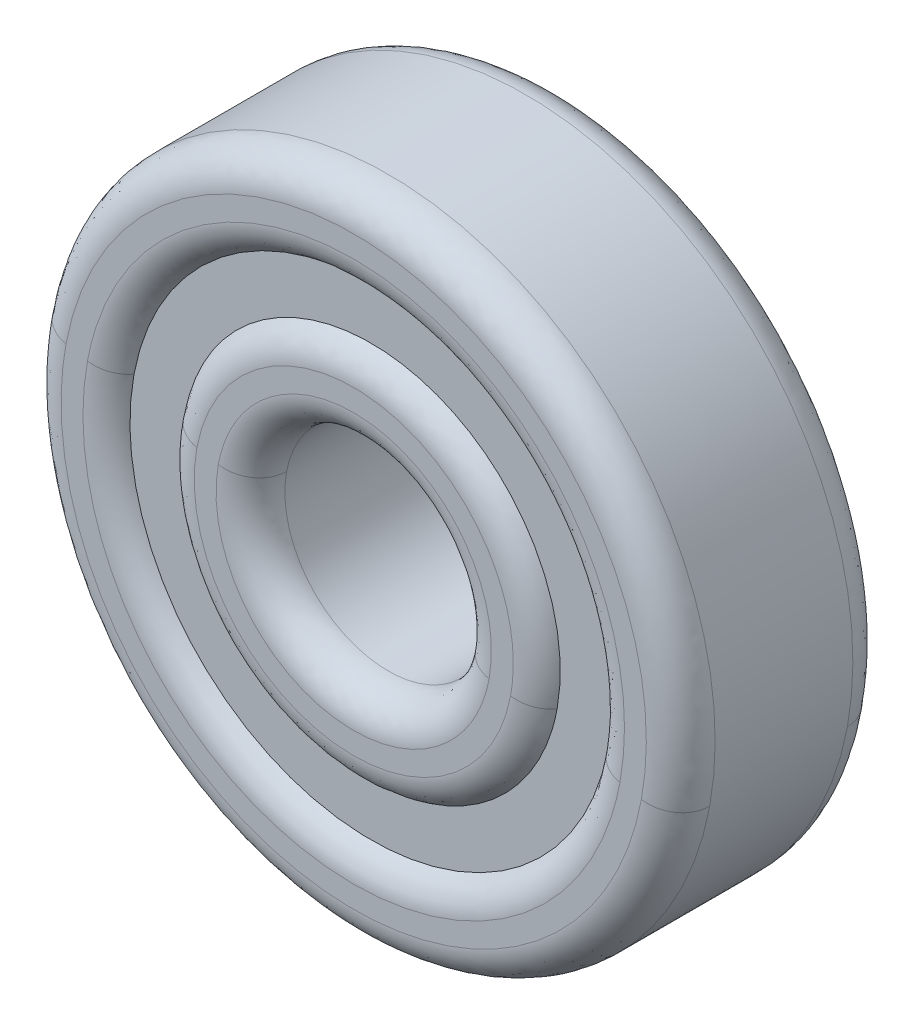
ISO-10303-21;
HEADER;
FILE_DESCRIPTION(('STEP AP214'),'2;1');
FILE_NAME('part.step','',(''),(''),'','','');
FILE_SCHEMA(('AUTOMOTIVE_DESIGN { 1 0 10303 214 1 1 1 1 }'));
ENDSEC;
DATA;
#1=APPLICATION_CONTEXT('core data for automotive mechanical design processes');
#2=APPLICATION_PROTOCOL_DEFINITION('international standard','automotive_design',2000,#1);
#3=PRODUCT_CONTEXT('',#1,'mechanical');
#4=PRODUCT('Part','Part','',(#3));
#5=PRODUCT_RELATED_PRODUCT_CATEGORY('part','',(#4));
#6=PRODUCT_DEFINITION_FORMATION('','',#4);
#7=PRODUCT_DEFINITION_CONTEXT('part definition',#1,'design');
#8=PRODUCT_DEFINITION('design','',#6,#7);
#9=PRODUCT_DEFINITION_SHAPE('','',#8);
#10=(LENGTH_UNIT() NAMED_UNIT(*) SI_UNIT(.MILLI.,.METRE.));
#11=(NAMED_UNIT(*) PLANE_ANGLE_UNIT() SI_UNIT($,.RADIAN.));
#12=(NAMED_UNIT(*) SI_UNIT($,.STERADIAN.) SOLID_ANGLE_UNIT());
#13=UNCERTAINTY_MEASURE_WITH_UNIT(LENGTH_MEASURE(1.E-05),#10,'distance_accuracy_value','');
#14=(GEOMETRIC_REPRESENTATION_CONTEXT(3) GLOBAL_UNCERTAINTY_ASSIGNED_CONTEXT((#13)) GLOBAL_UNIT_ASSIGNED_CONTEXT((#10,
#11,#12)) REPRESENTATION_CONTEXT('',''));
#15=CARTESIAN_POINT('',(0.,0.,0.));
#16=DIRECTION('',(0.,0.,1.));
#17=DIRECTION('',(1.,0.,0.));
#18=AXIS2_PLACEMENT_3D('',#15,#16,#17);
#19=CARTESIAN_POINT('',(-120.771053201,216.390301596,19.5));
#20=CARTESIAN_POINT('',(-118.765564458,227.205939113,19.5));
#21=CARTESIAN_POINT('',(-129.581201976,229.211427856,19.5));
#22=CARTESIAN_POINT('',(-131.586690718,218.395790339,19.5));
#23=CARTESIAN_POINT('',(-120.950998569,216.423667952,19.183012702));
#24=CARTESIAN_POINT('',(-119.012242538,226.879414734,19.183012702));
#25=CARTESIAN_POINT('',(-129.467989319,228.818170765,19.183012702));
#26=CARTESIAN_POINT('',(-131.406745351,218.362423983,19.183012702));
#27=CARTESIAN_POINT('',(-121.262673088,216.481460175,19.));
#28=CARTESIAN_POINT('',(-119.439501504,226.313857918,19.));
#29=CARTESIAN_POINT('',(-129.271899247,228.137029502,19.));
#30=CARTESIAN_POINT('',(-131.095070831,218.304631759,19.));
#31=CARTESIAN_POINT('',(-121.622563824,216.548192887,19.));
#32=CARTESIAN_POINT('',(-119.932857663,225.660809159,19.));
#33=CARTESIAN_POINT('',(-129.045473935,227.35051532,19.));
#34=CARTESIAN_POINT('',(-130.735180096,218.237899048,19.));
#35=(BOUNDED_SURFACE() B_SPLINE_SURFACE(3,3,((#19,#20,#21,#22),(#23,#24,#25,#26),(#27,#28,#29,
#30),(#31,#32,#33,#34)),.UNSPECIFIED.,.F.,.F.,.F.) B_SPLINE_SURFACE_WITH_KNOTS((4,4),(4,4),(0.,
1.),(0.,1.),.UNSPECIFIED.) GEOMETRIC_REPRESENTATION_ITEM() RATIONAL_B_SPLINE_SURFACE(((1.,
0.333333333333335,0.333333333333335,1.),(0.910683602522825,0.303561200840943,0.303561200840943,
0.910683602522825),(0.910683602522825,0.303561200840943,0.303561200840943,0.910683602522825),
(1.,0.333333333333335,0.333333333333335,1.))) REPRESENTATION_ITEM('') SURFACE());
#36=CARTESIAN_POINT('',(-120.771053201,216.390301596,19.5));
#37=CARTESIAN_POINT('',(-120.742834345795,216.542395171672,19.5));
#38=CARTESIAN_POINT('',(-120.721064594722,216.695682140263,19.5));
#39=CARTESIAN_POINT('',(-120.690506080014,217.003537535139,19.5));
#40=CARTESIAN_POINT('',(-120.681716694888,217.158105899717,19.5));
#41=CARTESIAN_POINT('',(-120.677200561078,217.467324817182,19.5));
#42=CARTESIAN_POINT('',(-120.681464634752,217.621975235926,19.5));
#43=CARTESIAN_POINT('',(-120.702999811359,217.930365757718,19.5));
#44=CARTESIAN_POINT('',(-120.72027075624,218.084105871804,19.5));
#45=CARTESIAN_POINT('',(-120.767704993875,218.389629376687,19.5));
#46=CARTESIAN_POINT('',(-120.797871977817,218.54141219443,19.5));
#47=CARTESIAN_POINT('',(-120.870897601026,218.841952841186,19.5));
#48=CARTESIAN_POINT('',(-120.913760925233,218.990709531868,19.5));
#49=CARTESIAN_POINT('',(-121.011842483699,219.283998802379,19.5));
#50=CARTESIAN_POINT('',(-121.067053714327,219.428533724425,19.5));
#51=CARTESIAN_POINT('',(-121.189475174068,219.712492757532,19.5));
#52=CARTESIAN_POINT('',(-121.25668982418,219.851914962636,19.5));
#53=CARTESIAN_POINT('',(-121.40260104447,220.124553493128,19.5));
#54=CARTESIAN_POINT('',(-121.48129362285,220.257771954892,19.5));
#55=CARTESIAN_POINT('',(-121.64965003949,220.517156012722,19.5));
#56=CARTESIAN_POINT('',(-121.739317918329,220.643318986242,19.5));
#57=CARTESIAN_POINT('',(-121.928943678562,220.887615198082,19.5));
#58=CARTESIAN_POINT('',(-122.028899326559,221.005750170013,19.5));
#59=CARTESIAN_POINT('',(-122.238445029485,221.233222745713,19.5));
#60=CARTESIAN_POINT('',(-122.348038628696,221.342557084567,19.5));
#61=CARTESIAN_POINT('',(-122.576001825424,221.551558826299,19.5));
#62=CARTESIAN_POINT('',(-122.694367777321,221.651230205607,19.5));
#63=CARTESIAN_POINT('',(-122.939119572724,221.840283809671,19.5));
#64=CARTESIAN_POINT('',(-123.06550836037,221.929662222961,19.5));
#65=CARTESIAN_POINT('',(-123.325311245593,222.097415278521,19.5));
#66=CARTESIAN_POINT('',(-123.458722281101,222.175794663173,19.5));
#67=CARTESIAN_POINT('',(-123.731722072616,222.321065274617,19.5));
#68=CARTESIAN_POINT('',(-123.871313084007,222.387952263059,19.5));
#69=CARTESIAN_POINT('',(-124.155586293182,222.509706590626,19.5));
#70=CARTESIAN_POINT('',(-124.300266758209,222.564577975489,19.5));
#71=CARTESIAN_POINT('',(-124.593786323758,222.661956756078,19.5));
#72=CARTESIAN_POINT('',(-124.742626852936,222.704459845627,19.5));
#73=CARTESIAN_POINT('',(-125.043337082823,222.776768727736,19.5));
#74=CARTESIAN_POINT('',(-125.195206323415,222.806576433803,19.5));
#75=CARTESIAN_POINT('',(-125.500916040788,222.853291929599,19.5));
#76=CARTESIAN_POINT('',(-125.654756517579,222.870199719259,19.5));
#77=CARTESIAN_POINT('',(-125.963340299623,222.890996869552,19.5));
#78=CARTESIAN_POINT('',(-126.118083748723,222.894884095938,19.5));
#79=CARTESIAN_POINT('',(-126.427294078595,222.88960742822,19.5));
#80=CARTESIAN_POINT('',(-126.581761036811,222.880448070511,19.5));
#81=CARTESIAN_POINT('',(-126.889429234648,222.849145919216,19.5));
#82=CARTESIAN_POINT('',(-127.042630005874,222.826998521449,19.5));
#83=CARTESIAN_POINT('',(-127.346564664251,222.769884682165,19.5));
#84=CARTESIAN_POINT('',(-127.497299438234,222.734922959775,19.5));
#85=CARTESIAN_POINT('',(-127.795347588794,222.652411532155,19.5));
#86=CARTESIAN_POINT('',(-127.942659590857,222.604856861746,19.5));
#87=CARTESIAN_POINT('',(-128.232699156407,222.497523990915,19.5));
#88=CARTESIAN_POINT('',(-128.375428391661,222.43775030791,19.5));
#89=CARTESIAN_POINT('',(-128.655389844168,222.30637237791,19.5));
#90=CARTESIAN_POINT('',(-128.792620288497,222.234764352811,19.5));
#91=CARTESIAN_POINT('',(-129.060510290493,222.0802690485,19.5));
#92=CARTESIAN_POINT('',(-129.19117225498,221.997385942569,19.5));
#93=CARTESIAN_POINT('',(-129.44508095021,221.820888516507,19.5));
#94=CARTESIAN_POINT('',(-129.568325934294,221.727271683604,19.5));
#95=CARTESIAN_POINT('',(-129.806447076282,221.53002457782,19.5));
#96=CARTESIAN_POINT('',(-129.921326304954,221.42639801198,19.5));
#97=CARTESIAN_POINT('',(-130.142025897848,221.209764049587,19.5));
#98=CARTESIAN_POINT('',(-130.247839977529,221.096750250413,19.5));
#99=CARTESIAN_POINT('',(-130.449530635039,220.862250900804,19.5));
#100=CARTESIAN_POINT('',(-130.545410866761,220.740768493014,19.5));
#101=CARTESIAN_POINT('',(-130.726685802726,220.490035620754,19.5));
#102=CARTESIAN_POINT('',(-130.812070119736,220.360777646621,19.5));
#103=CARTESIAN_POINT('',(-130.971605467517,220.095571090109,19.5));
#104=CARTESIAN_POINT('',(-131.045760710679,219.959625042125,19.5));
#105=CARTESIAN_POINT('',(-131.182272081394,219.682123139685,19.5));
#106=CARTESIAN_POINT('',(-131.244641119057,219.540573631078,19.5));
#107=CARTESIAN_POINT('',(-131.357215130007,219.252782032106,19.5));
#108=CARTESIAN_POINT('',(-131.407426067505,219.106542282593,19.5));
#109=CARTESIAN_POINT('',(-131.478879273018,218.865885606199,19.5));
#110=CARTESIAN_POINT('',(-131.50392678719,218.772580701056,19.5));
#111=CARTESIAN_POINT('',(-131.549038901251,218.584937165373,19.5));
#112=CARTESIAN_POINT('',(-131.569111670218,218.490600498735,19.5));
#113=CARTESIAN_POINT('',(-131.586690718,218.395790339,19.5));
#114=B_SPLINE_CURVE_WITH_KNOTS('',3,(#36,#37,#38,#39,#40,#41,#42,#43,#44,#45,#46,#47,#48,#49,
#50,#51,#52,#53,#54,#55,#56,#57,#58,#59,#60,#61,#62,#63,#64,#65,#66,#67,#68,#69,#70,#71,#72,#73,
#74,#75,#76,#77,#78,#79,#80,#81,#82,#83,#84,#85,#86,#87,#88,#89,#90,#91,#92,#93,#94,#95,#96,#97,
#98,#99,#100,#101,#102,#103,#104,#105,#106,#107,#108,#109,#110,#111,#112,#113),.UNSPECIFIED.,
.F.,.F.,(4,2,2,2,2,2,2,2,2,2,2,2,2,2,2,2,2,2,2,2,2,2,2,2,2,2,2,2,2,2,2,2,2,2,2,2,2,2,4),(0.,
0.463926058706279,0.927829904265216,1.39140766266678,1.85497978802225,2.31868468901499,
2.78256091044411,3.24617468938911,3.70995957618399,4.17358355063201,4.63737872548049,
5.10107342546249,5.56493936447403,6.0286135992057,6.49245898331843,6.9561037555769,
7.4199191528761,7.88357813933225,8.34739836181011,8.81114865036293,9.27489894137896,
9.73872524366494,10.2023903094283,10.6662198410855,11.1298787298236,11.5937207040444,
12.0573915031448,12.521210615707,12.9848585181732,13.4486151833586,13.912200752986,
14.3761051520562,14.8398383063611,15.3040267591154,15.7680406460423,16.2315432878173,
16.6948180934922,16.9845201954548,17.2737433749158),.UNSPECIFIED.);
#115=CARTESIAN_POINT('',(-120.771053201,216.390301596,19.5));
#116=VERTEX_POINT('',#115);
#117=CARTESIAN_POINT('',(-131.586690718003,218.395790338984,19.5));
#118=VERTEX_POINT('',#117);
#119=EDGE_CURVE('E21',#116,#118,#114,.T.);
#120=CARTESIAN_POINT('',(-120.771053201,216.390301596,19.5));
#121=CARTESIAN_POINT('',(-120.950998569,216.423667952,19.183012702));
#122=CARTESIAN_POINT('',(-121.262673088,216.481460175,19.));
#123=CARTESIAN_POINT('',(-121.622563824,216.548192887,19.));
#124=(BOUNDED_CURVE() B_SPLINE_CURVE(3,(#120,#121,#122,#123),.UNSPECIFIED.,.F.,
.F.) B_SPLINE_CURVE_WITH_KNOTS((4,4),(0.,1.),
.UNSPECIFIED.) CURVE() GEOMETRIC_REPRESENTATION_ITEM() RATIONAL_B_SPLINE_CURVE((1.,
0.910683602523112,0.910683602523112,1.)) REPRESENTATION_ITEM(''));
#125=CARTESIAN_POINT('',(-121.622563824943,216.548192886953,19.));
#126=VERTEX_POINT('',#125);
#127=EDGE_CURVE('E142',#126,#116,#124,.F.);
#128=CARTESIAN_POINT('',(-121.622563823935,216.548192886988,19.));
#129=CARTESIAN_POINT('',(-119.932857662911,225.660809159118,19.));
#130=CARTESIAN_POINT('',(-129.045473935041,227.350515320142,19.));
#131=CARTESIAN_POINT('',(-130.735180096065,218.237899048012,19.));
#132=(BOUNDED_CURVE() B_SPLINE_CURVE(3,(#128,#129,#130,#131),.UNSPECIFIED.,.F.,
.F.) B_SPLINE_CURVE_WITH_KNOTS((4,4),(0.,1.),
.UNSPECIFIED.) CURVE() GEOMETRIC_REPRESENTATION_ITEM() RATIONAL_B_SPLINE_CURVE((0.999999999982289,
0.333333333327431,0.333333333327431,0.999999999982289)) REPRESENTATION_ITEM(''));
#133=CARTESIAN_POINT('',(-130.735180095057,218.237899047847,19.));
#134=VERTEX_POINT('',#133);
#135=EDGE_CURVE('E137',#134,#126,#132,.F.);
#136=CARTESIAN_POINT('',(-131.586690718,218.395790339,19.5));
#137=CARTESIAN_POINT('',(-131.406745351,218.362423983,19.183012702));
#138=CARTESIAN_POINT('',(-131.095070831,218.304631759,19.));
#139=CARTESIAN_POINT('',(-130.735180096,218.237899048,19.));
#140=(BOUNDED_CURVE() B_SPLINE_CURVE(3,(#136,#137,#138,#139),.UNSPECIFIED.,.F.,
.F.) B_SPLINE_CURVE_WITH_KNOTS((4,4),(0.,1.),
.UNSPECIFIED.) CURVE() GEOMETRIC_REPRESENTATION_ITEM() RATIONAL_B_SPLINE_CURVE((1.,
0.910683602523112,0.910683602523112,1.)) REPRESENTATION_ITEM(''));
#141=EDGE_CURVE('E134',#118,#134,#140,.T.);
#142=ORIENTED_EDGE('',*,*,#119,.F.);
#143=ORIENTED_EDGE('',*,*,#127,.F.);
#144=ORIENTED_EDGE('',*,*,#135,.F.);
#145=ORIENTED_EDGE('',*,*,#141,.F.);
#146=EDGE_LOOP('',(#142,#143,#144,#145));
#147=FACE_BOUND('',#146,.T.);
#148=ADVANCED_FACE('F16',(#147),#35,.T.);
#149=CARTESIAN_POINT('',(-131.586690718,218.395790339,19.5));
#150=CARTESIAN_POINT('',(-133.592179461,207.580152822,19.5));
#151=CARTESIAN_POINT('',(-122.776541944,205.574664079,19.5));
#152=CARTESIAN_POINT('',(-120.771053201,216.390301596,19.5));
#153=CARTESIAN_POINT('',(-131.406745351,218.362423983,19.183012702));
#154=CARTESIAN_POINT('',(-133.345501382,207.906677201,19.183012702));
#155=CARTESIAN_POINT('',(-122.8897546,205.96792117,19.183012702));
#156=CARTESIAN_POINT('',(-120.950998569,216.423667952,19.183012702));
#157=CARTESIAN_POINT('',(-131.095070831,218.304631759,19.));
#158=CARTESIAN_POINT('',(-132.918242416,208.472234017,19.));
#159=CARTESIAN_POINT('',(-123.085844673,206.649062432,19.));
#160=CARTESIAN_POINT('',(-121.262673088,216.481460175,19.));
#161=CARTESIAN_POINT('',(-130.735180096,218.237899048,19.));
#162=CARTESIAN_POINT('',(-132.424886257,209.125282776,19.));
#163=CARTESIAN_POINT('',(-123.312269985,207.435576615,19.));
#164=CARTESIAN_POINT('',(-121.622563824,216.548192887,19.));
#165=(BOUNDED_SURFACE() B_SPLINE_SURFACE(3,3,((#149,#150,#151,#152),(#153,#154,#155,#156),(#157,
#158,#159,#160),(#161,#162,#163,#164)),.UNSPECIFIED.,.F.,.F.,
.F.) B_SPLINE_SURFACE_WITH_KNOTS((4,4),(4,4),(0.,1.),(0.,1.),
.UNSPECIFIED.) GEOMETRIC_REPRESENTATION_ITEM() RATIONAL_B_SPLINE_SURFACE(((1.,0.333333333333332,
0.333333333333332,1.),(0.910683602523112,0.303561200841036,0.303561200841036,0.910683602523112),
(0.910683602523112,0.303561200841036,0.303561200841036,0.910683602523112),(1.,0.333333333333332,
0.333333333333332,1.))) REPRESENTATION_ITEM('') SURFACE());
#166=CARTESIAN_POINT('',(-131.586690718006,218.395790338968,19.5));
#167=CARTESIAN_POINT('',(-131.614909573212,218.243696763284,19.5));
#168=CARTESIAN_POINT('',(-131.636679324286,218.090409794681,19.5));
#169=CARTESIAN_POINT('',(-131.667237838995,217.78255439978,19.5));
#170=CARTESIAN_POINT('',(-131.676027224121,217.62798603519,19.5));
#171=CARTESIAN_POINT('',(-131.68054335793,217.3187671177,19.5));
#172=CARTESIAN_POINT('',(-131.676279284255,217.164116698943,19.5));
#173=CARTESIAN_POINT('',(-131.654744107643,216.855726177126,19.5));
#174=CARTESIAN_POINT('',(-131.637473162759,216.701986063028,19.5));
#175=CARTESIAN_POINT('',(-131.590038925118,216.39646255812,19.5));
#176=CARTESIAN_POINT('',(-131.559871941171,216.244679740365,19.5));
#177=CARTESIAN_POINT('',(-131.486846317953,215.944139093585,19.5));
#178=CARTESIAN_POINT('',(-131.443982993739,215.795382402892,19.5));
#179=CARTESIAN_POINT('',(-131.34590143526,215.502093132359,19.5));
#180=CARTESIAN_POINT('',(-131.290690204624,215.357558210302,19.5));
#181=CARTESIAN_POINT('',(-131.168268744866,215.073599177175,19.5));
#182=CARTESIAN_POINT('',(-131.101054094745,214.934176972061,19.5));
#183=CARTESIAN_POINT('',(-130.955142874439,214.661538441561,19.5));
#184=CARTESIAN_POINT('',(-130.876450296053,214.528319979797,19.5));
#185=CARTESIAN_POINT('',(-130.708093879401,214.268935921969,19.5));
#186=CARTESIAN_POINT('',(-130.618426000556,214.14277294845,19.5));
#187=CARTESIAN_POINT('',(-130.42880024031,213.898476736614,19.5));
#188=CARTESIAN_POINT('',(-130.328844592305,213.780341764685,19.5));
#189=CARTESIAN_POINT('',(-130.119298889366,213.552869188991,19.5));
#190=CARTESIAN_POINT('',(-130.009705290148,213.44353485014,19.5));
#191=CARTESIAN_POINT('',(-129.781742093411,213.234533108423,19.5));
#192=CARTESIAN_POINT('',(-129.663376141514,213.134861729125,19.5));
#193=CARTESIAN_POINT('',(-129.418624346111,212.945808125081,19.5));
#194=CARTESIAN_POINT('',(-129.292235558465,212.856429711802,19.5));
#195=CARTESIAN_POINT('',(-129.032432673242,212.688676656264,19.5));
#196=CARTESIAN_POINT('',(-128.899021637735,212.610297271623,19.5));
#197=CARTESIAN_POINT('',(-128.626021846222,212.4650266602,19.5));
#198=CARTESIAN_POINT('',(-128.486430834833,212.39813967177,19.5));
#199=CARTESIAN_POINT('',(-128.202157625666,212.276385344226,19.5));
#200=CARTESIAN_POINT('',(-128.057477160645,212.221513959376,19.5));
#201=CARTESIAN_POINT('',(-127.763957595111,212.124135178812,19.5));
#202=CARTESIAN_POINT('',(-127.615117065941,212.081632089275,19.5));
#203=CARTESIAN_POINT('',(-127.31440683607,212.009323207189,19.5));
#204=CARTESIAN_POINT('',(-127.162537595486,211.979515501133,19.5));
#205=CARTESIAN_POINT('',(-126.856827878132,211.93280000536,19.5));
#206=CARTESIAN_POINT('',(-126.702987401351,211.91589221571,19.5));
#207=CARTESIAN_POINT('',(-126.394403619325,211.895095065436,19.5));
#208=CARTESIAN_POINT('',(-126.239660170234,211.891207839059,19.5));
#209=CARTESIAN_POINT('',(-125.93044984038,211.896484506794,19.5));
#210=CARTESIAN_POINT('',(-125.775982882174,211.90564386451,19.5));
#211=CARTESIAN_POINT('',(-125.468314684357,211.936946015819,19.5));
#212=CARTESIAN_POINT('',(-125.315113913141,211.959093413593,19.5));
#213=CARTESIAN_POINT('',(-125.011179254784,212.016207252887,19.5));
#214=CARTESIAN_POINT('',(-124.860444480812,212.051168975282,19.5));
#215=CARTESIAN_POINT('',(-124.562396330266,212.133680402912,19.5));
#216=CARTESIAN_POINT('',(-124.415084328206,212.181235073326,19.5));
#217=CARTESIAN_POINT('',(-124.125044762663,212.288567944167,19.5));
#218=CARTESIAN_POINT('',(-123.982315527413,212.348341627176,19.5));
#219=CARTESIAN_POINT('',(-123.702354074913,212.479719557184,19.5));
#220=CARTESIAN_POINT('',(-123.565123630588,212.551327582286,19.5));
#221=CARTESIAN_POINT('',(-123.297233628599,212.705822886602,19.5));
#222=CARTESIAN_POINT('',(-123.166571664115,212.788705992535,19.5));
#223=CARTESIAN_POINT('',(-122.912662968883,212.965203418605,19.5));
#224=CARTESIAN_POINT('',(-122.789417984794,213.058820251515,19.5));
#225=CARTESIAN_POINT('',(-122.551296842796,213.256067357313,19.5));
#226=CARTESIAN_POINT('',(-122.436417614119,213.35969392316,19.5));
#227=CARTESIAN_POINT('',(-122.215718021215,213.576327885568,19.5));
#228=CARTESIAN_POINT('',(-122.10990394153,213.689341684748,19.5));
#229=CARTESIAN_POINT('',(-121.90821328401,213.923841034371,19.5));
#230=CARTESIAN_POINT('',(-121.812333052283,214.045323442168,19.5));
#231=CARTESIAN_POINT('',(-121.631058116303,214.296056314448,19.5));
#232=CARTESIAN_POINT('',(-121.545673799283,214.425314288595,19.5));
#233=CARTESIAN_POINT('',(-121.386138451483,214.690520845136,19.5));
#234=CARTESIAN_POINT('',(-121.311983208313,214.826466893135,19.5));
#235=CARTESIAN_POINT('',(-121.175471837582,215.103968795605,19.5));
#236=CARTESIAN_POINT('',(-121.113102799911,215.245518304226,19.5));
#237=CARTESIAN_POINT('',(-121.000528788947,215.53330990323,19.5));
#238=CARTESIAN_POINT('',(-120.950317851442,215.679549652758,19.5));
#239=CARTESIAN_POINT('',(-120.87886464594,215.920206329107,19.5));
#240=CARTESIAN_POINT('',(-120.853817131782,216.013511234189,19.5));
#241=CARTESIAN_POINT('',(-120.80870501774,216.201154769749,19.5));
#242=CARTESIAN_POINT('',(-120.78863224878,216.295491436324,19.5));
#243=CARTESIAN_POINT('',(-120.771053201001,216.390301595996,19.5));
#244=B_SPLINE_CURVE_WITH_KNOTS('',3,(#166,#167,#168,#169,#170,#171,#172,#173,#174,#175,#176,
#177,#178,#179,#180,#181,#182,#183,#184,#185,#186,#187,#188,#189,#190,#191,#192,#193,#194,#195,
#196,#197,#198,#199,#200,#201,#202,#203,#204,#205,#206,#207,#208,#209,#210,#211,#212,#213,#214,
#215,#216,#217,#218,#219,#220,#221,#222,#223,#224,#225,#226,#227,#228,#229,#230,#231,#232,#233,
#234,#235,#236,#237,#238,#239,#240,#241,#242,#243),.UNSPECIFIED.,.F.,.F.,(4,2,2,2,2,2,2,2,2,2,2,
2,2,2,2,2,2,2,2,2,2,2,2,2,2,2,2,2,2,2,2,2,2,2,2,2,2,2,4),(0.,0.463926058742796,
0.927829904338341,1.39140766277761,1.85497978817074,2.31868468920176,2.78256091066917,
3.24617468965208,3.70995957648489,4.17358355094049,4.63737872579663,5.10107342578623,
5.56493936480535,6.02861359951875,6.49245898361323,6.95610375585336,7.41991915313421,
7.8835781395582,8.34739836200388,8.81114865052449,9.27489894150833,9.73872524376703,
10.2023903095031,10.666219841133,11.129878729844,11.5937207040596,12.0573915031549,
12.5212106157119,12.9848585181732,13.4486151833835,13.9122007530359,14.3761051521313,
14.8398383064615,15.3040267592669,15.7680406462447,16.2315432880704,16.6948180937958,
16.9845201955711,17.2737433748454),.UNSPECIFIED.);
#245=EDGE_CURVE('E145',#118,#116,#244,.T.);
#246=CARTESIAN_POINT('',(-130.735180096,218.237899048,19.));
#247=CARTESIAN_POINT('',(-132.424886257,209.125282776,19.));
#248=CARTESIAN_POINT('',(-123.312269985,207.435576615,19.));
#249=CARTESIAN_POINT('',(-121.622563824,216.548192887,19.));
#250=(BOUNDED_CURVE() B_SPLINE_CURVE(3,(#246,#247,#248,#249),.UNSPECIFIED.,.F.,
.F.) B_SPLINE_CURVE_WITH_KNOTS((4,4),(0.,1.),
.UNSPECIFIED.) CURVE() GEOMETRIC_REPRESENTATION_ITEM() RATIONAL_B_SPLINE_CURVE((0.999999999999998,
0.333333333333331,0.333333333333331,0.999999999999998)) REPRESENTATION_ITEM(''));
#251=EDGE_CURVE('E289',#126,#134,#250,.F.);
#252=ORIENTED_EDGE('',*,*,#127,.T.);
#253=ORIENTED_EDGE('',*,*,#245,.F.);
#254=ORIENTED_EDGE('',*,*,#141,.T.);
#255=ORIENTED_EDGE('',*,*,#251,.F.);
#256=EDGE_LOOP('',(#252,#253,#254,#255));
#257=FACE_BOUND('',#256,.T.);
#258=ADVANCED_FACE('F146',(#257),#165,.T.);
#259=CARTESIAN_POINT('',(-120.505136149,209.136240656,19.5));
#260=DIRECTION('',(0.,0.,-1.));
#261=DIRECTION('',(-0.98323977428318,0.182317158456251,0.));
#262=AXIS2_PLACEMENT_3D('',#259,#260,#261);
#263=PLANE('',#262);
#264=ORIENTED_EDGE('',*,*,#119,.T.);
#265=ORIENTED_EDGE('',*,*,#245,.T.);
#266=EDGE_LOOP('',(#264,#265));
#267=FACE_BOUND('',#266,.T.);
#268=CARTESIAN_POINT('',(-119.296193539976,216.116825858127,19.5));
#269=CARTESIAN_POINT('',(-119.265355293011,216.283080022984,19.5));
#270=CARTESIAN_POINT('',(-119.240562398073,216.450450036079,19.5));
#271=CARTESIAN_POINT('',(-119.203149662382,216.786539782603,19.5));
#272=CARTESIAN_POINT('',(-119.190529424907,216.955259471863,19.5));
#273=CARTESIAN_POINT('',(-119.177547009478,217.29305587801,19.5));
#274=CARTESIAN_POINT('',(-119.177176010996,217.46213225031,19.5));
#275=CARTESIAN_POINT('',(-119.188658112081,217.799838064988,19.5));
#276=CARTESIAN_POINT('',(-119.200511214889,217.968467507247,19.5));
#277=CARTESIAN_POINT('',(-119.25435580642,218.472430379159,19.5));
#278=CARTESIAN_POINT('',(-119.31462686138,218.805989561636,19.5));
#279=CARTESIAN_POINT('',(-119.482752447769,219.460980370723,19.5));
#280=CARTESIAN_POINT('',(-119.59062181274,219.782408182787,19.5));
#281=CARTESIAN_POINT('',(-119.796956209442,220.275744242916,19.5));
#282=CARTESIAN_POINT('',(-119.880525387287,220.454020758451,19.5));
#283=CARTESIAN_POINT('',(-120.062401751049,220.802953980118,19.5));
#284=CARTESIAN_POINT('',(-120.160710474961,220.973609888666,19.5));
#285=CARTESIAN_POINT('',(-120.371372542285,221.306062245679,19.5));
#286=CARTESIAN_POINT('',(-120.483728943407,221.467856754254,19.5));
#287=CARTESIAN_POINT('',(-120.721716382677,221.781463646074,19.5));
#288=CARTESIAN_POINT('',(-120.847352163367,221.933272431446,19.5));
#289=CARTESIAN_POINT('',(-121.110900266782,222.225683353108,19.5));
#290=CARTESIAN_POINT('',(-121.248806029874,222.366291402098,19.5));
#291=CARTESIAN_POINT('',(-121.536024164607,222.635441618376,19.5));
#292=CARTESIAN_POINT('',(-121.685340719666,222.763979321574,19.5));
#293=CARTESIAN_POINT('',(-121.994199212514,223.007956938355,19.5));
#294=CARTESIAN_POINT('',(-122.153736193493,223.12340312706,19.5));
#295=CARTESIAN_POINT('',(-122.482027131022,223.340488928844,19.5));
#296=CARTESIAN_POINT('',(-122.650784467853,223.442123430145,19.5));
#297=CARTESIAN_POINT('',(-122.996205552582,223.630781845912,19.5));
#298=CARTESIAN_POINT('',(-123.172866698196,223.717810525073,19.5));
#299=CARTESIAN_POINT('',(-123.532957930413,223.876708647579,19.5));
#300=CARTESIAN_POINT('',(-123.716390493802,223.948572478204,19.5));
#301=CARTESIAN_POINT('',(-124.088594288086,224.076567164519,19.5));
#302=CARTESIAN_POINT('',(-124.277363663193,224.132703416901,19.5));
#303=CARTESIAN_POINT('',(-124.659031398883,224.228894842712,19.5));
#304=CARTESIAN_POINT('',(-124.851931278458,224.268943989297,19.5));
#305=CARTESIAN_POINT('',(-125.240337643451,224.332632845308,19.5));
#306=CARTESIAN_POINT('',(-125.435842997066,224.356279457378,19.5));
#307=CARTESIAN_POINT('',(-125.828239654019,224.387029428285,19.5));
#308=CARTESIAN_POINT('',(-126.025131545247,224.394125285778,19.5));
#309=CARTESIAN_POINT('',(-126.418810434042,224.391701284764,19.5));
#310=CARTESIAN_POINT('',(-126.615597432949,224.38218164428,19.5));
#311=CARTESIAN_POINT('',(-127.007580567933,224.346602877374,19.5));
#312=CARTESIAN_POINT('',(-127.202777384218,224.320551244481,19.5));
#313=CARTESIAN_POINT('',(-127.590364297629,224.252086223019,19.5));
#314=CARTESIAN_POINT('',(-127.782753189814,224.209666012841,19.5));
#315=CARTESIAN_POINT('',(-128.163201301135,224.108785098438,19.5));
#316=CARTESIAN_POINT('',(-128.351262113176,224.050330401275,19.5));
#317=CARTESIAN_POINT('',(-128.721862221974,223.917763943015,19.5));
#318=CARTESIAN_POINT('',(-128.904399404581,223.843646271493,19.5));
#319=CARTESIAN_POINT('',(-129.262513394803,223.680324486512,19.5));
#320=CARTESIAN_POINT('',(-129.438092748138,223.591125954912,19.5));
#321=CARTESIAN_POINT('',(-129.781170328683,223.398225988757,19.5));
#322=CARTESIAN_POINT('',(-129.948665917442,223.294519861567,19.5));
#323=CARTESIAN_POINT('',(-130.274263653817,223.073405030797,19.5));
#324=CARTESIAN_POINT('',(-130.432369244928,222.956001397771,19.5));
#325=CARTESIAN_POINT('',(-130.738199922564,222.708238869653,19.5));
#326=CARTESIAN_POINT('',(-130.885920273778,222.577874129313,19.5));
#327=CARTESIAN_POINT('',(-131.169798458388,222.305211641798,19.5));
#328=CARTESIAN_POINT('',(-131.30596053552,222.162918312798,19.5));
#329=CARTESIAN_POINT('',(-131.565901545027,221.867270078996,19.5));
#330=CARTESIAN_POINT('',(-131.689672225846,221.713907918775,19.5));
#331=CARTESIAN_POINT('',(-131.923803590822,221.397356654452,19.5));
#332=CARTESIAN_POINT('',(-132.03416917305,221.234171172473,19.5));
#333=CARTESIAN_POINT('',(-132.240724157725,220.89913451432,19.5));
#334=CARTESIAN_POINT('',(-132.336918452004,220.727286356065,19.5));
#335=CARTESIAN_POINT('',(-132.514461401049,220.376167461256,19.5));
#336=CARTESIAN_POINT('',(-132.595814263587,220.196898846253,19.5));
#337=CARTESIAN_POINT('',(-132.75715472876,219.797408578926,19.5));
#338=CARTESIAN_POINT('',(-132.833944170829,219.575879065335,19.5));
#339=CARTESIAN_POINT('',(-132.932121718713,219.238933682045,19.5));
#340=CARTESIAN_POINT('',(-132.961998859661,219.125920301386,19.5));
#341=CARTESIAN_POINT('',(-133.016058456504,218.898545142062,19.5));
#342=CARTESIAN_POINT('',(-133.040241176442,218.784183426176,19.5));
#343=CARTESIAN_POINT('',(-133.061550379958,218.669266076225,19.5));
#344=B_SPLINE_CURVE_WITH_KNOTS('',3,(#268,#269,#270,#271,#272,#273,#274,#275,#276,#277,#278,
#279,#280,#281,#282,#283,#284,#285,#286,#287,#288,#289,#290,#291,#292,#293,#294,#295,#296,#297,
#298,#299,#300,#301,#302,#303,#304,#305,#306,#307,#308,#309,#310,#311,#312,#313,#314,#315,#316,
#317,#318,#319,#320,#321,#322,#323,#324,#325,#326,#327,#328,#329,#330,#331,#332,#333,#334,#335,
#336,#337,#338,#339,#340,#341,#342,#343),.UNSPECIFIED.,.F.,.F.,(4,2,2,2,2,2,2,2,2,2,2,2,2,2,2,2,
2,2,2,2,2,2,2,2,2,2,2,2,2,2,2,2,2,2,2,2,2,4),(0.,0.507149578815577,1.01428262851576,
1.52105048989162,2.02781848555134,3.04090480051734,4.05430705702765,4.64436447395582,
5.2344835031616,5.82473120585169,6.41519042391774,7.00533585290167,7.59569868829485,
8.18577733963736,8.77607379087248,9.36617730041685,9.95649883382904,10.5466175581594,
11.1369571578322,11.7270481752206,12.3174065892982,12.9077572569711,13.4978405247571,
14.0881699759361,14.678278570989,15.2686102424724,15.8587238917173,16.4490288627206,
17.0391160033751,17.6294704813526,18.2196072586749,18.8101344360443,19.4004451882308,
19.9905516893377,20.5804906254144,21.2825530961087,21.6331169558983,21.9836645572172),.UNSPECIFIED.);
#345=CARTESIAN_POINT('',(-119.296193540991,216.116825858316,19.5000000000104));
#346=VERTEX_POINT('',#345);
#347=CARTESIAN_POINT('',(-133.061550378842,218.669266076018,19.5000000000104));
#348=VERTEX_POINT('',#347);
#349=EDGE_CURVE('E235',#346,#348,#344,.T.);
#350=ORIENTED_EDGE('',*,*,#349,.F.);
#351=CARTESIAN_POINT('',(-133.061550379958,218.669266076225,19.5));
#352=CARTESIAN_POINT('',(-133.092388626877,218.503011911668,19.5));
#353=CARTESIAN_POINT('',(-133.117181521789,218.335641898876,19.5));
#354=CARTESIAN_POINT('',(-133.154594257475,217.999552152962,19.5));
#355=CARTESIAN_POINT('',(-133.167214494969,217.830832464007,19.5));
#356=CARTESIAN_POINT('',(-133.180196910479,217.49303605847,19.5));
#357=CARTESIAN_POINT('',(-133.180567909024,217.323959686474,19.5));
#358=CARTESIAN_POINT('',(-133.169085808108,216.986253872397,19.5));
#359=CARTESIAN_POINT('',(-133.157232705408,216.817624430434,19.5));
#360=CARTESIAN_POINT('',(-133.10338811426,216.313661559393,19.5));
#361=CARTESIAN_POINT('',(-133.043117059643,215.980102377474,19.5));
#362=CARTESIAN_POINT('',(-132.874991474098,215.32511156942,19.5));
#363=CARTESIAN_POINT('',(-132.767122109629,215.00368375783,19.5));
#364=CARTESIAN_POINT('',(-132.560787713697,214.510347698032,19.5));
#365=CARTESIAN_POINT('',(-132.477218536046,214.332071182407,19.5));
#366=CARTESIAN_POINT('',(-132.295342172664,213.983137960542,19.5));
#367=CARTESIAN_POINT('',(-132.197033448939,213.812482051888,19.5));
#368=CARTESIAN_POINT('',(-131.986371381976,213.480029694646,19.5));
#369=CARTESIAN_POINT('',(-131.87401498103,213.318235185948,19.5));
#370=CARTESIAN_POINT('',(-131.636027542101,213.004628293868,19.5));
#371=CARTESIAN_POINT('',(-131.510391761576,212.852819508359,19.5));
#372=CARTESIAN_POINT('',(-131.24684365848,212.56040858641,19.5));
#373=CARTESIAN_POINT('',(-131.108937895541,212.419800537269,19.5));
#374=CARTESIAN_POINT('',(-130.821719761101,212.150650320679,19.5));
#375=CARTESIAN_POINT('',(-130.672403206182,212.022112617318,19.5));
#376=CARTESIAN_POINT('',(-130.363544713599,211.778135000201,19.5));
#377=CARTESIAN_POINT('',(-130.204007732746,211.662688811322,19.5));
#378=CARTESIAN_POINT('',(-129.875716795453,211.445603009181,19.5));
#379=CARTESIAN_POINT('',(-129.706959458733,211.343968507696,19.5));
#380=CARTESIAN_POINT('',(-129.36153837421,211.155310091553,19.5));
#381=CARTESIAN_POINT('',(-129.18487722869,211.0682814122,19.5));
#382=CARTESIAN_POINT('',(-128.824785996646,210.909383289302,19.5));
#383=CARTESIAN_POINT('',(-128.641353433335,210.837519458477,19.5));
#384=CARTESIAN_POINT('',(-128.269149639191,210.709524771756,19.5));
#385=CARTESIAN_POINT('',(-128.080380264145,210.65338851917,19.5));
#386=CARTESIAN_POINT('',(-127.698712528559,210.557197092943,19.5));
#387=CARTESIAN_POINT('',(-127.505812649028,210.517147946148,19.5));
#388=CARTESIAN_POINT('',(-127.117406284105,210.453459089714,19.5));
#389=CARTESIAN_POINT('',(-126.921900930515,210.429812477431,19.5));
#390=CARTESIAN_POINT('',(-126.529504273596,210.399062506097,19.5));
#391=CARTESIAN_POINT('',(-126.332612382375,210.39196664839,19.5));
#392=CARTESIAN_POINT('',(-125.938933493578,210.394390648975,19.5));
#393=CARTESIAN_POINT('',(-125.74214649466,210.403910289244,19.5));
#394=CARTESIAN_POINT('',(-125.350163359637,210.439489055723,19.5));
#395=CARTESIAN_POINT('',(-125.154966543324,210.465540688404,19.5));
#396=CARTESIAN_POINT('',(-124.767379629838,210.534005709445,19.5));
#397=CARTESIAN_POINT('',(-124.574990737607,210.576425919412,19.5));
#398=CARTESIAN_POINT('',(-124.194542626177,210.677306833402,19.5));
#399=CARTESIAN_POINT('',(-124.006481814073,210.73576153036,19.5));
#400=CARTESIAN_POINT('',(-123.63588170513,210.868327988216,19.5));
#401=CARTESIAN_POINT('',(-123.453344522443,210.94244565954,19.5));
#402=CARTESIAN_POINT('',(-123.095230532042,211.105767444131,19.5));
#403=CARTESIAN_POINT('',(-122.91965117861,211.194965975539,19.5));
#404=CARTESIAN_POINT('',(-122.576573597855,211.387865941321,19.5));
#405=CARTESIAN_POINT('',(-122.409078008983,211.491572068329,19.5));
#406=CARTESIAN_POINT('',(-122.083480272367,211.712686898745,19.5));
#407=CARTESIAN_POINT('',(-121.925374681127,211.830090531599,19.5));
#408=CARTESIAN_POINT('',(-121.619544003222,212.077853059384,19.5));
#409=CARTESIAN_POINT('',(-121.471823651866,212.208217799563,19.5));
#410=CARTESIAN_POINT('',(-121.18794546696,212.480880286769,19.5));
#411=CARTESIAN_POINT('',(-121.051783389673,212.623173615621,19.5));
#412=CARTESIAN_POINT('',(-120.791842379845,212.918821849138,19.5));
#413=CARTESIAN_POINT('',(-120.668071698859,213.072184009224,19.5));
#414=CARTESIAN_POINT('',(-120.433940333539,213.388735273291,19.5));
#415=CARTESIAN_POINT('',(-120.323574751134,213.551920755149,19.5));
#416=CARTESIAN_POINT('',(-120.117019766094,213.886957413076,19.5));
#417=CARTESIAN_POINT('',(-120.020825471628,214.058805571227,19.5));
#418=CARTESIAN_POINT('',(-119.8432825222,214.409924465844,19.5));
#419=CARTESIAN_POINT('',(-119.761929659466,214.589193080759,19.5));
#420=CARTESIAN_POINT('',(-119.600589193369,214.988683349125,19.5));
#421=CARTESIAN_POINT('',(-119.52379975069,215.210212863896,19.5));
#422=CARTESIAN_POINT('',(-119.425622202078,215.547158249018,19.5));
#423=CARTESIAN_POINT('',(-119.395745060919,215.660171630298,19.5));
#424=CARTESIAN_POINT('',(-119.341685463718,215.887546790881,19.5));
#425=CARTESIAN_POINT('',(-119.317502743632,216.001908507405,19.5));
#426=CARTESIAN_POINT('',(-119.29619354,216.116825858,19.5));
#427=B_SPLINE_CURVE_WITH_KNOTS('',3,(#351,#352,#353,#354,#355,#356,#357,#358,#359,#360,#361,
#362,#363,#364,#365,#366,#367,#368,#369,#370,#371,#372,#373,#374,#375,#376,#377,#378,#379,#380,
#381,#382,#383,#384,#385,#386,#387,#388,#389,#390,#391,#392,#393,#394,#395,#396,#397,#398,#399,
#400,#401,#402,#403,#404,#405,#406,#407,#408,#409,#410,#411,#412,#413,#414,#415,#416,#417,#418,
#419,#420,#421,#422,#423,#424,#425,#426),.UNSPECIFIED.,.F.,.F.,(4,2,2,2,2,2,2,2,2,2,2,2,2,2,2,2,
2,2,2,2,2,2,2,2,2,2,2,2,2,2,2,2,2,2,2,2,2,4),(0.,0.507149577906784,1.01428262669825,
1.52105048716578,2.02781848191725,3.04090479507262,4.05430704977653,4.64436446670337,
5.23448349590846,5.82473119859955,6.41519041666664,7.00533584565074,7.59569868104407,
8.18577733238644,8.77607378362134,9.36617729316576,9.95649882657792,10.5466175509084,
11.1369571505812,11.7270481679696,12.3174065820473,12.9077572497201,13.4978405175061,
14.0881699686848,14.6782785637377,15.2686102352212,15.8587238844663,16.4490288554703,
17.0391159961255,17.6294704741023,18.2196072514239,18.8101344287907,19.4004451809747,
19.9905516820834,20.5804906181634,21.282553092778,21.6331169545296,21.9836645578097),.UNSPECIFIED.);
#428=EDGE_CURVE('E233',#348,#346,#427,.T.);
#429=ORIENTED_EDGE('',*,*,#428,.F.);
#430=EDGE_LOOP('',(#350,#429));
#431=FACE_BOUND('',#430,.T.);
#432=ADVANCED_FACE('F148',(#267,#431),#263,.T.);
#433=CARTESIAN_POINT('',(-122.422879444,211.927070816,19.));
#434=DIRECTION('',(0.,0.,-1.));
#435=DIRECTION('',(-0.983239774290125,0.182317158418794,0.));
#436=AXIS2_PLACEMENT_3D('',#433,#434,#435);
#437=PLANE('',#436);
#438=CARTESIAN_POINT('',(-130.111831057,218.122314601,19.));
#439=CARTESIAN_POINT('',(-128.65329379,225.988232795,19.));
#440=CARTESIAN_POINT('',(-120.787375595,224.529695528,19.));
#441=CARTESIAN_POINT('',(-122.245912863,216.663777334,19.));
#442=(BOUNDED_CURVE() B_SPLINE_CURVE(3,(#438,#439,#440,#441),.UNSPECIFIED.,.F.,
.F.) B_SPLINE_CURVE_WITH_KNOTS((4,4),(0.,1.),
.UNSPECIFIED.) CURVE() GEOMETRIC_REPRESENTATION_ITEM() RATIONAL_B_SPLINE_CURVE((1.,
0.333333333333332,0.333333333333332,1.)) REPRESENTATION_ITEM(''));
#443=CARTESIAN_POINT('',(-130.111831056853,218.122314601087,19.0000000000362));
#444=VERTEX_POINT('',#443);
#445=CARTESIAN_POINT('',(-122.245912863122,216.663777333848,19.0000000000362));
#446=VERTEX_POINT('',#445);
#447=EDGE_CURVE('E745',#444,#446,#442,.T.);
#448=ORIENTED_EDGE('',*,*,#447,.F.);
#449=CARTESIAN_POINT('',(-122.245912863,216.663777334,19.));
#450=CARTESIAN_POINT('',(-123.70445013,208.797859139,19.));
#451=CARTESIAN_POINT('',(-131.570368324,210.256396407,19.));
#452=CARTESIAN_POINT('',(-130.111831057,218.122314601,19.));
#453=(BOUNDED_CURVE() B_SPLINE_CURVE(3,(#449,#450,#451,#452),.UNSPECIFIED.,.F.,
.F.) B_SPLINE_CURVE_WITH_KNOTS((4,4),(0.,1.),
.UNSPECIFIED.) CURVE() GEOMETRIC_REPRESENTATION_ITEM() RATIONAL_B_SPLINE_CURVE((1.,
0.333333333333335,0.333333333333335,1.)) REPRESENTATION_ITEM(''));
#454=EDGE_CURVE('E739',#446,#444,#453,.T.);
#455=ORIENTED_EDGE('',*,*,#454,.F.);
#456=EDGE_LOOP('',(#448,#455));
#457=FACE_BOUND('',#456,.T.);
#458=ORIENTED_EDGE('',*,*,#135,.T.);
#459=ORIENTED_EDGE('',*,*,#251,.T.);
#460=EDGE_LOOP('',(#458,#459));
#461=FACE_BOUND('',#460,.T.);
#462=ADVANCED_FACE('F216',(#457,#461),#437,.T.);
#463=CARTESIAN_POINT('',(-118.434850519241,215.95711139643,19.));
#464=CARTESIAN_POINT('',(-115.562981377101,231.445154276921,19.));
#465=CARTESIAN_POINT('',(-131.051024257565,234.317023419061,19.));
#466=CARTESIAN_POINT('',(-133.922893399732,218.82898053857,19.));
#467=CARTESIAN_POINT('',(-118.438127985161,215.957719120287,19.));
#468=CARTESIAN_POINT('',(-115.567474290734,231.439207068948,19.));
#469=CARTESIAN_POINT('',(-131.048962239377,234.309860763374,19.));
#470=CARTESIAN_POINT('',(-133.919615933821,218.828372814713,19.));
#471=CARTESIAN_POINT('',(-118.44140545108,215.958326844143,19.));
#472=CARTESIAN_POINT('',(-115.571967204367,231.433259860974,19.));
#473=CARTESIAN_POINT('',(-131.046900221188,234.302698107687,19.));
#474=CARTESIAN_POINT('',(-133.916338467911,218.827765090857,19.));
#475=CARTESIAN_POINT('',(-118.444682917,215.958934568,19.));
#476=CARTESIAN_POINT('',(-115.576460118,231.427312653,19.));
#477=CARTESIAN_POINT('',(-131.044838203,234.295535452,19.));
#478=CARTESIAN_POINT('',(-133.913061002,218.827157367,19.));
#479=CARTESIAN_POINT('',(-118.804573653,216.025667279,19.));
#480=CARTESIAN_POINT('',(-116.069816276,230.774263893,19.));
#481=CARTESIAN_POINT('',(-130.818412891,233.50902127,19.));
#482=CARTESIAN_POINT('',(-133.553170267,218.760424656,19.));
#483=CARTESIAN_POINT('',(-119.116248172,216.083459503,19.183012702));
#484=CARTESIAN_POINT('',(-116.497075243,230.208707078,19.183012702));
#485=CARTESIAN_POINT('',(-130.622322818,232.827880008,19.183012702));
#486=CARTESIAN_POINT('',(-133.241495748,218.702632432,19.183012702));
#487=CARTESIAN_POINT('',(-119.29619354,216.116825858,19.5));
#488=CARTESIAN_POINT('',(-116.743753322,229.882182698,19.5));
#489=CARTESIAN_POINT('',(-130.509110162,232.434622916,19.5));
#490=CARTESIAN_POINT('',(-133.06155038,218.669266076,19.5));
#491=CARTESIAN_POINT('',(-119.297848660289,216.117132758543,19.5029156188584));
#492=CARTESIAN_POINT('',(-116.746022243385,229.879179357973,19.5029156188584));
#493=CARTESIAN_POINT('',(-130.508068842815,232.431005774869,19.5029156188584));
#494=CARTESIAN_POINT('',(-133.059895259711,218.668959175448,19.5029156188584));
#495=CARTESIAN_POINT('',(-119.299503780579,216.117439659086,19.5058312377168));
#496=CARTESIAN_POINT('',(-116.748291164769,229.876176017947,19.5058312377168));
#497=CARTESIAN_POINT('',(-130.50702752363,232.427388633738,19.5058312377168));
#498=CARTESIAN_POINT('',(-133.058240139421,218.668652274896,19.5058312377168));
#499=CARTESIAN_POINT('',(-119.301158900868,216.117746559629,19.5087468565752));
#500=CARTESIAN_POINT('',(-116.750560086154,229.87317267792,19.5087468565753));
#501=CARTESIAN_POINT('',(-130.505986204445,232.423771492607,19.5087468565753));
#502=CARTESIAN_POINT('',(-133.056585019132,218.668345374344,19.5087468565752));
#503=(BOUNDED_SURFACE() B_SPLINE_SURFACE(3,3,((#463,#464,#465,#466),(#467,#468,#469,#470),(#471,
#472,#473,#474),(#475,#476,#477,#478),(#479,#480,#481,#482),(#483,#484,#485,#486),(#487,#488,
#489,#490),(#491,#492,#493,#494),(#495,#496,#497,#498),(#499,#500,#501,#502)),.UNSPECIFIED.,.F.,
.F.,.F.) B_SPLINE_SURFACE_WITH_KNOTS((4,3,3,4),(4,4),(-0.01,0.,1.,1.0101),(0.,1.),
.UNSPECIFIED.) GEOMETRIC_REPRESENTATION_ITEM() RATIONAL_B_SPLINE_SURFACE(((1.,0.333333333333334,
0.333333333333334,1.),(1.,0.333333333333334,0.333333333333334,1.),(1.,0.333333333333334,
0.333333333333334,1.),(1.,0.333333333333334,0.333333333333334,1.),(0.910683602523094,
0.303561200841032,0.303561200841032,0.910683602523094),(0.910683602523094,0.303561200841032,
0.303561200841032,0.910683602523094),(1.,0.333333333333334,0.333333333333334,1.),(1.,
0.333333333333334,0.333333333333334,1.),(1.,0.333333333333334,0.333333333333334,1.),(1.,
0.333333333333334,0.333333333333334,1.))) REPRESENTATION_ITEM('') SURFACE());
#504=CARTESIAN_POINT('',(-133.913061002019,218.827157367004,19.));
#505=CARTESIAN_POINT('',(-131.044838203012,234.295535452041,19.));
#506=CARTESIAN_POINT('',(-115.576460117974,231.427312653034,19.));
#507=CARTESIAN_POINT('',(-118.444682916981,215.958934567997,19.));
#508=(BOUNDED_CURVE() B_SPLINE_CURVE(3,(#504,#505,#506,#507),.UNSPECIFIED.,.F.,
.F.) B_SPLINE_CURVE_WITH_KNOTS((4,4),(0.,1.),
.UNSPECIFIED.) CURVE() GEOMETRIC_REPRESENTATION_ITEM() RATIONAL_B_SPLINE_CURVE((1.,
0.333333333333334,0.333333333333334,1.)) REPRESENTATION_ITEM(''));
#509=CARTESIAN_POINT('',(-118.444682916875,215.958934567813,19.));
#510=VERTEX_POINT('',#509);
#511=CARTESIAN_POINT('',(-133.913061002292,218.827157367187,19.));
#512=VERTEX_POINT('',#511);
#513=EDGE_CURVE('E318',#510,#512,#508,.F.);
#514=CARTESIAN_POINT('',(-119.29619354,216.116825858,19.5));
#515=CARTESIAN_POINT('',(-119.116248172,216.083459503,19.183012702));
#516=CARTESIAN_POINT('',(-118.804573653,216.025667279,19.));
#517=CARTESIAN_POINT('',(-118.444682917,215.958934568,19.));
#518=(BOUNDED_CURVE() B_SPLINE_CURVE(3,(#514,#515,#516,#517),.UNSPECIFIED.,.F.,
.F.) B_SPLINE_CURVE_WITH_KNOTS((4,4),(0.,1.),
.UNSPECIFIED.) CURVE() GEOMETRIC_REPRESENTATION_ITEM() RATIONAL_B_SPLINE_CURVE((1.,
0.910683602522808,0.910683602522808,1.)) REPRESENTATION_ITEM(''));
#519=EDGE_CURVE('E750',#346,#510,#518,.T.);
#520=CARTESIAN_POINT('',(-133.913061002,218.827157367,19.));
#521=CARTESIAN_POINT('',(-133.553170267,218.760424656,19.));
#522=CARTESIAN_POINT('',(-133.241495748,218.702632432,19.183012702));
#523=CARTESIAN_POINT('',(-133.06155038,218.669266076,19.5));
#524=(BOUNDED_CURVE() B_SPLINE_CURVE(3,(#520,#521,#522,#523),.UNSPECIFIED.,.F.,
.F.) B_SPLINE_CURVE_WITH_KNOTS((4,4),(0.,1.),
.UNSPECIFIED.) CURVE() GEOMETRIC_REPRESENTATION_ITEM() RATIONAL_B_SPLINE_CURVE((1.,
0.910683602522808,0.910683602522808,1.)) REPRESENTATION_ITEM(''));
#525=EDGE_CURVE('E280',#512,#348,#524,.T.);
#526=ORIENTED_EDGE('',*,*,#513,.F.);
#527=ORIENTED_EDGE('',*,*,#519,.F.);
#528=ORIENTED_EDGE('',*,*,#349,.T.);
#529=ORIENTED_EDGE('',*,*,#525,.F.);
#530=EDGE_LOOP('',(#526,#527,#528,#529));
#531=FACE_BOUND('',#530,.T.);
#532=ADVANCED_FACE('F188',(#531),#503,.T.);
#533=CARTESIAN_POINT('',(-133.913061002,218.827157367,19.));
#534=CARTESIAN_POINT('',(-136.781283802,203.358779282,19.));
#535=CARTESIAN_POINT('',(-121.312905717,200.490556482,19.));
#536=CARTESIAN_POINT('',(-118.444682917,215.958934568,19.));
#537=CARTESIAN_POINT('',(-133.553170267,218.760424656,19.));
#538=CARTESIAN_POINT('',(-136.287927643,204.011828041,19.));
#539=CARTESIAN_POINT('',(-121.539331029,201.277070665,19.));
#540=CARTESIAN_POINT('',(-118.804573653,216.025667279,19.));
#541=CARTESIAN_POINT('',(-133.241495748,218.702632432,19.183012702));
#542=CARTESIAN_POINT('',(-135.860668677,204.577384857,19.183012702));
#543=CARTESIAN_POINT('',(-121.735421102,201.958211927,19.183012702));
#544=CARTESIAN_POINT('',(-119.116248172,216.083459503,19.183012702));
#545=CARTESIAN_POINT('',(-133.06155038,218.669266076,19.5));
#546=CARTESIAN_POINT('',(-135.613990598,204.903909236,19.5));
#547=CARTESIAN_POINT('',(-121.848633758,202.351469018,19.5));
#548=CARTESIAN_POINT('',(-119.29619354,216.116825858,19.5));
#549=(BOUNDED_SURFACE() B_SPLINE_SURFACE(3,3,((#533,#534,#535,#536),(#537,#538,#539,#540),(#541,
#542,#543,#544),(#545,#546,#547,#548)),.UNSPECIFIED.,.F.,.F.,
.F.) B_SPLINE_SURFACE_WITH_KNOTS((4,4),(4,4),(0.,1.),(0.,1.),
.UNSPECIFIED.) GEOMETRIC_REPRESENTATION_ITEM() RATIONAL_B_SPLINE_SURFACE(((1.,0.333333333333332,
0.333333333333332,1.),(0.910683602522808,0.303561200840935,0.303561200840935,0.910683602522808),
(0.910683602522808,0.303561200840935,0.303561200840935,0.910683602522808),(1.,0.333333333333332,
0.333333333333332,1.))) REPRESENTATION_ITEM('') SURFACE());
#550=CARTESIAN_POINT('',(-118.444682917,215.958934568,19.));
#551=CARTESIAN_POINT('',(-121.312905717,200.490556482,19.));
#552=CARTESIAN_POINT('',(-136.781283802,203.358779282,19.));
#553=CARTESIAN_POINT('',(-133.913061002,218.827157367,19.));
#554=(BOUNDED_CURVE() B_SPLINE_CURVE(3,(#550,#551,#552,#553),.UNSPECIFIED.,.F.,
.F.) B_SPLINE_CURVE_WITH_KNOTS((4,4),(0.,1.),
.UNSPECIFIED.) CURVE() GEOMETRIC_REPRESENTATION_ITEM() RATIONAL_B_SPLINE_CURVE((1.,
0.333333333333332,0.333333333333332,1.)) REPRESENTATION_ITEM(''));
#555=EDGE_CURVE('E729',#512,#510,#554,.F.);
#556=ORIENTED_EDGE('',*,*,#519,.T.);
#557=ORIENTED_EDGE('',*,*,#555,.F.);
#558=ORIENTED_EDGE('',*,*,#525,.T.);
#559=ORIENTED_EDGE('',*,*,#428,.T.);
#560=EDGE_LOOP('',(#556,#557,#558,#559));
#561=FACE_BOUND('',#560,.T.);
#562=ADVANCED_FACE('F236',(#561),#549,.T.);
#563=CARTESIAN_POINT('',(-122.245912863,216.663777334,19.));
#564=CARTESIAN_POINT('',(-120.787375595,224.529695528,19.));
#565=CARTESIAN_POINT('',(-128.65329379,225.988232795,19.));
#566=CARTESIAN_POINT('',(-130.111831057,218.122314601,19.));
#567=CARTESIAN_POINT('',(-122.821881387,216.770576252,19.));
#568=CARTESIAN_POINT('',(-121.576941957,223.484557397,19.));
#569=CARTESIAN_POINT('',(-128.290923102,224.729496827,19.));
#570=CARTESIAN_POINT('',(-129.535862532,218.015515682,19.));
#571=CARTESIAN_POINT('',(-123.229152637,216.846094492,19.414213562));
#572=CARTESIAN_POINT('',(-122.135249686,222.745533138,19.414213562));
#573=CARTESIAN_POINT('',(-128.034688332,223.839436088,19.414213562));
#574=CARTESIAN_POINT('',(-129.128591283,217.939997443,19.414213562));
#575=CARTESIAN_POINT('',(-123.229152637,216.846094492,20.));
#576=CARTESIAN_POINT('',(-122.135249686,222.745533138,20.));
#577=CARTESIAN_POINT('',(-128.034688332,223.839436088,20.));
#578=CARTESIAN_POINT('',(-129.128591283,217.939997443,20.));
#579=(BOUNDED_SURFACE() B_SPLINE_SURFACE(3,3,((#563,#564,#565,#566),(#567,#568,#569,#570),(#571,
#572,#573,#574),(#575,#576,#577,#578)),.UNSPECIFIED.,.F.,.F.,
.F.) B_SPLINE_SURFACE_WITH_KNOTS((4,4),(4,4),(0.,1.),(0.,1.),
.UNSPECIFIED.) GEOMETRIC_REPRESENTATION_ITEM() RATIONAL_B_SPLINE_SURFACE(((1.,0.333333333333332,
0.333333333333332,1.),(0.804737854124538,0.268245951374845,0.268245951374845,0.804737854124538),
(0.804737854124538,0.268245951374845,0.268245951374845,0.804737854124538),(1.,0.333333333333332,
0.333333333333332,1.))) REPRESENTATION_ITEM('') SURFACE());
#580=CARTESIAN_POINT('',(-122.245912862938,216.663777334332,20.));
#581=DIRECTION('',(-0.182317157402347,-0.9832397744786,0.));
#582=DIRECTION('',(0.9832397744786,-0.182317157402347,0.));
#583=AXIS2_PLACEMENT_3D('',#580,#581,#582);
#584=CIRCLE('',#583,0.99999999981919);
#585=CARTESIAN_POINT('',(-123.229152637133,216.846094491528,20.));
#586=VERTEX_POINT('',#585);
#587=EDGE_CURVE('E736',#586,#446,#584,.T.);
#588=CARTESIAN_POINT('',(-126.17887196,217.393045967,20.));
#589=DIRECTION('',(0.,0.,1.));
#590=DIRECTION('',(0.983239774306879,-0.182317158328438,0.));
#591=AXIS2_PLACEMENT_3D('',#588,#589,#590);
#592=CIRCLE('',#591,3.00000000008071);
#593=CARTESIAN_POINT('',(-129.12859128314,217.939997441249,20.));
#594=VERTEX_POINT('',#593);
#595=EDGE_CURVE('E720',#594,#586,#592,.F.);
#596=CARTESIAN_POINT('',(-130.111831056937,218.12231460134,20.));
#597=DIRECTION('',(-0.182317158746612,-0.98323977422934,0.));
#598=DIRECTION('',(0.98323977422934,-0.182317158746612,0.));
#599=AXIS2_PLACEMENT_3D('',#596,#597,#598);
#600=CIRCLE('',#599,0.999999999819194);
#601=EDGE_CURVE('E740',#444,#594,#600,.T.);
#602=ORIENTED_EDGE('',*,*,#447,.T.);
#603=ORIENTED_EDGE('',*,*,#587,.F.);
#604=ORIENTED_EDGE('',*,*,#595,.F.);
#605=ORIENTED_EDGE('',*,*,#601,.F.);
#606=EDGE_LOOP('',(#602,#603,#604,#605));
#607=FACE_BOUND('',#606,.T.);
#608=ADVANCED_FACE('F242',(#607),#579,.T.);
#609=CARTESIAN_POINT('',(-130.111831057,218.122314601,19.));
#610=CARTESIAN_POINT('',(-131.570368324,210.256396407,19.));
#611=CARTESIAN_POINT('',(-123.70445013,208.797859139,19.));
#612=CARTESIAN_POINT('',(-122.245912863,216.663777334,19.));
#613=CARTESIAN_POINT('',(-129.535862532,218.015515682,19.));
#614=CARTESIAN_POINT('',(-130.780801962,211.301534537,19.));
#615=CARTESIAN_POINT('',(-124.066820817,210.056595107,19.));
#616=CARTESIAN_POINT('',(-122.821881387,216.770576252,19.));
#617=CARTESIAN_POINT('',(-129.128591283,217.939997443,19.414213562));
#618=CARTESIAN_POINT('',(-130.222494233,212.040558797,19.414213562));
#619=CARTESIAN_POINT('',(-124.323055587,210.946655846,19.414213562));
#620=CARTESIAN_POINT('',(-123.229152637,216.846094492,19.414213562));
#621=CARTESIAN_POINT('',(-129.128591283,217.939997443,20.));
#622=CARTESIAN_POINT('',(-130.222494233,212.040558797,20.));
#623=CARTESIAN_POINT('',(-124.323055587,210.946655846,20.));
#624=CARTESIAN_POINT('',(-123.229152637,216.846094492,20.));
#625=(BOUNDED_SURFACE() B_SPLINE_SURFACE(3,3,((#609,#610,#611,#612),(#613,#614,#615,#616),(#617,
#618,#619,#620),(#621,#622,#623,#624)),.UNSPECIFIED.,.F.,.F.,
.F.) B_SPLINE_SURFACE_WITH_KNOTS((4,4),(4,4),(0.,1.),(0.,1.),
.UNSPECIFIED.) GEOMETRIC_REPRESENTATION_ITEM() RATIONAL_B_SPLINE_SURFACE(((1.,0.333333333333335,
0.333333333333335,1.),(0.804737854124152,0.268245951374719,0.268245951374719,0.804737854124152),
(0.804737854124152,0.268245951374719,0.268245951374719,0.804737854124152),(1.,0.333333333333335,
0.333333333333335,1.))) REPRESENTATION_ITEM('') SURFACE());
#626=CARTESIAN_POINT('',(-126.17887196,217.393045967,20.));
#627=DIRECTION('',(0.,0.,1.));
#628=DIRECTION('',(0.983239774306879,-0.182317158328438,0.));
#629=AXIS2_PLACEMENT_3D('',#626,#627,#628);
#630=CIRCLE('',#629,3.00000000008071);
#631=EDGE_CURVE('E728',#586,#594,#630,.F.);
#632=ORIENTED_EDGE('',*,*,#587,.T.);
#633=ORIENTED_EDGE('',*,*,#454,.T.);
#634=ORIENTED_EDGE('',*,*,#601,.T.);
#635=ORIENTED_EDGE('',*,*,#631,.F.);
#636=EDGE_LOOP('',(#632,#633,#634,#635));
#637=FACE_BOUND('',#636,.T.);
#638=ADVANCED_FACE('F333',(#637),#625,.T.);
#639=CARTESIAN_POINT('',(-119.289335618,207.366925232,19.));
#640=DIRECTION('',(0.,0.,-1.));
#641=DIRECTION('',(-0.983239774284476,0.182317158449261,0.));
#642=AXIS2_PLACEMENT_3D('',#639,#640,#641);
#643=PLANE('',#642);
#644=ORIENTED_EDGE('',*,*,#513,.T.);
#645=ORIENTED_EDGE('',*,*,#555,.T.);
#646=EDGE_LOOP('',(#644,#645));
#647=FACE_BOUND('',#646,.T.);
#648=CARTESIAN_POINT('',(-117.821333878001,215.843350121,19.));
#649=CARTESIAN_POINT('',(-117.804935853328,215.931782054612,19.));
#650=CARTESIAN_POINT('',(-117.789942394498,216.020474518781,19.));
#651=CARTESIAN_POINT('',(-117.762346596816,216.201111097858,19.));
#652=CARTESIAN_POINT('',(-117.749835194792,216.293069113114,19.));
#653=CARTESIAN_POINT('',(-117.727481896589,216.480263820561,19.));
#654=CARTESIAN_POINT('',(-117.71773709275,216.575512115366,19.));
#655=CARTESIAN_POINT('',(-117.701213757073,216.769296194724,19.));
#656=CARTESIAN_POINT('',(-117.694538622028,216.867840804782,19.));
#657=CARTESIAN_POINT('',(-117.684470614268,217.068205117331,19.));
#658=CARTESIAN_POINT('',(-117.681187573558,217.170030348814,19.));
#659=CARTESIAN_POINT('',(-117.678238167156,217.376918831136,19.));
#660=CARTESIAN_POINT('',(-117.678688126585,217.481983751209,19.));
#661=CARTESIAN_POINT('',(-117.683556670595,217.695286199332,19.));
#662=CARTESIAN_POINT('',(-117.688098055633,217.803520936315,19.));
#663=CARTESIAN_POINT('',(-117.701517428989,218.023065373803,19.));
#664=CARTESIAN_POINT('',(-117.710524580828,218.134367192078,19.));
#665=CARTESIAN_POINT('',(-117.733257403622,218.359911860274,19.));
#666=CARTESIAN_POINT('',(-117.74711837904,218.474141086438,19.));
#667=CARTESIAN_POINT('',(-117.779951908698,218.705366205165,19.));
#668=CARTESIAN_POINT('',(-117.799065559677,218.822342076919,19.));
#669=CARTESIAN_POINT('',(-117.842805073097,219.058841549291,19.));
#670=CARTESIAN_POINT('',(-117.867577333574,219.178338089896,19.));
#671=CARTESIAN_POINT('',(-117.92303784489,219.419611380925,19.));
#672=CARTESIAN_POINT('',(-117.953877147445,219.541353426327,19.));
#673=CARTESIAN_POINT('',(-118.021873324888,219.786797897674,19.));
#674=CARTESIAN_POINT('',(-118.059185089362,219.910457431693,19.));
#675=CARTESIAN_POINT('',(-118.140519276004,220.159361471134,19.));
#676=CARTESIAN_POINT('',(-118.184699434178,220.284554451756,19.));
#677=CARTESIAN_POINT('',(-118.280147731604,220.536091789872,19.));
#678=CARTESIAN_POINT('',(-118.331575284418,220.662375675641,19.));
#679=CARTESIAN_POINT('',(-118.441871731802,220.915601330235,19.));
#680=CARTESIAN_POINT('',(-118.500900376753,221.042473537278,19.));
#681=CARTESIAN_POINT('',(-118.626719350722,221.296321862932,19.));
#682=CARTESIAN_POINT('',(-118.693668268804,221.423219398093,19.));
#683=CARTESIAN_POINT('',(-118.835605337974,221.676504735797,19.));
#684=CARTESIAN_POINT('',(-118.910749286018,221.802805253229,19.));
#685=CARTESIAN_POINT('',(-119.069300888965,222.054225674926,19.));
#686=CARTESIAN_POINT('',(-119.152859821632,222.179250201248,19.));
#687=CARTESIAN_POINT('',(-119.328402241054,222.427394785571,19.));
#688=CARTESIAN_POINT('',(-119.420530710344,222.550412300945,19.));
#689=CARTESIAN_POINT('',(-119.613299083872,222.793772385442,19.));
#690=CARTESIAN_POINT('',(-119.714075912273,222.914006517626,19.));
#691=CARTESIAN_POINT('',(-119.924143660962,223.150990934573,19.));
#692=CARTESIAN_POINT('',(-120.033561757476,223.267628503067,19.));
#693=CARTESIAN_POINT('',(-120.260822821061,223.496583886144,19.));
#694=CARTESIAN_POINT('',(-120.378781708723,223.608786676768,19.));
#695=CARTESIAN_POINT('',(-120.622930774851,223.82801896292,19.));
#696=CARTESIAN_POINT('',(-120.749224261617,223.934933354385,19.));
#697=CARTESIAN_POINT('',(-121.009758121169,224.142744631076,19.));
#698=CARTESIAN_POINT('',(-121.144088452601,224.243529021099,19.));
#699=CARTESIAN_POINT('',(-121.350551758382,224.389081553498,19.));
#700=CARTESIAN_POINT('',(-121.42056336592,224.436886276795,19.));
#701=CARTESIAN_POINT('',(-121.562419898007,224.530667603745,19.));
#702=CARTESIAN_POINT('',(-121.634273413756,224.576631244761,19.));
#703=CARTESIAN_POINT('',(-121.779742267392,224.666629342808,19.));
#704=CARTESIAN_POINT('',(-121.853365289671,224.710651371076,19.));
#705=CARTESIAN_POINT('',(-122.002298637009,224.796671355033,19.));
#706=CARTESIAN_POINT('',(-122.077615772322,224.838657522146,19.));
#707=CARTESIAN_POINT('',(-122.22985535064,224.920513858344,19.));
#708=CARTESIAN_POINT('',(-122.306783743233,224.960372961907,19.));
#709=CARTESIAN_POINT('',(-122.462157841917,225.037887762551,19.));
#710=CARTESIAN_POINT('',(-122.540608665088,225.075533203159,19.));
#711=CARTESIAN_POINT('',(-122.698933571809,225.148538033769,19.));
#712=CARTESIAN_POINT('',(-122.778811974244,225.183888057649,19.));
#713=CARTESIAN_POINT('',(-122.939892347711,225.252224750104,19.));
#714=CARTESIAN_POINT('',(-123.021097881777,225.28520302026,19.));
#715=CARTESIAN_POINT('',(-123.184727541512,225.348724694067,19.));
#716=CARTESIAN_POINT('',(-123.2671545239,225.379260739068,19.));
#717=CARTESIAN_POINT('',(-123.433117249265,225.437832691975,19.));
#718=CARTESIAN_POINT('',(-123.516655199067,225.465862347,19.));
#719=CARTESIAN_POINT('',(-123.684725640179,225.519362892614,19.));
#720=CARTESIAN_POINT('',(-123.769259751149,225.544828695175,19.));
#721=CARTESIAN_POINT('',(-123.939204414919,225.593149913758,19.));
#722=CARTESIAN_POINT('',(-124.024616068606,225.616001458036,19.));
#723=CARTESIAN_POINT('',(-124.196194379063,225.659049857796,19.));
#724=CARTESIAN_POINT('',(-124.282361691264,225.679244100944,19.));
#725=CARTESIAN_POINT('',(-124.45532711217,225.71694118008,19.));
#726=CARTESIAN_POINT('',(-124.542125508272,225.734442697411,19.));
#727=CARTESIAN_POINT('',(-124.716226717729,225.766725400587,19.));
#728=CARTESIAN_POINT('',(-124.803529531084,225.781506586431,19.));
#729=CARTESIAN_POINT('',(-124.978511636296,225.808327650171,19.));
#730=CARTESIAN_POINT('',(-125.066190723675,225.820368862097,19.));
#731=CARTESIAN_POINT('',(-125.24179650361,225.841697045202,19.));
#732=CARTESIAN_POINT('',(-125.329722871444,225.850986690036,19.));
#733=CARTESIAN_POINT('',(-125.50569403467,225.866806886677,19.));
#734=CARTESIAN_POINT('',(-125.593738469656,225.873341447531,19.));
#735=CARTESIAN_POINT('',(-125.769816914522,225.883654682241,19.));
#736=CARTESIAN_POINT('',(-125.857850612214,225.887438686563,19.));
#737=CARTESIAN_POINT('',(-126.033779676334,225.892261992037,19.));
#738=CARTESIAN_POINT('',(-126.121674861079,225.893307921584,19.));
#739=CARTESIAN_POINT('',(-126.29720054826,225.89267410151,19.));
#740=CARTESIAN_POINT('',(-126.384831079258,225.891002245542,19.));
#741=CARTESIAN_POINT('',(-126.559703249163,225.884959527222,19.));
#742=CARTESIAN_POINT('',(-126.64694520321,225.8805977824,19.));
#743=CARTESIAN_POINT('',(-126.820918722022,225.86920936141,19.));
#744=CARTESIAN_POINT('',(-126.907650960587,225.862192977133,19.));
#745=CARTESIAN_POINT('',(-127.080486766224,225.845536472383,19.));
#746=CARTESIAN_POINT('',(-127.166591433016,225.835907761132,19.));
#747=CARTESIAN_POINT('',(-127.33805763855,225.814074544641,19.));
#748=CARTESIAN_POINT('',(-127.423420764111,225.801882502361,19.));
#749=CARTESIAN_POINT('',(-127.593293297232,225.774977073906,19.));
#750=CARTESIAN_POINT('',(-127.677804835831,225.760277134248,19.));
#751=CARTESIAN_POINT('',(-127.8458694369,225.72841595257,19.));
#752=CARTESIAN_POINT('',(-127.929425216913,225.711269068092,19.));
#753=CARTESIAN_POINT('',(-128.095474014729,225.674581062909,19.));
#754=CARTESIAN_POINT('',(-128.177970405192,225.655055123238,19.));
#755=CARTESIAN_POINT('',(-128.422892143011,225.593200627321,19.));
#756=CARTESIAN_POINT('',(-128.584425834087,225.547276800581,19.));
#757=CARTESIAN_POINT('',(-128.902144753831,225.446688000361,19.));
#758=CARTESIAN_POINT('',(-129.058373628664,225.392160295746,19.));
#759=CARTESIAN_POINT('',(-129.364891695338,225.275035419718,19.));
#760=CARTESIAN_POINT('',(-129.515236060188,225.212582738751,19.));
#761=CARTESIAN_POINT('',(-129.809474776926,225.08032641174,19.));
#762=CARTESIAN_POINT('',(-129.953436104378,225.010671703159,19.));
#763=CARTESIAN_POINT('',(-130.234503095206,224.864755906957,19.));
#764=CARTESIAN_POINT('',(-130.371687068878,224.788645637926,19.));
#765=CARTESIAN_POINT('',(-130.638890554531,224.63057579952,19.));
#766=CARTESIAN_POINT('',(-130.768999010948,224.54876654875,19.));
#767=CARTESIAN_POINT('',(-131.021837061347,224.38005437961,19.));
#768=CARTESIAN_POINT('',(-131.144665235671,224.293299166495,19.));
#769=CARTESIAN_POINT('',(-131.382816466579,224.115437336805,19.));
#770=CARTESIAN_POINT('',(-131.498246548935,224.024473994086,19.));
#771=CARTESIAN_POINT('',(-131.721556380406,223.838914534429,19.));
#772=CARTESIAN_POINT('',(-131.82955027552,223.74445575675,19.));
#773=CARTESIAN_POINT('',(-132.03801537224,223.552592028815,19.));
#774=CARTESIAN_POINT('',(-132.138606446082,223.455317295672,19.));
#775=CARTESIAN_POINT('',(-132.332357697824,223.258469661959,19.));
#776=CARTESIAN_POINT('',(-132.42564206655,223.159018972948,19.));
#777=CARTESIAN_POINT('',(-132.604926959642,222.958424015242,19.));
#778=CARTESIAN_POINT('',(-132.6910546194,222.85739335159,19.));
#779=CARTESIAN_POINT('',(-132.85621959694,222.65419640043,19.));
#780=CARTESIAN_POINT('',(-132.935385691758,222.55213476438,19.));
#781=CARTESIAN_POINT('',(-133.086859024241,222.347385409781,19.));
#782=CARTESIAN_POINT('',(-133.159295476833,222.244793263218,19.));
#783=CARTESIAN_POINT('',(-133.297571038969,222.039443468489,19.));
#784=CARTESIAN_POINT('',(-133.363538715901,221.936772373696,19.));
#785=CARTESIAN_POINT('',(-133.489160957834,221.731676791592,19.));
#786=CARTESIAN_POINT('',(-133.548942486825,221.629330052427,19.));
#787=CARTESIAN_POINT('',(-133.662492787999,221.425248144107,19.));
#788=CARTESIAN_POINT('',(-133.716386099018,221.323582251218,19.));
#789=CARTESIAN_POINT('',(-133.818470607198,221.121181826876,19.));
#790=CARTESIAN_POINT('',(-133.866783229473,221.020508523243,19.));
#791=CARTESIAN_POINT('',(-133.958022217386,220.820370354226,19.));
#792=CARTESIAN_POINT('',(-134.001066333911,220.720959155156,19.));
#793=CARTESIAN_POINT('',(-134.082085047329,220.523582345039,19.));
#794=CARTESIAN_POINT('',(-134.120173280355,220.425663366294,19.));
#795=CARTESIAN_POINT('',(-134.191594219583,220.231471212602,19.));
#796=CARTESIAN_POINT('',(-134.225036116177,220.135238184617,19.));
#797=CARTESIAN_POINT('',(-134.287472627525,219.94458429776,19.));
#798=CARTESIAN_POINT('',(-134.316571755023,219.850197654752,19.));
#799=CARTESIAN_POINT('',(-134.370622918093,219.663372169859,19.));
#800=CARTESIAN_POINT('',(-134.395674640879,219.570962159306,19.));
#801=CARTESIAN_POINT('',(-134.441920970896,219.388197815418,19.));
#802=CARTESIAN_POINT('',(-134.46321037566,219.297867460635,19.));
#803=CARTESIAN_POINT('',(-134.502211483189,219.119345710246,19.));
#804=CARTESIAN_POINT('',(-134.520013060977,219.031173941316,19.));
#805=CARTESIAN_POINT('',(-134.536410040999,218.942741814,19.));
#806=B_SPLINE_CURVE_WITH_KNOTS('',3,(#648,#649,#650,#651,#652,#653,#654,#655,#656,#657,#658,
#659,#660,#661,#662,#663,#664,#665,#666,#667,#668,#669,#670,#671,#672,#673,#674,#675,#676,#677,
#678,#679,#680,#681,#682,#683,#684,#685,#686,#687,#688,#689,#690,#691,#692,#693,#694,#695,#696,
#697,#698,#699,#700,#701,#702,#703,#704,#705,#706,#707,#708,#709,#710,#711,#712,#713,#714,#715,
#716,#717,#718,#719,#720,#721,#722,#723,#724,#725,#726,#727,#728,#729,#730,#731,#732,#733,#734,
#735,#736,#737,#738,#739,#740,#741,#742,#743,#744,#745,#746,#747,#748,#749,#750,#751,#752,#753,
#754,#755,#756,#757,#758,#759,#760,#761,#762,#763,#764,#765,#766,#767,#768,#769,#770,#771,#772,
#773,#774,#775,#776,#777,#778,#779,#780,#781,#782,#783,#784,#785,#786,#787,#788,#789,#790,#791,
#792,#793,#794,#795,#796,#797,#798,#799,#800,#801,#802,#803,#804,#805),.UNSPECIFIED.,.F.,.F.,(4,
2,2,2,2,2,2,2,2,2,2,2,2,2,2,2,2,2,2,2,2,2,2,2,2,2,2,2,2,2,2,2,2,2,2,2,2,2,2,2,2,2,2,2,2,2,2,2,2,
2,2,2,2,2,2,2,2,2,2,2,2,2,2,2,2,2,2,2,2,2,2,2,2,2,2,2,2,2,4),(0.,0.269807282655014,
0.54817323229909,0.835355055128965,1.13160635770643,1.43717496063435,1.75230041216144,
2.07721118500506,2.41212154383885,2.75722807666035,3.11270589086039,3.47870448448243,
3.85534331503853,4.24270710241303,4.64084091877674,5.04974513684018,5.46937032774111,
5.89961222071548,6.34030685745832,6.79122609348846,7.25207361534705,7.72248165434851,
8.20200858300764,8.69013757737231,9.18627651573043,9.68975926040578,9.94405525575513,
10.1999058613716,10.457208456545,10.7158565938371,10.9757402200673,11.2367459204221,
11.4987571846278,11.7616546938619,12.0253166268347,12.289618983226,12.5544359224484,
12.8196401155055,13.0851031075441,13.350695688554,13.6162882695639,13.8817512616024,
14.1469554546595,14.4117723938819,14.6760747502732,14.939736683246,15.2026341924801,
15.4646454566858,15.7256511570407,15.9855347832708,16.2441829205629,16.5014855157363,
16.7573361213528,17.0116321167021,17.5151148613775,18.0112537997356,18.4993827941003,
18.9789097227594,19.4493177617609,19.9101652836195,20.3610845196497,20.8017791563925,
21.2320210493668,21.6516462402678,22.0605504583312,22.4586842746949,22.8460480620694,
23.2226868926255,23.5886854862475,23.9441633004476,24.2892698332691,24.6241801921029,
24.9490909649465,25.2642164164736,25.5697850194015,25.866036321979,26.1532181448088,
26.4315840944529,26.7013913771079),.UNSPECIFIED.);
#807=CARTESIAN_POINT('',(-117.821333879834,215.843350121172,19.0000000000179));
#808=VERTEX_POINT('',#807);
#809=CARTESIAN_POINT('',(-134.536410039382,218.942741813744,18.9999999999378));
#810=VERTEX_POINT('',#809);
#811=EDGE_CURVE('E669',#808,#810,#806,.T.);
#812=ORIENTED_EDGE('',*,*,#811,.F.);
#813=CARTESIAN_POINT('',(-134.536410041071,218.942741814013,19.));
#814=CARTESIAN_POINT('',(-137.635801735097,202.227665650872,19.));
#815=CARTESIAN_POINT('',(-120.920725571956,199.128273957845,19.));
#816=CARTESIAN_POINT('',(-117.821333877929,215.843350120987,19.));
#817=(BOUNDED_CURVE() B_SPLINE_CURVE(3,(#813,#814,#815,#816),.UNSPECIFIED.,.F.,
.F.) B_SPLINE_CURVE_WITH_KNOTS((4,4),(0.,1.),
.UNSPECIFIED.) CURVE() GEOMETRIC_REPRESENTATION_ITEM() RATIONAL_B_SPLINE_CURVE((0.999999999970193,
0.333333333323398,0.333333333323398,0.999999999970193)) REPRESENTATION_ITEM(''));
#818=EDGE_CURVE('E354',#810,#808,#817,.T.);
#819=ORIENTED_EDGE('',*,*,#818,.F.);
#820=EDGE_LOOP('',(#812,#819));
#821=FACE_BOUND('',#820,.T.);
#822=ADVANCED_FACE('F323',(#647,#821),#643,.T.);
#823=CARTESIAN_POINT('',(-126.17887196,217.393045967,20.));
#824=DIRECTION('',(0.,0.,1.));
#825=DIRECTION('',(1.,0.,0.));
#826=AXIS2_PLACEMENT_3D('',#823,#824,#825);
#827=CYLINDRICAL_SURFACE('',#826,3.0000000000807);
#828=CARTESIAN_POINT('',(-126.17887196,217.393045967,24.));
#829=DIRECTION('',(0.,0.,1.));
#830=DIRECTION('',(1.,0.,0.));
#831=AXIS2_PLACEMENT_3D('',#828,#829,#830);
#832=CIRCLE('',#831,3.0000000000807);
#833=CARTESIAN_POINT('',(-129.128591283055,217.939997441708,24.));
#834=VERTEX_POINT('',#833);
#835=CARTESIAN_POINT('',(-123.229152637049,216.846094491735,24.));
#836=VERTEX_POINT('',#835);
#837=EDGE_CURVE('E641',#834,#836,#832,.F.);
#838=ORIENTED_EDGE('',*,*,#837,.F.);
#839=CARTESIAN_POINT('',(-126.17887196,217.3930459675,24.));
#840=DIRECTION('',(0.,0.,-1.));
#841=DIRECTION('',(0.,1.,0.));
#842=AXIS2_PLACEMENT_3D('',#839,#840,#841);
#843=CIRCLE('',#842,3.00000000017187);
#844=EDGE_CURVE('E646',#836,#834,#843,.T.);
#845=ORIENTED_EDGE('',*,*,#844,.F.);
#846=EDGE_LOOP('',(#838,#845));
#847=FACE_BOUND('',#846,.T.);
#848=ORIENTED_EDGE('',*,*,#631,.T.);
#849=ORIENTED_EDGE('',*,*,#595,.T.);
#850=EDGE_LOOP('',(#848,#849));
#851=FACE_BOUND('',#850,.T.);
#852=ADVANCED_FACE('F332',(#847,#851),#827,.F.);
#853=CARTESIAN_POINT('',(-135.519649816,219.125058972,20.));
#854=CARTESIAN_POINT('',(-138.983675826,200.443503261,20.));
#855=CARTESIAN_POINT('',(-120.302120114,196.979477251,20.));
#856=CARTESIAN_POINT('',(-116.838094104,215.661032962,20.));
#857=CARTESIAN_POINT('',(-135.519649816,219.125058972,19.414213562));
#858=CARTESIAN_POINT('',(-138.983675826,200.443503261,19.414213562));
#859=CARTESIAN_POINT('',(-120.302120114,196.979477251,19.414213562));
#860=CARTESIAN_POINT('',(-116.838094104,215.661032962,19.414213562));
#861=CARTESIAN_POINT('',(-135.112378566,219.049540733,19.));
#862=CARTESIAN_POINT('',(-138.425368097,201.18252752,19.));
#863=CARTESIAN_POINT('',(-120.558354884,197.86953799,19.));
#864=CARTESIAN_POINT('',(-117.245365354,215.736551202,19.));
#865=CARTESIAN_POINT('',(-134.536410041,218.942741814,19.));
#866=CARTESIAN_POINT('',(-137.635801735,202.227665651,19.));
#867=CARTESIAN_POINT('',(-120.920725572,199.128273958,19.));
#868=CARTESIAN_POINT('',(-117.821333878,215.843350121,19.));
#869=(BOUNDED_SURFACE() B_SPLINE_SURFACE(3,3,((#853,#854,#855,#856),(#857,#858,#859,#860),(#861,
#862,#863,#864),(#865,#866,#867,#868)),.UNSPECIFIED.,.F.,.F.,
.F.) B_SPLINE_SURFACE_WITH_KNOTS((4,4),(4,4),(0.,1.),(0.,1.),
.UNSPECIFIED.) GEOMETRIC_REPRESENTATION_ITEM() RATIONAL_B_SPLINE_SURFACE(((1.,0.333333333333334,
0.333333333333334,1.),(0.804737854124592,0.268245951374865,0.268245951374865,0.804737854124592),
(0.804737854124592,0.268245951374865,0.268245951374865,0.804737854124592),(1.,0.333333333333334,
0.333333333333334,1.))) REPRESENTATION_ITEM('') SURFACE());
#870=CARTESIAN_POINT('',(-117.821333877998,215.84335012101,20.));
#871=DIRECTION('',(0.182317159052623,0.983239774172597,0.));
#872=DIRECTION('',(-0.983239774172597,0.182317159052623,0.));
#873=AXIS2_PLACEMENT_3D('',#870,#871,#872);
#874=CIRCLE('',#873,0.999999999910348);
#875=CARTESIAN_POINT('',(-116.838094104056,215.661032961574,20.));
#876=VERTEX_POINT('',#875);
#877=EDGE_CURVE('E668',#876,#808,#874,.T.);
#878=CARTESIAN_POINT('',(-126.17887196,217.393045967,20.));
#879=DIRECTION('',(0.,0.,1.));
#880=DIRECTION('',(0.983239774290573,-0.182317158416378,0.));
#881=AXIS2_PLACEMENT_3D('',#878,#879,#880);
#882=CIRCLE('',#881,9.50000000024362);
#883=CARTESIAN_POINT('',(-135.519649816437,219.12505896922,20.));
#884=VERTEX_POINT('',#883);
#885=EDGE_CURVE('E655',#876,#884,#882,.F.);
#886=CARTESIAN_POINT('',(-134.53641004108,218.94274181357,20.));
#887=DIRECTION('',(0.182317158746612,0.98323977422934,0.));
#888=DIRECTION('',(-0.98323977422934,0.182317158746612,0.));
#889=AXIS2_PLACEMENT_3D('',#886,#887,#888);
#890=CIRCLE('',#889,1.00000000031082);
#891=EDGE_CURVE('E665',#810,#884,#890,.T.);
#892=ORIENTED_EDGE('',*,*,#877,.F.);
#893=ORIENTED_EDGE('',*,*,#885,.T.);
#894=ORIENTED_EDGE('',*,*,#891,.F.);
#895=ORIENTED_EDGE('',*,*,#818,.T.);
#896=EDGE_LOOP('',(#892,#893,#894,#895));
#897=FACE_BOUND('',#896,.T.);
#898=ADVANCED_FACE('F700',(#897),#869,.T.);
#899=CARTESIAN_POINT('',(-116.838094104,215.661032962,20.));
#900=CARTESIAN_POINT('',(-113.374068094,234.342588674,20.));
#901=CARTESIAN_POINT('',(-132.055623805,237.806614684,20.));
#902=CARTESIAN_POINT('',(-135.519649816,219.125058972,20.));
#903=CARTESIAN_POINT('',(-116.838094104,215.661032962,19.414213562));
#904=CARTESIAN_POINT('',(-113.374068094,234.342588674,19.414213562));
#905=CARTESIAN_POINT('',(-132.055623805,237.806614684,19.414213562));
#906=CARTESIAN_POINT('',(-135.519649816,219.125058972,19.414213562));
#907=CARTESIAN_POINT('',(-117.245365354,215.736551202,19.));
#908=CARTESIAN_POINT('',(-113.932375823,233.603564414,19.));
#909=CARTESIAN_POINT('',(-131.799389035,236.916553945,19.));
#910=CARTESIAN_POINT('',(-135.112378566,219.049540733,19.));
#911=CARTESIAN_POINT('',(-117.821333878,215.843350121,19.));
#912=CARTESIAN_POINT('',(-114.721942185,232.558426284,19.));
#913=CARTESIAN_POINT('',(-131.437018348,235.657817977,19.));
#914=CARTESIAN_POINT('',(-134.536410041,218.942741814,19.));
#915=(BOUNDED_SURFACE() B_SPLINE_SURFACE(3,3,((#899,#900,#901,#902),(#903,#904,#905,#906),(#907,
#908,#909,#910),(#911,#912,#913,#914)),.UNSPECIFIED.,.F.,.F.,
.F.) B_SPLINE_SURFACE_WITH_KNOTS((4,4),(4,4),(0.,1.),(0.,1.),
.UNSPECIFIED.) GEOMETRIC_REPRESENTATION_ITEM() RATIONAL_B_SPLINE_SURFACE(((1.,0.333333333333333,
0.333333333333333,1.),(0.804737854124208,0.268245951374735,0.268245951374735,0.804737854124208),
(0.804737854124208,0.268245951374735,0.268245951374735,0.804737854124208),(1.,0.333333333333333,
0.333333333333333,1.))) REPRESENTATION_ITEM('') SURFACE());
#916=CARTESIAN_POINT('',(-126.17887196,217.393045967,20.));
#917=DIRECTION('',(0.,0.,1.));
#918=DIRECTION('',(0.983239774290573,-0.182317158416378,0.));
#919=AXIS2_PLACEMENT_3D('',#916,#917,#918);
#920=CIRCLE('',#919,9.50000000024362);
#921=EDGE_CURVE('E662',#884,#876,#920,.F.);
#922=ORIENTED_EDGE('',*,*,#921,.T.);
#923=ORIENTED_EDGE('',*,*,#877,.T.);
#924=ORIENTED_EDGE('',*,*,#811,.T.);
#925=ORIENTED_EDGE('',*,*,#891,.T.);
#926=EDGE_LOOP('',(#922,#923,#924,#925));
#927=FACE_BOUND('',#926,.T.);
#928=ADVANCED_FACE('F689',(#927),#915,.T.);
#929=CARTESIAN_POINT('',(-123.229152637,216.846094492,24.));
#930=CARTESIAN_POINT('',(-122.135249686,222.745533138,24.));
#931=CARTESIAN_POINT('',(-128.034688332,223.839436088,24.));
#932=CARTESIAN_POINT('',(-129.128591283,217.939997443,24.));
#933=CARTESIAN_POINT('',(-123.229152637,216.846094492,24.585786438));
#934=CARTESIAN_POINT('',(-122.135249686,222.745533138,24.585786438));
#935=CARTESIAN_POINT('',(-128.034688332,223.839436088,24.585786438));
#936=CARTESIAN_POINT('',(-129.128591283,217.939997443,24.585786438));
#937=CARTESIAN_POINT('',(-122.821881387,216.770576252,25.));
#938=CARTESIAN_POINT('',(-121.576941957,223.484557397,25.));
#939=CARTESIAN_POINT('',(-128.290923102,224.729496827,25.));
#940=CARTESIAN_POINT('',(-129.535862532,218.015515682,25.));
#941=CARTESIAN_POINT('',(-122.245912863,216.663777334,25.));
#942=CARTESIAN_POINT('',(-120.787375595,224.529695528,25.));
#943=CARTESIAN_POINT('',(-128.65329379,225.988232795,25.));
#944=CARTESIAN_POINT('',(-130.111831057,218.122314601,25.));
#945=(BOUNDED_SURFACE() B_SPLINE_SURFACE(3,3,((#929,#930,#931,#932),(#933,#934,#935,#936),(#937,
#938,#939,#940),(#941,#942,#943,#944)),.UNSPECIFIED.,.F.,.F.,
.F.) B_SPLINE_SURFACE_WITH_KNOTS((4,4),(4,4),(0.,1.),(0.,1.),
.UNSPECIFIED.) GEOMETRIC_REPRESENTATION_ITEM() RATIONAL_B_SPLINE_SURFACE(((1.,0.333333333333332,
0.333333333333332,1.),(0.804737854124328,0.268245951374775,0.268245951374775,0.804737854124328),
(0.804737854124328,0.268245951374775,0.268245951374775,0.804737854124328),(1.,0.333333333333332,
0.333333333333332,1.))) REPRESENTATION_ITEM('') SURFACE());
#946=CARTESIAN_POINT('',(-122.245912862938,216.663777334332,24.));
#947=DIRECTION('',(-0.182317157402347,-0.9832397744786,0.));
#948=DIRECTION('',(0.9832397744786,-0.182317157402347,0.));
#949=AXIS2_PLACEMENT_3D('',#946,#947,#948);
#950=CIRCLE('',#949,0.99999999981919);
#951=CARTESIAN_POINT('',(-122.245912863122,216.663777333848,24.9999999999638));
#952=VERTEX_POINT('',#951);
#953=EDGE_CURVE('E640',#952,#836,#950,.T.);
#954=CARTESIAN_POINT('',(-122.245912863,216.663777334,25.));
#955=CARTESIAN_POINT('',(-120.787375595,224.529695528,25.));
#956=CARTESIAN_POINT('',(-128.65329379,225.988232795,25.));
#957=CARTESIAN_POINT('',(-130.111831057,218.122314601,25.));
#958=(BOUNDED_CURVE() B_SPLINE_CURVE(3,(#954,#955,#956,#957),.UNSPECIFIED.,.F.,
.F.) B_SPLINE_CURVE_WITH_KNOTS((4,4),(0.,1.),
.UNSPECIFIED.) CURVE() GEOMETRIC_REPRESENTATION_ITEM() RATIONAL_B_SPLINE_CURVE((1.,
0.333333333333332,0.333333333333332,1.)) REPRESENTATION_ITEM(''));
#959=CARTESIAN_POINT('',(-130.111831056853,218.122314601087,24.9999999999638));
#960=VERTEX_POINT('',#959);
#961=EDGE_CURVE('E368',#960,#952,#958,.F.);
#962=CARTESIAN_POINT('',(-130.111831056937,218.12231460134,24.));
#963=DIRECTION('',(-0.182317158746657,-0.983239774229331,0.));
#964=DIRECTION('',(0.983239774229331,-0.182317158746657,0.));
#965=AXIS2_PLACEMENT_3D('',#962,#963,#964);
#966=CIRCLE('',#965,0.99999999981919);
#967=EDGE_CURVE('E632',#834,#960,#966,.T.);
#968=ORIENTED_EDGE('',*,*,#837,.T.);
#969=ORIENTED_EDGE('',*,*,#953,.F.);
#970=ORIENTED_EDGE('',*,*,#961,.F.);
#971=ORIENTED_EDGE('',*,*,#967,.F.);
#972=EDGE_LOOP('',(#968,#969,#970,#971));
#973=FACE_BOUND('',#972,.T.);
#974=ADVANCED_FACE('F615',(#973),#945,.T.);
#975=CARTESIAN_POINT('',(-129.128591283,217.939997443,24.));
#976=CARTESIAN_POINT('',(-130.222494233,212.040558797,24.));
#977=CARTESIAN_POINT('',(-124.323055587,210.946655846,24.));
#978=CARTESIAN_POINT('',(-123.229152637,216.846094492,24.));
#979=CARTESIAN_POINT('',(-129.128591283,217.939997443,24.585786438));
#980=CARTESIAN_POINT('',(-130.222494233,212.040558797,24.585786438));
#981=CARTESIAN_POINT('',(-124.323055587,210.946655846,24.585786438));
#982=CARTESIAN_POINT('',(-123.229152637,216.846094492,24.585786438));
#983=CARTESIAN_POINT('',(-129.535862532,218.015515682,25.));
#984=CARTESIAN_POINT('',(-130.780801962,211.301534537,25.));
#985=CARTESIAN_POINT('',(-124.066820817,210.056595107,25.));
#986=CARTESIAN_POINT('',(-122.821881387,216.770576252,25.));
#987=CARTESIAN_POINT('',(-130.111831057,218.122314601,25.));
#988=CARTESIAN_POINT('',(-131.570368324,210.256396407,25.));
#989=CARTESIAN_POINT('',(-123.70445013,208.797859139,25.));
#990=CARTESIAN_POINT('',(-122.245912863,216.663777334,25.));
#991=(BOUNDED_SURFACE() B_SPLINE_SURFACE(3,3,((#975,#976,#977,#978),(#979,#980,#981,#982),(#983,
#984,#985,#986),(#987,#988,#989,#990)),.UNSPECIFIED.,.F.,.F.,
.F.) B_SPLINE_SURFACE_WITH_KNOTS((4,4),(4,4),(0.,1.),(0.,1.),
.UNSPECIFIED.) GEOMETRIC_REPRESENTATION_ITEM() RATIONAL_B_SPLINE_SURFACE(((1.,0.333333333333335,
0.333333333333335,1.),(0.804737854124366,0.26824595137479,0.26824595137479,0.804737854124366),
(0.804737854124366,0.26824595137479,0.26824595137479,0.804737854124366),(1.,0.333333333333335,
0.333333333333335,1.))) REPRESENTATION_ITEM('') SURFACE());
#992=CARTESIAN_POINT('',(-130.111831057,218.122314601,25.));
#993=CARTESIAN_POINT('',(-131.570368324,210.256396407,25.));
#994=CARTESIAN_POINT('',(-123.70445013,208.797859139,25.));
#995=CARTESIAN_POINT('',(-122.245912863,216.663777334,25.));
#996=(BOUNDED_CURVE() B_SPLINE_CURVE(3,(#992,#993,#994,#995),.UNSPECIFIED.,.F.,
.F.) B_SPLINE_CURVE_WITH_KNOTS((4,4),(0.,1.),
.UNSPECIFIED.) CURVE() GEOMETRIC_REPRESENTATION_ITEM() RATIONAL_B_SPLINE_CURVE((1.,
0.333333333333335,0.333333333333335,1.)) REPRESENTATION_ITEM(''));
#997=EDGE_CURVE('E379',#952,#960,#996,.F.);
#998=ORIENTED_EDGE('',*,*,#953,.T.);
#999=ORIENTED_EDGE('',*,*,#844,.T.);
#1000=ORIENTED_EDGE('',*,*,#967,.T.);
#1001=ORIENTED_EDGE('',*,*,#997,.F.);
#1002=EDGE_LOOP('',(#998,#999,#1000,#1001));
#1003=FACE_BOUND('',#1002,.T.);
#1004=ADVANCED_FACE('F608',(#1003),#991,.T.);
#1005=CARTESIAN_POINT('',(-126.17887196,217.393045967,20.));
#1006=DIRECTION('',(0.,0.,1.));
#1007=DIRECTION('',(1.,0.,0.));
#1008=AXIS2_PLACEMENT_3D('',#1005,#1006,#1007);
#1009=CYLINDRICAL_SURFACE('',#1008,9.50000000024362);
#1010=CARTESIAN_POINT('',(-126.17887196,217.393045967,24.));
#1011=DIRECTION('',(0.,0.,1.));
#1012=DIRECTION('',(1.,0.,0.));
#1013=AXIS2_PLACEMENT_3D('',#1010,#1011,#1012);
#1014=CIRCLE('',#1013,9.50000000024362);
#1015=CARTESIAN_POINT('',(-116.838094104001,215.661032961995,24.));
#1016=VERTEX_POINT('',#1015);
#1017=CARTESIAN_POINT('',(-135.519649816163,219.125058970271,24.));
#1018=VERTEX_POINT('',#1017);
#1019=EDGE_CURVE('E577',#1016,#1018,#1014,.T.);
#1020=ORIENTED_EDGE('',*,*,#1019,.F.);
#1021=CARTESIAN_POINT('',(-126.17887196,217.393045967,24.));
#1022=DIRECTION('',(0.,0.,1.));
#1023=DIRECTION('',(1.,0.,0.));
#1024=AXIS2_PLACEMENT_3D('',#1021,#1022,#1023);
#1025=CIRCLE('',#1024,9.50000000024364);
#1026=EDGE_CURVE('E800',#1018,#1016,#1025,.T.);
#1027=ORIENTED_EDGE('',*,*,#1026,.F.);
#1028=EDGE_LOOP('',(#1020,#1027));
#1029=FACE_BOUND('',#1028,.T.);
#1030=ORIENTED_EDGE('',*,*,#921,.F.);
#1031=ORIENTED_EDGE('',*,*,#885,.F.);
#1032=EDGE_LOOP('',(#1030,#1031));
#1033=FACE_BOUND('',#1032,.T.);
#1034=ADVANCED_FACE('F600',(#1029,#1033),#1009,.T.);
#1035=CARTESIAN_POINT('',(-131.644847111,213.637053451,25.));
#1036=DIRECTION('',(0.,0.,1.));
#1037=DIRECTION('',(0.983239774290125,-0.182317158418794,0.));
#1038=AXIS2_PLACEMENT_3D('',#1035,#1036,#1037);
#1039=PLANE('',#1038);
#1040=ORIENTED_EDGE('',*,*,#961,.T.);
#1041=ORIENTED_EDGE('',*,*,#997,.T.);
#1042=EDGE_LOOP('',(#1040,#1041));
#1043=FACE_BOUND('',#1042,.T.);
#1044=CARTESIAN_POINT('',(-130.735180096,218.237899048,25.));
#1045=CARTESIAN_POINT('',(-129.045473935,227.35051532,25.));
#1046=CARTESIAN_POINT('',(-119.932857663,225.660809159,25.));
#1047=CARTESIAN_POINT('',(-121.622563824,216.548192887,25.));
#1048=(BOUNDED_CURVE() B_SPLINE_CURVE(3,(#1044,#1045,#1046,#1047),.UNSPECIFIED.,.F.,
.F.) B_SPLINE_CURVE_WITH_KNOTS((4,4),(0.,1.),
.UNSPECIFIED.) CURVE() GEOMETRIC_REPRESENTATION_ITEM() RATIONAL_B_SPLINE_CURVE((0.999999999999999,
0.333333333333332,0.333333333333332,0.999999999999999)) REPRESENTATION_ITEM(''));
#1049=CARTESIAN_POINT('',(-130.735180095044,218.237899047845,25.));
#1050=VERTEX_POINT('',#1049);
#1051=CARTESIAN_POINT('',(-121.622563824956,216.548192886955,25.));
#1052=VERTEX_POINT('',#1051);
#1053=EDGE_CURVE('E393',#1050,#1052,#1048,.T.);
#1054=ORIENTED_EDGE('',*,*,#1053,.F.);
#1055=CARTESIAN_POINT('',(-121.622563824,216.548192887,25.));
#1056=CARTESIAN_POINT('',(-121.631503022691,216.499982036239,25.));
#1057=CARTESIAN_POINT('',(-121.641207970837,216.451913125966,25.));
#1058=CARTESIAN_POINT('',(-121.662470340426,216.354587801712,25.));
#1059=CARTESIAN_POINT('',(-121.674076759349,216.305342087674,25.));
#1060=CARTESIAN_POINT('',(-121.699289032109,216.205703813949,25.));
#1061=CARTESIAN_POINT('',(-121.712946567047,216.155324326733,25.));
#1062=CARTESIAN_POINT('',(-121.742413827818,216.053472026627,25.));
#1063=CARTESIAN_POINT('',(-121.758277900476,216.002014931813,25.));
#1064=CARTESIAN_POINT('',(-121.792316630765,215.898075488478,25.));
#1065=CARTESIAN_POINT('',(-121.810548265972,215.845611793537,25.));
#1066=CARTESIAN_POINT('',(-121.849485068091,215.739743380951,25.));
#1067=CARTESIAN_POINT('',(-121.870249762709,215.686360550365,25.));
#1068=CARTESIAN_POINT('',(-121.914419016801,215.578755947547,25.));
#1069=CARTESIAN_POINT('',(-121.937885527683,215.52455959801,25.));
#1070=CARTESIAN_POINT('',(-121.987626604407,215.415449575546,25.));
#1071=CARTESIAN_POINT('',(-122.013965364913,215.36056516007,25.));
#1072=CARTESIAN_POINT('',(-122.069619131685,215.250221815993,25.));
#1073=CARTESIAN_POINT('',(-122.099000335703,215.194796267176,25.));
#1074=CARTESIAN_POINT('',(-122.160904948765,215.083536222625,25.));
#1075=CARTESIAN_POINT('',(-122.193496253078,215.027739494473,25.));
#1076=CARTESIAN_POINT('',(-122.261982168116,214.915926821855,25.));
#1077=CARTESIAN_POINT('',(-122.297945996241,214.859953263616,25.));
#1078=CARTESIAN_POINT('',(-122.373330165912,214.748002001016,25.));
#1079=CARTESIAN_POINT('',(-122.412820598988,214.692071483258,25.));
#1080=CARTESIAN_POINT('',(-122.495399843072,214.580447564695,25.));
#1081=CARTESIAN_POINT('',(-122.538559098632,214.524806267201,25.));
#1082=CARTESIAN_POINT('',(-122.628602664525,214.414028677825,25.));
#1083=CARTESIAN_POINT('',(-122.675557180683,214.358949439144,25.));
#1084=CARTESIAN_POINT('',(-122.773298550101,214.249590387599,25.));
#1085=CARTESIAN_POINT('',(-122.824154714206,214.195372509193,25.));
#1086=CARTESIAN_POINT('',(-122.92978275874,214.088056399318,25.));
#1087=CARTESIAN_POINT('',(-122.984622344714,214.035024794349,25.));
#1088=CARTESIAN_POINT('',(-123.098271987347,213.93042577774,25.));
#1089=CARTESIAN_POINT('',(-123.15714739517,213.878929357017,25.));
#1090=CARTESIAN_POINT('',(-123.278889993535,213.777767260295,25.));
#1091=CARTESIAN_POINT('',(-123.341819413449,213.72817645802,25.));
#1092=CARTESIAN_POINT('',(-123.471653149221,213.63121090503,25.));
#1093=CARTESIAN_POINT('',(-123.538615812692,213.583914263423,25.));
#1094=CARTESIAN_POINT('',(-123.676456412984,213.491936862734,25.));
#1095=CARTESIAN_POINT('',(-123.747388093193,213.44733662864,25.));
#1096=CARTESIAN_POINT('',(-123.893060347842,213.361161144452,25.));
#1097=CARTESIAN_POINT('',(-123.96784941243,213.319667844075,25.));
#1098=CARTESIAN_POINT('',(-124.121079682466,213.240118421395,25.));
#1099=CARTESIAN_POINT('',(-124.199563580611,213.202144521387,25.));
#1100=CARTESIAN_POINT('',(-124.359974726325,213.130041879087,25.));
#1101=CARTESIAN_POINT('',(-124.441938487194,213.09599433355,25.));
#1102=CARTESIAN_POINT('',(-124.609044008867,213.032140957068,25.));
#1103=CARTESIAN_POINT('',(-124.694215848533,213.002413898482,25.));
#1104=CARTESIAN_POINT('',(-124.867427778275,212.947575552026,25.));
#1105=CARTESIAN_POINT('',(-124.955491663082,212.922539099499,25.));
#1106=CARTESIAN_POINT('',(-125.089016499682,212.888817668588,25.));
#1107=CARTESIAN_POINT('',(-125.133991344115,212.878172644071,25.));
#1108=CARTESIAN_POINT('',(-125.224516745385,212.858171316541,25.));
#1109=CARTESIAN_POINT('',(-125.270069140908,212.848823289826,25.));
#1110=CARTESIAN_POINT('',(-125.361693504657,212.831453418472,25.));
#1111=CARTESIAN_POINT('',(-125.407766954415,212.823439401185,25.));
#1112=CARTESIAN_POINT('',(-125.500376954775,212.808771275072,25.));
#1113=CARTESIAN_POINT('',(-125.546914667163,212.80212449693,25.));
#1114=CARTESIAN_POINT('',(-125.640393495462,212.790221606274,25.));
#1115=CARTESIAN_POINT('',(-125.687335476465,212.784972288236,25.));
#1116=CARTESIAN_POINT('',(-125.781560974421,212.775891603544,25.));
#1117=CARTESIAN_POINT('',(-125.828845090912,212.772066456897,25.));
#1118=CARTESIAN_POINT('',(-125.923690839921,212.765857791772,25.));
#1119=CARTESIAN_POINT('',(-125.971252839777,212.76347988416,25.));
#1120=CARTESIAN_POINT('',(-126.066588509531,212.760185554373,25.));
#1121=CARTESIAN_POINT('',(-126.114362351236,212.759274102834,25.));
#1122=CARTESIAN_POINT('',(-126.210054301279,212.758928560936,25.));
#1123=CARTESIAN_POINT('',(-126.257972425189,212.759498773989,25.));
#1124=CARTESIAN_POINT('',(-126.353884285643,212.762128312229,25.));
#1125=CARTESIAN_POINT('',(-126.401877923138,212.76419125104,25.));
#1126=CARTESIAN_POINT('',(-126.497871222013,212.769813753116,25.));
#1127=CARTESIAN_POINT('',(-126.545870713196,212.773376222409,25.));
#1128=CARTESIAN_POINT('',(-126.641805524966,212.782000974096,25.));
#1129=CARTESIAN_POINT('',(-126.689740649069,212.787065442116,25.));
#1130=CARTESIAN_POINT('',(-126.785476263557,212.798693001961,25.));
#1131=CARTESIAN_POINT('',(-126.833276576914,212.805257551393,25.));
#1132=CARTESIAN_POINT('',(-126.928672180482,212.8198796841,25.));
#1133=CARTESIAN_POINT('',(-126.976267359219,212.827937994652,25.));
#1134=CARTESIAN_POINT('',(-127.071182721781,212.845537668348,25.));
#1135=CARTESIAN_POINT('',(-127.118502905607,212.85507903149,25.));
#1136=CARTESIAN_POINT('',(-127.212799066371,212.875630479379,25.));
#1137=CARTESIAN_POINT('',(-127.25977519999,212.88663984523,25.));
#1138=CARTESIAN_POINT('',(-127.35331514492,212.910108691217,25.));
#1139=CARTESIAN_POINT('',(-127.399879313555,212.922566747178,25.));
#1140=CARTESIAN_POINT('',(-127.492528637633,212.948910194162,25.));
#1141=CARTESIAN_POINT('',(-127.53861439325,212.962793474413,25.));
#1142=CARTESIAN_POINT('',(-127.630241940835,212.991960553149,25.));
#1143=CARTESIAN_POINT('',(-127.6757846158,213.007241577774,25.));
#1144=CARTESIAN_POINT('',(-127.766263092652,213.039173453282,25.));
#1145=CARTESIAN_POINT('',(-127.811200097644,213.055820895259,25.));
#1146=CARTESIAN_POINT('',(-127.900406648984,213.090451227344,25.));
#1147=CARTESIAN_POINT('',(-127.94467775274,213.108430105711,25.));
#1148=CARTESIAN_POINT('',(-128.032494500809,213.145685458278,25.));
#1149=CARTESIAN_POINT('',(-128.076042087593,213.164957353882,25.));
#1150=CARTESIAN_POINT('',(-128.162356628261,213.20475765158,25.));
#1151=CARTESIAN_POINT('',(-128.205125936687,213.225280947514,25.));
#1152=CARTESIAN_POINT('',(-128.289831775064,213.26753996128,25.));
#1153=CARTESIAN_POINT('',(-128.331771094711,213.289270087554,25.));
#1154=CARTESIAN_POINT('',(-128.414768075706,213.333895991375,25.));
#1155=CARTESIAN_POINT('',(-128.455828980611,213.356785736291,25.));
#1156=CARTESIAN_POINT('',(-128.53702349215,213.403681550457,25.));
#1157=CARTESIAN_POINT('',(-128.577160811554,213.427681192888,25.));
#1158=CARTESIAN_POINT('',(-128.656466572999,213.476745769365,25.));
#1159=CARTESIAN_POINT('',(-128.695639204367,213.501803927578,25.));
#1160=CARTESIAN_POINT('',(-128.772975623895,213.552931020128,25.));
#1161=CARTESIAN_POINT('',(-128.81114409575,213.578992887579,25.));
#1162=CARTESIAN_POINT('',(-128.923702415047,213.658344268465,25.));
#1163=CARTESIAN_POINT('',(-128.996935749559,213.713289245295,25.));
#1164=CARTESIAN_POINT('',(-129.138971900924,213.826582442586,25.));
#1165=CARTESIAN_POINT('',(-129.207823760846,213.884869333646,25.));
#1166=CARTESIAN_POINT('',(-129.34092735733,214.004388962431,25.));
#1167=CARTESIAN_POINT('',(-129.405235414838,214.065558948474,25.));
#1168=CARTESIAN_POINT('',(-129.529132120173,214.190379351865,25.));
#1169=CARTESIAN_POINT('',(-129.588783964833,214.253967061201,25.));
#1170=CARTESIAN_POINT('',(-129.703307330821,214.383164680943,25.));
#1171=CARTESIAN_POINT('',(-129.758248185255,214.448713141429,25.));
#1172=CARTESIAN_POINT('',(-129.863340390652,214.581386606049,25.));
#1173=CARTESIAN_POINT('',(-129.913566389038,214.64845249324,25.));
#1174=CARTESIAN_POINT('',(-130.009267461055,214.783734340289,25.));
#1175=CARTESIAN_POINT('',(-130.054821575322,214.851894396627,25.));
#1176=CARTESIAN_POINT('',(-130.141259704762,214.988962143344,25.));
#1177=CARTESIAN_POINT('',(-130.182226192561,215.057817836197,25.));
#1178=CARTESIAN_POINT('',(-130.259606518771,215.195902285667,25.));
#1179=CARTESIAN_POINT('',(-130.296105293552,215.265083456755,25.));
#1180=CARTESIAN_POINT('',(-130.36469846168,215.403474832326,25.));
#1181=CARTESIAN_POINT('',(-130.39687931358,215.472642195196,25.));
#1182=CARTESIAN_POINT('',(-130.457010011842,215.610694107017,25.));
#1183=CARTESIAN_POINT('',(-130.485046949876,215.679540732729,25.));
#1184=CARTESIAN_POINT('',(-130.537082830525,215.816672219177,25.));
#1185=CARTESIAN_POINT('',(-130.561168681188,215.884924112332,25.));
#1186=CARTESIAN_POINT('',(-130.605509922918,216.020619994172,25.));
#1187=CARTESIAN_POINT('',(-130.625851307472,216.088035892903,25.));
#1188=CARTESIAN_POINT('',(-130.662921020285,216.221845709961,25.));
#1189=CARTESIAN_POINT('',(-130.679733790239,216.288216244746,25.));
#1190=CARTESIAN_POINT('',(-130.709969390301,216.419752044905,25.));
#1191=CARTESIAN_POINT('',(-130.723474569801,216.484898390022,25.));
#1192=CARTESIAN_POINT('',(-130.747320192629,216.613831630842,25.));
#1193=CARTESIAN_POINT('',(-130.757740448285,216.677603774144,25.));
#1194=CARTESIAN_POINT('',(-130.775640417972,216.803661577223,25.));
#1195=CARTESIAN_POINT('',(-130.783197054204,216.865936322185,25.));
#1196=CARTESIAN_POINT('',(-130.795590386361,216.98889729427,25.));
#1197=CARTESIAN_POINT('',(-130.800500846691,217.049576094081,25.));
#1198=CARTESIAN_POINT('',(-130.807816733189,217.169265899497,25.));
#1199=CARTESIAN_POINT('',(-130.810292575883,217.228272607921,25.));
#1200=CARTESIAN_POINT('',(-130.812946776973,217.344559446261,25.));
#1201=CARTESIAN_POINT('',(-130.813192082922,217.401838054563,25.));
#1202=CARTESIAN_POINT('',(-130.811584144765,217.514628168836,25.));
#1203=CARTESIAN_POINT('',(-130.80979431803,217.570140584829,25.));
#1204=CARTESIAN_POINT('',(-130.804305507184,217.679373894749,25.));
#1205=CARTESIAN_POINT('',(-130.80066640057,217.733097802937,25.));
#1206=CARTESIAN_POINT('',(-130.791658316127,217.838743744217,25.));
#1207=CARTESIAN_POINT('',(-130.786345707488,217.890670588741,25.));
#1208=CARTESIAN_POINT('',(-130.774159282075,217.992724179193,25.));
#1209=CARTESIAN_POINT('',(-130.76733839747,218.042857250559,25.));
#1210=CARTESIAN_POINT('',(-130.752293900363,218.141335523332,25.));
#1211=CARTESIAN_POINT('',(-130.744119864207,218.189688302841,25.));
#1212=CARTESIAN_POINT('',(-130.735180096,218.237899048,25.));
#1213=B_SPLINE_CURVE_WITH_KNOTS('',3,(#1055,#1056,#1057,#1058,#1059,#1060,#1061,#1062,#1063,
#1064,#1065,#1066,#1067,#1068,#1069,#1070,#1071,#1072,#1073,#1074,#1075,#1076,#1077,#1078,#1079,
#1080,#1081,#1082,#1083,#1084,#1085,#1086,#1087,#1088,#1089,#1090,#1091,#1092,#1093,#1094,#1095,
#1096,#1097,#1098,#1099,#1100,#1101,#1102,#1103,#1104,#1105,#1106,#1107,#1108,#1109,#1110,#1111,
#1112,#1113,#1114,#1115,#1116,#1117,#1118,#1119,#1120,#1121,#1122,#1123,#1124,#1125,#1126,#1127,
#1128,#1129,#1130,#1131,#1132,#1133,#1134,#1135,#1136,#1137,#1138,#1139,#1140,#1141,#1142,#1143,
#1144,#1145,#1146,#1147,#1148,#1149,#1150,#1151,#1152,#1153,#1154,#1155,#1156,#1157,#1158,#1159,
#1160,#1161,#1162,#1163,#1164,#1165,#1166,#1167,#1168,#1169,#1170,#1171,#1172,#1173,#1174,#1175,
#1176,#1177,#1178,#1179,#1180,#1181,#1182,#1183,#1184,#1185,#1186,#1187,#1188,#1189,#1190,#1191,
#1192,#1193,#1194,#1195,#1196,#1197,#1198,#1199,#1200,#1201,#1202,#1203,#1204,#1205,#1206,#1207,
#1208,#1209,#1210,#1211,#1212),.UNSPECIFIED.,.F.,.F.,(4,2,2,2,2,2,2,2,2,2,2,2,2,2,2,2,2,2,2,2,2,
2,2,2,2,2,2,2,2,2,2,2,2,2,2,2,2,2,2,2,2,2,2,2,2,2,2,2,2,2,2,2,2,2,2,2,2,2,2,2,2,2,2,2,2,2,2,2,2,
2,2,2,2,2,2,2,2,2,4),(0.,0.147091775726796,0.298849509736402,0.455413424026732,
0.616921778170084,0.783509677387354,0.955307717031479,1.13244045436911,1.31502470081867,
1.50316763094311,1.69696470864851,1.89649743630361,2.10183093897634,2.31301140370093,
2.53006340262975,2.75298713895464,2.98175566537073,3.21631213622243,3.45656716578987,
3.70239637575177,3.953638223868,4.2100922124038,4.47151757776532,4.73763256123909,
5.00811435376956,5.28259979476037,5.42123522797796,5.56071819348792,5.70099274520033,
5.84200085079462,5.98368251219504,6.12597589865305,6.26881749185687,6.41214224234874,
6.5558837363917,6.69997437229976,6.8443455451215,6.98892783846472,7.13365122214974,
7.27844525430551,7.42323928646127,7.56796267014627,7.71254496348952,7.85691613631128,
8.00100677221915,8.14474826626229,8.28807301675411,8.43091460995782,8.57320799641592,
8.71488965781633,8.85589776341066,8.99617231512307,9.13565528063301,9.27429071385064,
9.54877615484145,9.81925794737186,10.0853729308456,10.3467982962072,10.603252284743,
10.8544941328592,11.1003233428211,11.3405783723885,11.5751348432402,11.8039033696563,
12.0268271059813,12.24387910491,12.4550595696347,12.6603930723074,12.8599257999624,
13.0537228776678,13.2418658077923,13.4244500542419,13.6015827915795,13.7733808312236,
13.9399687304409,14.1014770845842,14.2580409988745,14.4097987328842,14.556890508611),.UNSPECIFIED.);
#1214=EDGE_CURVE('E405',#1052,#1050,#1213,.T.);
#1215=ORIENTED_EDGE('',*,*,#1214,.F.);
#1216=EDGE_LOOP('',(#1054,#1215));
#1217=FACE_BOUND('',#1216,.T.);
#1218=ADVANCED_FACE('F334',(#1043,#1217),#1039,.T.);
#1219=CARTESIAN_POINT('',(-134.536410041,218.942741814,25.));
#1220=CARTESIAN_POINT('',(-137.635801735,202.227665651,25.));
#1221=CARTESIAN_POINT('',(-120.920725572,199.128273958,25.));
#1222=CARTESIAN_POINT('',(-117.821333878,215.843350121,25.));
#1223=CARTESIAN_POINT('',(-135.112378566,219.049540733,25.));
#1224=CARTESIAN_POINT('',(-138.425368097,201.18252752,25.));
#1225=CARTESIAN_POINT('',(-120.558354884,197.86953799,25.));
#1226=CARTESIAN_POINT('',(-117.245365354,215.736551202,25.));
#1227=CARTESIAN_POINT('',(-135.519649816,219.125058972,24.585786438));
#1228=CARTESIAN_POINT('',(-138.983675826,200.443503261,24.585786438));
#1229=CARTESIAN_POINT('',(-120.302120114,196.979477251,24.585786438));
#1230=CARTESIAN_POINT('',(-116.838094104,215.661032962,24.585786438));
#1231=CARTESIAN_POINT('',(-135.519649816,219.125058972,24.));
#1232=CARTESIAN_POINT('',(-138.983675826,200.443503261,24.));
#1233=CARTESIAN_POINT('',(-120.302120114,196.979477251,24.));
#1234=CARTESIAN_POINT('',(-116.838094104,215.661032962,24.));
#1235=(BOUNDED_SURFACE() B_SPLINE_SURFACE(3,3,((#1219,#1220,#1221,#1222),(#1223,#1224,#1225,
#1226),(#1227,#1228,#1229,#1230),(#1231,#1232,#1233,#1234)),.UNSPECIFIED.,.F.,.F.,
.F.) B_SPLINE_SURFACE_WITH_KNOTS((4,4),(4,4),(0.,1.),(0.,1.),
.UNSPECIFIED.) GEOMETRIC_REPRESENTATION_ITEM() RATIONAL_B_SPLINE_SURFACE(((1.,0.333333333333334,
0.333333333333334,1.),(0.804737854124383,0.268245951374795,0.268245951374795,0.804737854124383),
(0.804737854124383,0.268245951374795,0.268245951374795,0.804737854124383),(1.,0.333333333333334,
0.333333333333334,1.))) REPRESENTATION_ITEM('') SURFACE());
#1236=CARTESIAN_POINT('',(-117.821333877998,215.84335012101,24.));
#1237=DIRECTION('',(0.182317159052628,0.983239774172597,0.));
#1238=DIRECTION('',(-0.983239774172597,0.182317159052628,0.));
#1239=AXIS2_PLACEMENT_3D('',#1236,#1237,#1238);
#1240=CIRCLE('',#1239,0.999999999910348);
#1241=CARTESIAN_POINT('',(-117.821333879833,215.843350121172,24.9999999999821));
#1242=VERTEX_POINT('',#1241);
#1243=EDGE_CURVE('E576',#1242,#1016,#1240,.T.);
#1244=CARTESIAN_POINT('',(-117.821333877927,215.843350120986,25.));
#1245=CARTESIAN_POINT('',(-120.920725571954,199.12827395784,25.));
#1246=CARTESIAN_POINT('',(-137.6358017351,202.227665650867,25.));
#1247=CARTESIAN_POINT('',(-134.536410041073,218.942741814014,25.));
#1248=(BOUNDED_CURVE() B_SPLINE_CURVE(3,(#1244,#1245,#1246,#1247),.UNSPECIFIED.,.F.,
.F.) B_SPLINE_CURVE_WITH_KNOTS((4,4),(0.,1.),
.UNSPECIFIED.) CURVE() GEOMETRIC_REPRESENTATION_ITEM() RATIONAL_B_SPLINE_CURVE((0.999999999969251,
0.333333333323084,0.333333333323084,0.999999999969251)) REPRESENTATION_ITEM(''));
#1249=CARTESIAN_POINT('',(-134.536410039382,218.942741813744,25.0000000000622));
#1250=VERTEX_POINT('',#1249);
#1251=EDGE_CURVE('E586',#1242,#1250,#1248,.T.);
#1252=CARTESIAN_POINT('',(-134.53641004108,218.94274181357,24.));
#1253=DIRECTION('',(0.182317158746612,0.98323977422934,0.));
#1254=DIRECTION('',(-0.98323977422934,0.182317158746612,0.));
#1255=AXIS2_PLACEMENT_3D('',#1252,#1253,#1254);
#1256=CIRCLE('',#1255,1.00000000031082);
#1257=EDGE_CURVE('E569',#1018,#1250,#1256,.T.);
#1258=ORIENTED_EDGE('',*,*,#1243,.F.);
#1259=ORIENTED_EDGE('',*,*,#1251,.T.);
#1260=ORIENTED_EDGE('',*,*,#1257,.F.);
#1261=ORIENTED_EDGE('',*,*,#1026,.T.);
#1262=EDGE_LOOP('',(#1258,#1259,#1260,#1261));
#1263=FACE_BOUND('',#1262,.T.);
#1264=ADVANCED_FACE('F589',(#1263),#1235,.T.);
#1265=CARTESIAN_POINT('',(-117.821333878,215.843350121,25.));
#1266=CARTESIAN_POINT('',(-114.721942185,232.558426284,25.));
#1267=CARTESIAN_POINT('',(-131.437018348,235.657817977,25.));
#1268=CARTESIAN_POINT('',(-134.536410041,218.942741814,25.));
#1269=CARTESIAN_POINT('',(-117.245365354,215.736551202,25.));
#1270=CARTESIAN_POINT('',(-113.932375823,233.603564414,25.));
#1271=CARTESIAN_POINT('',(-131.799389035,236.916553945,25.));
#1272=CARTESIAN_POINT('',(-135.112378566,219.049540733,25.));
#1273=CARTESIAN_POINT('',(-116.838094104,215.661032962,24.585786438));
#1274=CARTESIAN_POINT('',(-113.374068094,234.342588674,24.585786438));
#1275=CARTESIAN_POINT('',(-132.055623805,237.806614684,24.585786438));
#1276=CARTESIAN_POINT('',(-135.519649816,219.125058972,24.585786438));
#1277=CARTESIAN_POINT('',(-116.838094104,215.661032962,24.));
#1278=CARTESIAN_POINT('',(-113.374068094,234.342588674,24.));
#1279=CARTESIAN_POINT('',(-132.055623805,237.806614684,24.));
#1280=CARTESIAN_POINT('',(-135.519649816,219.125058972,24.));
#1281=(BOUNDED_SURFACE() B_SPLINE_SURFACE(3,3,((#1265,#1266,#1267,#1268),(#1269,#1270,#1271,
#1272),(#1273,#1274,#1275,#1276),(#1277,#1278,#1279,#1280)),.UNSPECIFIED.,.F.,.F.,
.F.) B_SPLINE_SURFACE_WITH_KNOTS((4,4),(4,4),(0.,1.),(0.,1.),
.UNSPECIFIED.) GEOMETRIC_REPRESENTATION_ITEM() RATIONAL_B_SPLINE_SURFACE(((1.,0.333333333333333,
0.333333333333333,1.),(0.804737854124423,0.268245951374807,0.268245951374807,0.804737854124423),
(0.804737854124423,0.268245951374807,0.268245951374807,0.804737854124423),(1.,0.333333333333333,
0.333333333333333,1.))) REPRESENTATION_ITEM('') SURFACE());
#1282=CARTESIAN_POINT('',(-134.536410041,218.942741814,25.));
#1283=CARTESIAN_POINT('',(-134.520013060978,219.031173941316,25.));
#1284=CARTESIAN_POINT('',(-134.50221148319,219.119345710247,25.));
#1285=CARTESIAN_POINT('',(-134.463210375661,219.297867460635,25.));
#1286=CARTESIAN_POINT('',(-134.441920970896,219.388197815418,25.));
#1287=CARTESIAN_POINT('',(-134.395674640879,219.570962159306,25.));
#1288=CARTESIAN_POINT('',(-134.370622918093,219.663372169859,25.));
#1289=CARTESIAN_POINT('',(-134.316571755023,219.850197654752,25.));
#1290=CARTESIAN_POINT('',(-134.287472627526,219.94458429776,25.));
#1291=CARTESIAN_POINT('',(-134.225036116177,220.135238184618,25.));
#1292=CARTESIAN_POINT('',(-134.191594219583,220.231471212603,25.));
#1293=CARTESIAN_POINT('',(-134.120173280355,220.425663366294,25.));
#1294=CARTESIAN_POINT('',(-134.08208504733,220.523582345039,25.));
#1295=CARTESIAN_POINT('',(-134.001066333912,220.720959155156,25.));
#1296=CARTESIAN_POINT('',(-133.958022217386,220.820370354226,25.));
#1297=CARTESIAN_POINT('',(-133.866783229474,221.020508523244,25.));
#1298=CARTESIAN_POINT('',(-133.818470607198,221.121181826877,25.));
#1299=CARTESIAN_POINT('',(-133.716386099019,221.323582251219,25.));
#1300=CARTESIAN_POINT('',(-133.662492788,221.425248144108,25.));
#1301=CARTESIAN_POINT('',(-133.548942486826,221.629330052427,25.));
#1302=CARTESIAN_POINT('',(-133.489160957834,221.731676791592,25.));
#1303=CARTESIAN_POINT('',(-133.363538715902,221.936772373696,25.));
#1304=CARTESIAN_POINT('',(-133.29757103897,222.039443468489,25.));
#1305=CARTESIAN_POINT('',(-133.159295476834,222.244793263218,25.));
#1306=CARTESIAN_POINT('',(-133.086859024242,222.347385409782,25.));
#1307=CARTESIAN_POINT('',(-132.935385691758,222.55213476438,25.));
#1308=CARTESIAN_POINT('',(-132.856219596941,222.65419640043,25.));
#1309=CARTESIAN_POINT('',(-132.6910546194,222.857393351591,25.));
#1310=CARTESIAN_POINT('',(-132.604926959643,222.958424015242,25.));
#1311=CARTESIAN_POINT('',(-132.42564206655,223.159018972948,25.));
#1312=CARTESIAN_POINT('',(-132.332357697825,223.258469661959,25.));
#1313=CARTESIAN_POINT('',(-132.138606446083,223.455317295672,25.));
#1314=CARTESIAN_POINT('',(-132.038015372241,223.552592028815,25.));
#1315=CARTESIAN_POINT('',(-131.82955027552,223.744455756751,25.));
#1316=CARTESIAN_POINT('',(-131.721556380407,223.838914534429,25.));
#1317=CARTESIAN_POINT('',(-131.498246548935,224.024473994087,25.));
#1318=CARTESIAN_POINT('',(-131.382816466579,224.115437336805,25.));
#1319=CARTESIAN_POINT('',(-131.144665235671,224.293299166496,25.));
#1320=CARTESIAN_POINT('',(-131.021837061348,224.380054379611,25.));
#1321=CARTESIAN_POINT('',(-130.768999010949,224.548766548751,25.));
#1322=CARTESIAN_POINT('',(-130.638890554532,224.63057579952,25.));
#1323=CARTESIAN_POINT('',(-130.371687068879,224.788645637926,25.));
#1324=CARTESIAN_POINT('',(-130.234503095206,224.864755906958,25.));
#1325=CARTESIAN_POINT('',(-129.953436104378,225.01067170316,25.));
#1326=CARTESIAN_POINT('',(-129.809474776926,225.08032641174,25.));
#1327=CARTESIAN_POINT('',(-129.515236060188,225.212582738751,25.));
#1328=CARTESIAN_POINT('',(-129.364891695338,225.275035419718,25.));
#1329=CARTESIAN_POINT('',(-129.058373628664,225.392160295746,25.));
#1330=CARTESIAN_POINT('',(-128.902144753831,225.446688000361,25.));
#1331=CARTESIAN_POINT('',(-128.584425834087,225.547276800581,25.));
#1332=CARTESIAN_POINT('',(-128.422892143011,225.593200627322,25.));
#1333=CARTESIAN_POINT('',(-128.177970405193,225.655055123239,25.));
#1334=CARTESIAN_POINT('',(-128.095474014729,225.674581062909,25.));
#1335=CARTESIAN_POINT('',(-127.929425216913,225.711269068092,25.));
#1336=CARTESIAN_POINT('',(-127.8458694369,225.72841595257,25.));
#1337=CARTESIAN_POINT('',(-127.677804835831,225.760277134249,25.));
#1338=CARTESIAN_POINT('',(-127.593293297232,225.774977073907,25.));
#1339=CARTESIAN_POINT('',(-127.423420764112,225.801882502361,25.));
#1340=CARTESIAN_POINT('',(-127.33805763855,225.814074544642,25.));
#1341=CARTESIAN_POINT('',(-127.166591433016,225.835907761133,25.));
#1342=CARTESIAN_POINT('',(-127.080486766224,225.845536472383,25.));
#1343=CARTESIAN_POINT('',(-126.907650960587,225.862192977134,25.));
#1344=CARTESIAN_POINT('',(-126.820918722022,225.869209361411,25.));
#1345=CARTESIAN_POINT('',(-126.64694520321,225.880597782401,25.));
#1346=CARTESIAN_POINT('',(-126.559703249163,225.884959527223,25.));
#1347=CARTESIAN_POINT('',(-126.384831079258,225.891002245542,25.));
#1348=CARTESIAN_POINT('',(-126.29720054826,225.892674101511,25.));
#1349=CARTESIAN_POINT('',(-126.121674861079,225.893307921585,25.));
#1350=CARTESIAN_POINT('',(-126.033779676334,225.892261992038,25.));
#1351=CARTESIAN_POINT('',(-125.857850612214,225.887438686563,25.));
#1352=CARTESIAN_POINT('',(-125.769816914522,225.883654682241,25.));
#1353=CARTESIAN_POINT('',(-125.593738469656,225.873341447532,25.));
#1354=CARTESIAN_POINT('',(-125.50569403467,225.866806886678,25.));
#1355=CARTESIAN_POINT('',(-125.329722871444,225.850986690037,25.));
#1356=CARTESIAN_POINT('',(-125.24179650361,225.841697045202,25.));
#1357=CARTESIAN_POINT('',(-125.066190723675,225.820368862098,25.));
#1358=CARTESIAN_POINT('',(-124.978511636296,225.808327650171,25.));
#1359=CARTESIAN_POINT('',(-124.803529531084,225.781506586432,25.));
#1360=CARTESIAN_POINT('',(-124.716226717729,225.766725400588,25.));
#1361=CARTESIAN_POINT('',(-124.542125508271,225.734442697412,25.));
#1362=CARTESIAN_POINT('',(-124.45532711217,225.71694118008,25.));
#1363=CARTESIAN_POINT('',(-124.282361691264,225.679244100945,25.));
#1364=CARTESIAN_POINT('',(-124.196194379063,225.659049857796,25.));
#1365=CARTESIAN_POINT('',(-124.024616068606,225.616001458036,25.));
#1366=CARTESIAN_POINT('',(-123.939204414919,225.593149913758,25.));
#1367=CARTESIAN_POINT('',(-123.769259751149,225.544828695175,25.));
#1368=CARTESIAN_POINT('',(-123.684725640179,225.519362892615,25.));
#1369=CARTESIAN_POINT('',(-123.516655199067,225.465862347,25.));
#1370=CARTESIAN_POINT('',(-123.433117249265,225.437832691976,25.));
#1371=CARTESIAN_POINT('',(-123.2671545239,225.379260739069,25.));
#1372=CARTESIAN_POINT('',(-123.184727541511,225.348724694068,25.));
#1373=CARTESIAN_POINT('',(-123.021097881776,225.285203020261,25.));
#1374=CARTESIAN_POINT('',(-122.939892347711,225.252224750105,25.));
#1375=CARTESIAN_POINT('',(-122.778811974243,225.183888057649,25.));
#1376=CARTESIAN_POINT('',(-122.698933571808,225.14853803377,25.));
#1377=CARTESIAN_POINT('',(-122.540608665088,225.07553320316,25.));
#1378=CARTESIAN_POINT('',(-122.462157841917,225.037887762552,25.));
#1379=CARTESIAN_POINT('',(-122.306783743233,224.960372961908,25.));
#1380=CARTESIAN_POINT('',(-122.22985535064,224.920513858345,25.));
#1381=CARTESIAN_POINT('',(-122.077615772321,224.838657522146,25.));
#1382=CARTESIAN_POINT('',(-122.002298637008,224.796671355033,25.));
#1383=CARTESIAN_POINT('',(-121.853365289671,224.710651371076,25.));
#1384=CARTESIAN_POINT('',(-121.779742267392,224.666629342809,25.));
#1385=CARTESIAN_POINT('',(-121.634273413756,224.576631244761,25.));
#1386=CARTESIAN_POINT('',(-121.562419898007,224.530667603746,25.));
#1387=CARTESIAN_POINT('',(-121.420563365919,224.436886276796,25.));
#1388=CARTESIAN_POINT('',(-121.350551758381,224.389081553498,25.));
#1389=CARTESIAN_POINT('',(-121.144088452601,224.2435290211,25.));
#1390=CARTESIAN_POINT('',(-121.009758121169,224.142744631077,25.));
#1391=CARTESIAN_POINT('',(-120.749224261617,223.934933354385,25.));
#1392=CARTESIAN_POINT('',(-120.62293077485,223.82801896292,25.));
#1393=CARTESIAN_POINT('',(-120.378781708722,223.608786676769,25.));
#1394=CARTESIAN_POINT('',(-120.260822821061,223.496583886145,25.));
#1395=CARTESIAN_POINT('',(-120.033561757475,223.267628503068,25.));
#1396=CARTESIAN_POINT('',(-119.924143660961,223.150990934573,25.));
#1397=CARTESIAN_POINT('',(-119.714075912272,222.914006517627,25.));
#1398=CARTESIAN_POINT('',(-119.613299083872,222.793772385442,25.));
#1399=CARTESIAN_POINT('',(-119.420530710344,222.550412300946,25.));
#1400=CARTESIAN_POINT('',(-119.328402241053,222.427394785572,25.));
#1401=CARTESIAN_POINT('',(-119.152859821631,222.179250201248,25.));
#1402=CARTESIAN_POINT('',(-119.069300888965,222.054225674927,25.));
#1403=CARTESIAN_POINT('',(-118.910749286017,221.802805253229,25.));
#1404=CARTESIAN_POINT('',(-118.835605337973,221.676504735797,25.));
#1405=CARTESIAN_POINT('',(-118.693668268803,221.423219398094,25.));
#1406=CARTESIAN_POINT('',(-118.626719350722,221.296321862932,25.));
#1407=CARTESIAN_POINT('',(-118.500900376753,221.042473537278,25.));
#1408=CARTESIAN_POINT('',(-118.441871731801,220.915601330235,25.));
#1409=CARTESIAN_POINT('',(-118.331575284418,220.662375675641,25.));
#1410=CARTESIAN_POINT('',(-118.280147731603,220.536091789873,25.));
#1411=CARTESIAN_POINT('',(-118.184699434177,220.284554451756,25.));
#1412=CARTESIAN_POINT('',(-118.140519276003,220.159361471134,25.));
#1413=CARTESIAN_POINT('',(-118.059185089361,219.910457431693,25.));
#1414=CARTESIAN_POINT('',(-118.021873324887,219.786797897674,25.));
#1415=CARTESIAN_POINT('',(-117.953877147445,219.541353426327,25.));
#1416=CARTESIAN_POINT('',(-117.92303784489,219.419611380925,25.));
#1417=CARTESIAN_POINT('',(-117.867577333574,219.178338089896,25.));
#1418=CARTESIAN_POINT('',(-117.842805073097,219.058841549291,25.));
#1419=CARTESIAN_POINT('',(-117.799065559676,218.822342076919,25.));
#1420=CARTESIAN_POINT('',(-117.779951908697,218.705366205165,25.));
#1421=CARTESIAN_POINT('',(-117.74711837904,218.474141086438,25.));
#1422=CARTESIAN_POINT('',(-117.733257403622,218.359911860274,25.));
#1423=CARTESIAN_POINT('',(-117.710524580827,218.134367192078,25.));
#1424=CARTESIAN_POINT('',(-117.701517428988,218.023065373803,25.));
#1425=CARTESIAN_POINT('',(-117.688098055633,217.803520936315,25.));
#1426=CARTESIAN_POINT('',(-117.683556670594,217.695286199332,25.));
#1427=CARTESIAN_POINT('',(-117.678688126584,217.481983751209,25.));
#1428=CARTESIAN_POINT('',(-117.678238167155,217.376918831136,25.));
#1429=CARTESIAN_POINT('',(-117.681187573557,217.170030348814,25.));
#1430=CARTESIAN_POINT('',(-117.684470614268,217.068205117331,25.));
#1431=CARTESIAN_POINT('',(-117.694538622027,216.867840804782,25.));
#1432=CARTESIAN_POINT('',(-117.701213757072,216.769296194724,25.));
#1433=CARTESIAN_POINT('',(-117.717737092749,216.575512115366,25.));
#1434=CARTESIAN_POINT('',(-117.727481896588,216.480263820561,25.));
#1435=CARTESIAN_POINT('',(-117.749835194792,216.293069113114,25.));
#1436=CARTESIAN_POINT('',(-117.762346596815,216.201111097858,25.));
#1437=CARTESIAN_POINT('',(-117.789942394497,216.020474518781,25.));
#1438=CARTESIAN_POINT('',(-117.804935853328,215.931782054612,25.));
#1439=CARTESIAN_POINT('',(-117.821333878,215.843350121,25.));
#1440=B_SPLINE_CURVE_WITH_KNOTS('',3,(#1282,#1283,#1284,#1285,#1286,#1287,#1288,#1289,#1290,
#1291,#1292,#1293,#1294,#1295,#1296,#1297,#1298,#1299,#1300,#1301,#1302,#1303,#1304,#1305,#1306,
#1307,#1308,#1309,#1310,#1311,#1312,#1313,#1314,#1315,#1316,#1317,#1318,#1319,#1320,#1321,#1322,
#1323,#1324,#1325,#1326,#1327,#1328,#1329,#1330,#1331,#1332,#1333,#1334,#1335,#1336,#1337,#1338,
#1339,#1340,#1341,#1342,#1343,#1344,#1345,#1346,#1347,#1348,#1349,#1350,#1351,#1352,#1353,#1354,
#1355,#1356,#1357,#1358,#1359,#1360,#1361,#1362,#1363,#1364,#1365,#1366,#1367,#1368,#1369,#1370,
#1371,#1372,#1373,#1374,#1375,#1376,#1377,#1378,#1379,#1380,#1381,#1382,#1383,#1384,#1385,#1386,
#1387,#1388,#1389,#1390,#1391,#1392,#1393,#1394,#1395,#1396,#1397,#1398,#1399,#1400,#1401,#1402,
#1403,#1404,#1405,#1406,#1407,#1408,#1409,#1410,#1411,#1412,#1413,#1414,#1415,#1416,#1417,#1418,
#1419,#1420,#1421,#1422,#1423,#1424,#1425,#1426,#1427,#1428,#1429,#1430,#1431,#1432,#1433,#1434,
#1435,#1436,#1437,#1438,#1439),.UNSPECIFIED.,.F.,.F.,(4,2,2,2,2,2,2,2,2,2,2,2,2,2,2,2,2,2,2,2,2,
2,2,2,2,2,2,2,2,2,2,2,2,2,2,2,2,2,2,2,2,2,2,2,2,2,2,2,2,2,2,2,2,2,2,2,2,2,2,2,2,2,2,2,2,2,2,2,2,
2,2,2,2,2,2,2,2,2,4),(0.,0.269807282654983,0.548173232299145,0.835355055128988,1.13160635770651,
1.43717496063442,1.75230041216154,2.07721118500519,2.41212154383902,2.75722807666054,
3.11270589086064,3.47870448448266,3.85534331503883,4.24270710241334,4.64084091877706,
5.04974513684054,5.46937032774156,5.89961222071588,6.34030685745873,6.79122609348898,
7.25207361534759,7.72248165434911,8.20200858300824,8.69013757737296,9.18627651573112,
9.68975926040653,9.94405525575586,10.1999058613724,10.4572084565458,10.715856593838,
10.9757402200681,11.236745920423,11.4987571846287,11.7616546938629,12.0253166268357,
12.289618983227,12.5544359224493,12.8196401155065,13.0851031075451,13.350695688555,
13.6162882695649,13.8817512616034,14.1469554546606,14.411772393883,14.6760747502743,
14.9397366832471,15.2026341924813,15.464645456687,15.7256511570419,15.985534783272,
16.2441829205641,16.5014855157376,16.7573361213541,17.0116321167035,17.5151148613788,
18.011253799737,18.4993827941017,18.9789097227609,19.4493177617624,19.910165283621,
20.3610845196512,20.801779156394,21.2320210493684,21.6516462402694,22.0605504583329,
22.4586842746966,22.8460480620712,23.2226868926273,23.5886854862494,23.9441633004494,
24.289269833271,24.6241801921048,24.9490909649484,25.2642164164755,25.5697850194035,
25.8660363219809,26.1532181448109,26.431584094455,26.70139137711),.UNSPECIFIED.);
#1441=EDGE_CURVE('E454',#1250,#1242,#1440,.T.);
#1442=ORIENTED_EDGE('',*,*,#1441,.T.);
#1443=ORIENTED_EDGE('',*,*,#1243,.T.);
#1444=ORIENTED_EDGE('',*,*,#1019,.T.);
#1445=ORIENTED_EDGE('',*,*,#1257,.T.);
#1446=EDGE_LOOP('',(#1442,#1443,#1444,#1445));
#1447=FACE_BOUND('',#1446,.T.);
#1448=ADVANCED_FACE('F532',(#1447),#1281,.T.);
#1449=CARTESIAN_POINT('',(-133.06155038,218.669266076,24.5));
#1450=CARTESIAN_POINT('',(-135.613990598,204.903909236,24.5));
#1451=CARTESIAN_POINT('',(-121.848633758,202.351469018,24.5));
#1452=CARTESIAN_POINT('',(-119.29619354,216.116825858,24.5));
#1453=CARTESIAN_POINT('',(-133.241495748,218.702632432,24.816987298));
#1454=CARTESIAN_POINT('',(-135.860668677,204.577384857,24.816987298));
#1455=CARTESIAN_POINT('',(-121.735421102,201.958211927,24.816987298));
#1456=CARTESIAN_POINT('',(-119.116248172,216.083459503,24.816987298));
#1457=CARTESIAN_POINT('',(-133.553170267,218.760424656,25.));
#1458=CARTESIAN_POINT('',(-136.287927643,204.011828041,25.));
#1459=CARTESIAN_POINT('',(-121.539331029,201.277070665,25.));
#1460=CARTESIAN_POINT('',(-118.804573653,216.025667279,25.));
#1461=CARTESIAN_POINT('',(-133.913061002,218.827157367,25.));
#1462=CARTESIAN_POINT('',(-136.781283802,203.358779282,25.));
#1463=CARTESIAN_POINT('',(-121.312905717,200.490556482,25.));
#1464=CARTESIAN_POINT('',(-118.444682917,215.958934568,25.));
#1465=(BOUNDED_SURFACE() B_SPLINE_SURFACE(3,3,((#1449,#1450,#1451,#1452),(#1453,#1454,#1455,
#1456),(#1457,#1458,#1459,#1460),(#1461,#1462,#1463,#1464)),.UNSPECIFIED.,.F.,.F.,
.F.) B_SPLINE_SURFACE_WITH_KNOTS((4,4),(4,4),(0.,1.),(0.,1.),
.UNSPECIFIED.) GEOMETRIC_REPRESENTATION_ITEM() RATIONAL_B_SPLINE_SURFACE(((1.,0.333333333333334,
0.333333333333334,1.),(0.910683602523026,0.30356120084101,0.30356120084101,0.910683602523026),
(0.910683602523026,0.30356120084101,0.30356120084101,0.910683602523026),(1.,0.333333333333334,
0.333333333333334,1.))) REPRESENTATION_ITEM('') SURFACE());
#1466=CARTESIAN_POINT('',(-118.444682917,215.958934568,25.));
#1467=CARTESIAN_POINT('',(-118.804573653,216.025667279,25.));
#1468=CARTESIAN_POINT('',(-119.116248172,216.083459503,24.816987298));
#1469=CARTESIAN_POINT('',(-119.29619354,216.116825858,24.5));
#1470=(BOUNDED_CURVE() B_SPLINE_CURVE(3,(#1466,#1467,#1468,#1469),.UNSPECIFIED.,.F.,
.F.) B_SPLINE_CURVE_WITH_KNOTS((4,4),(0.,1.),
.UNSPECIFIED.) CURVE() GEOMETRIC_REPRESENTATION_ITEM() RATIONAL_B_SPLINE_CURVE((1.,
0.910683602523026,0.910683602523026,1.)) REPRESENTATION_ITEM(''));
#1471=CARTESIAN_POINT('',(-118.444682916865,215.958934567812,25.));
#1472=VERTEX_POINT('',#1471);
#1473=CARTESIAN_POINT('',(-119.296193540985,216.116825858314,24.5));
#1474=VERTEX_POINT('',#1473);
#1475=EDGE_CURVE('E41',#1472,#1474,#1470,.T.);
#1476=CARTESIAN_POINT('',(-119.29619354,216.116825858,24.5));
#1477=CARTESIAN_POINT('',(-119.327011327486,215.9505678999,24.5));
#1478=CARTESIAN_POINT('',(-119.363872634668,215.785435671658,24.5));
#1479=CARTESIAN_POINT('',(-119.449442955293,215.458275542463,24.5));
#1480=CARTESIAN_POINT('',(-119.498151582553,215.296247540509,24.5));
#1481=CARTESIAN_POINT('',(-119.607139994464,214.976253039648,24.5));
#1482=CARTESIAN_POINT('',(-119.667411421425,214.818283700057,24.5));
#1483=CARTESIAN_POINT('',(-119.799205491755,214.507144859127,24.5));
#1484=CARTESIAN_POINT('',(-119.870728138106,214.35397535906,24.5));
#1485=CARTESIAN_POINT('',(-120.101675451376,213.902820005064,24.5));
#1486=CARTESIAN_POINT('',(-120.27752836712,213.613044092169,24.5));
#1487=CARTESIAN_POINT('',(-120.669306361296,213.061873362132,24.5));
#1488=CARTESIAN_POINT('',(-120.885243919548,212.800487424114,24.5));
#1489=CARTESIAN_POINT('',(-121.25473369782,212.413923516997,24.5));
#1490=CARTESIAN_POINT('',(-121.396663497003,212.277460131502,24.5));
#1491=CARTESIAN_POINT('',(-121.691549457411,212.016930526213,24.5));
#1492=CARTESIAN_POINT('',(-121.844506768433,211.892865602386,24.5));
#1493=CARTESIAN_POINT('',(-122.160356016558,211.658041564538,24.5));
#1494=CARTESIAN_POINT('',(-122.3232501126,211.547285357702,24.5));
#1495=CARTESIAN_POINT('',(-122.657851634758,211.339850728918,24.5));
#1496=CARTESIAN_POINT('',(-122.829562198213,211.243177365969,24.5));
#1497=CARTESIAN_POINT('',(-123.180425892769,211.064693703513,24.5));
#1498=CARTESIAN_POINT('',(-123.359575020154,210.982875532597,24.5));
#1499=CARTESIAN_POINT('',(-123.724195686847,210.834592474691,24.5));
#1500=CARTESIAN_POINT('',(-123.909669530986,210.768133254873,24.5));
#1501=CARTESIAN_POINT('',(-124.285466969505,210.651107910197,24.5));
#1502=CARTESIAN_POINT('',(-124.475788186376,210.60053415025,24.5));
#1503=CARTESIAN_POINT('',(-124.860084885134,210.515579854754,24.5));
#1504=CARTESIAN_POINT('',(-125.054061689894,210.481205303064,24.5));
#1505=CARTESIAN_POINT('',(-125.444157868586,210.428930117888,24.5));
#1506=CARTESIAN_POINT('',(-125.640276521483,210.411024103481,24.5));
#1507=CARTESIAN_POINT('',(-126.033397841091,210.391790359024,24.5));
#1508=CARTESIAN_POINT('',(-126.230400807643,210.390468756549,24.5));
#1509=CARTESIAN_POINT('',(-126.623749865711,210.404426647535,24.5));
#1510=CARTESIAN_POINT('',(-126.820096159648,210.419700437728,24.5));
#1511=CARTESIAN_POINT('',(-127.210877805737,210.466740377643,24.5));
#1512=CARTESIAN_POINT('',(-127.405312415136,210.498512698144,24.5));
#1513=CARTESIAN_POINT('',(-127.790731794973,210.578310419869,24.5));
#1514=CARTESIAN_POINT('',(-127.981717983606,210.626328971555,24.5));
#1515=CARTESIAN_POINT('',(-128.359053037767,210.738306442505,24.5));
#1516=CARTESIAN_POINT('',(-128.545399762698,210.802272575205,24.5));
#1517=CARTESIAN_POINT('',(-128.912038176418,210.945678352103,24.5));
#1518=CARTESIAN_POINT('',(-129.092329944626,211.025117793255,24.5));
#1519=CARTESIAN_POINT('',(-129.445498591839,211.198866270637,24.5));
#1520=CARTESIAN_POINT('',(-129.618378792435,211.293168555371,24.5));
#1521=CARTESIAN_POINT('',(-129.955652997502,211.496040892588,24.5));
#1522=CARTESIAN_POINT('',(-130.120043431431,211.604616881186,24.5));
#1523=CARTESIAN_POINT('',(-130.439031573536,211.835190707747,24.5));
#1524=CARTESIAN_POINT('',(-130.593632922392,211.957183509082,24.5));
#1525=CARTESIAN_POINT('',(-130.892067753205,212.213805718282,24.5));
#1526=CARTESIAN_POINT('',(-131.035897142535,212.348439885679,24.5));
#1527=CARTESIAN_POINT('',(-131.311649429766,212.629296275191,24.5));
#1528=CARTESIAN_POINT('',(-131.443576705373,212.775514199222,24.5));
#1529=CARTESIAN_POINT('',(-131.694687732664,213.078591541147,24.5));
#1530=CARTESIAN_POINT('',(-131.813867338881,213.235454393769,24.5));
#1531=CARTESIAN_POINT('',(-132.038544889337,213.558603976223,24.5));
#1532=CARTESIAN_POINT('',(-132.144047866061,213.72488720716,24.5));
#1533=CARTESIAN_POINT('',(-132.34071864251,214.065826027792,24.5));
#1534=CARTESIAN_POINT('',(-132.431879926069,214.240485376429,24.5));
#1535=CARTESIAN_POINT('',(-132.5991303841,214.596798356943,24.5));
#1536=CARTESIAN_POINT('',(-132.675225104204,214.77844938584,24.5));
#1537=CARTESIAN_POINT('',(-132.811888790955,215.14763801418,24.5));
#1538=CARTESIAN_POINT('',(-132.872447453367,215.335179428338,24.5));
#1539=CARTESIAN_POINT('',(-132.977523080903,215.714628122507,24.5));
#1540=CARTESIAN_POINT('',(-133.022045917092,215.90653377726,24.5));
#1541=CARTESIAN_POINT('',(-133.094750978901,216.293352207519,24.5));
#1542=CARTESIAN_POINT('',(-133.12293885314,216.488263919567,24.5));
#1543=CARTESIAN_POINT('',(-133.162794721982,216.879693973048,24.5));
#1544=CARTESIAN_POINT('',(-133.174467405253,217.076211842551,24.5));
#1545=CARTESIAN_POINT('',(-133.181855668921,217.506988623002,24.5));
#1546=CARTESIAN_POINT('',(-133.174116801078,217.741321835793,24.5));
#1547=CARTESIAN_POINT('',(-133.144964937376,218.091066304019,24.5));
#1548=CARTESIAN_POINT('',(-133.132337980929,218.207278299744,24.5));
#1549=CARTESIAN_POINT('',(-133.101284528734,218.438919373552,24.5));
#1550=CARTESIAN_POINT('',(-133.082858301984,218.554348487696,24.5));
#1551=CARTESIAN_POINT('',(-133.061550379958,218.669266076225,24.5));
#1552=B_SPLINE_CURVE_WITH_KNOTS('',3,(#1476,#1477,#1478,#1479,#1480,#1481,#1482,#1483,#1484,
#1485,#1486,#1487,#1488,#1489,#1490,#1491,#1492,#1493,#1494,#1495,#1496,#1497,#1498,#1499,#1500,
#1501,#1502,#1503,#1504,#1505,#1506,#1507,#1508,#1509,#1510,#1511,#1512,#1513,#1514,#1515,#1516,
#1517,#1518,#1519,#1520,#1521,#1522,#1523,#1524,#1525,#1526,#1527,#1528,#1529,#1530,#1531,#1532,
#1533,#1534,#1535,#1536,#1537,#1538,#1539,#1540,#1541,#1542,#1543,#1544,#1545,#1546,#1547,#1548,
#1549,#1550,#1551),.UNSPECIFIED.,.F.,.F.,(4,2,2,2,2,2,2,2,2,2,2,2,2,2,2,2,2,2,2,2,2,2,2,2,2,2,2,
2,2,2,2,2,2,2,2,2,2,4),(0.,0.507149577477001,1.01428262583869,1.52105048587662,2.02781848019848,
3.04090479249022,4.05430704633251,4.64436446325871,5.2344834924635,5.82473119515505,
6.4151904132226,7.0053358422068,7.59569867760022,8.18577732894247,8.77607378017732,
9.36617728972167,9.95649882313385,10.5466175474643,11.1369571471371,11.7270481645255,
12.3174065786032,12.9077572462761,13.497840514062,14.0881699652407,14.6782785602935,
15.2686102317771,15.8587238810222,16.4490288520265,17.039115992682,17.6294704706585,
18.2196072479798,18.8101344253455,19.4004451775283,19.9905516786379,20.5804906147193,
21.2825530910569,21.6331169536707,21.9836645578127),.UNSPECIFIED.);
#1553=CARTESIAN_POINT('',(-133.061550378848,218.669266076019,24.5));
#1554=VERTEX_POINT('',#1553);
#1555=EDGE_CURVE('E793',#1474,#1554,#1552,.T.);
#1556=CARTESIAN_POINT('',(-133.06155038,218.669266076,24.5));
#1557=CARTESIAN_POINT('',(-133.241495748,218.702632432,24.816987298));
#1558=CARTESIAN_POINT('',(-133.553170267,218.760424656,25.));
#1559=CARTESIAN_POINT('',(-133.913061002,218.827157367,25.));
#1560=(BOUNDED_CURVE() B_SPLINE_CURVE(3,(#1556,#1557,#1558,#1559),.UNSPECIFIED.,.F.,
.F.) B_SPLINE_CURVE_WITH_KNOTS((4,4),(0.,1.),
.UNSPECIFIED.) CURVE() GEOMETRIC_REPRESENTATION_ITEM() RATIONAL_B_SPLINE_CURVE((1.,
0.910683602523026,0.910683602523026,1.)) REPRESENTATION_ITEM(''));
#1561=CARTESIAN_POINT('',(-133.913061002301,218.827157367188,25.));
#1562=VERTEX_POINT('',#1561);
#1563=EDGE_CURVE('E581',#1554,#1562,#1560,.T.);
#1564=CARTESIAN_POINT('',(-133.913061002,218.827157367,25.));
#1565=CARTESIAN_POINT('',(-136.781283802,203.358779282,25.));
#1566=CARTESIAN_POINT('',(-121.312905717,200.490556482,25.));
#1567=CARTESIAN_POINT('',(-118.444682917,215.958934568,25.));
#1568=(BOUNDED_CURVE() B_SPLINE_CURVE(3,(#1564,#1565,#1566,#1567),.UNSPECIFIED.,.F.,
.F.) B_SPLINE_CURVE_WITH_KNOTS((4,4),(0.,1.),
.UNSPECIFIED.) CURVE() GEOMETRIC_REPRESENTATION_ITEM() RATIONAL_B_SPLINE_CURVE((1.,
0.333333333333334,0.333333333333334,1.)) REPRESENTATION_ITEM(''));
#1569=EDGE_CURVE('E419',#1562,#1472,#1568,.T.);
#1570=ORIENTED_EDGE('',*,*,#1475,.T.);
#1571=ORIENTED_EDGE('',*,*,#1555,.T.);
#1572=ORIENTED_EDGE('',*,*,#1563,.T.);
#1573=ORIENTED_EDGE('',*,*,#1569,.T.);
#1574=EDGE_LOOP('',(#1570,#1571,#1572,#1573));
#1575=FACE_BOUND('',#1574,.T.);
#1576=ADVANCED_FACE('F521',(#1575),#1465,.T.);
#1577=CARTESIAN_POINT('',(-130.735180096,218.237899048,25.));
#1578=CARTESIAN_POINT('',(-132.424886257,209.125282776,25.));
#1579=CARTESIAN_POINT('',(-123.312269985,207.435576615,25.));
#1580=CARTESIAN_POINT('',(-121.622563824,216.548192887,25.));
#1581=CARTESIAN_POINT('',(-131.095070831,218.304631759,25.));
#1582=CARTESIAN_POINT('',(-132.918242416,208.472234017,25.));
#1583=CARTESIAN_POINT('',(-123.085844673,206.649062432,25.));
#1584=CARTESIAN_POINT('',(-121.262673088,216.481460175,25.));
#1585=CARTESIAN_POINT('',(-131.406745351,218.362423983,24.816987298));
#1586=CARTESIAN_POINT('',(-133.345501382,207.906677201,24.816987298));
#1587=CARTESIAN_POINT('',(-122.8897546,205.96792117,24.816987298));
#1588=CARTESIAN_POINT('',(-120.950998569,216.423667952,24.816987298));
#1589=CARTESIAN_POINT('',(-131.586690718,218.395790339,24.5));
#1590=CARTESIAN_POINT('',(-133.592179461,207.580152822,24.5));
#1591=CARTESIAN_POINT('',(-122.776541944,205.574664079,24.5));
#1592=CARTESIAN_POINT('',(-120.771053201,216.390301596,24.5));
#1593=(BOUNDED_SURFACE() B_SPLINE_SURFACE(3,3,((#1577,#1578,#1579,#1580),(#1581,#1582,#1583,
#1584),(#1585,#1586,#1587,#1588),(#1589,#1590,#1591,#1592)),.UNSPECIFIED.,.F.,.F.,
.F.) B_SPLINE_SURFACE_WITH_KNOTS((4,4),(4,4),(0.,1.),(0.,1.),
.UNSPECIFIED.) GEOMETRIC_REPRESENTATION_ITEM() RATIONAL_B_SPLINE_SURFACE(((1.,0.333333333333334,
0.333333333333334,1.),(0.910683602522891,0.303561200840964,0.303561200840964,0.910683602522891),
(0.910683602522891,0.303561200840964,0.303561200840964,0.910683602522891),(1.,0.333333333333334,
0.333333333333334,1.))) REPRESENTATION_ITEM('') SURFACE());
#1594=CARTESIAN_POINT('',(-121.622563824,216.548192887,25.));
#1595=CARTESIAN_POINT('',(-121.262673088,216.481460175,25.));
#1596=CARTESIAN_POINT('',(-120.950998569,216.423667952,24.816987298));
#1597=CARTESIAN_POINT('',(-120.771053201,216.390301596,24.5));
#1598=(BOUNDED_CURVE() B_SPLINE_CURVE(3,(#1594,#1595,#1596,#1597),.UNSPECIFIED.,.F.,
.F.) B_SPLINE_CURVE_WITH_KNOTS((4,4),(0.,1.),
.UNSPECIFIED.) CURVE() GEOMETRIC_REPRESENTATION_ITEM() RATIONAL_B_SPLINE_CURVE((1.,
0.910683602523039,0.910683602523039,1.)) REPRESENTATION_ITEM(''));
#1599=CARTESIAN_POINT('',(-120.771053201,216.390301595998,24.5));
#1600=VERTEX_POINT('',#1599);
#1601=EDGE_CURVE('E1026',#1052,#1600,#1598,.T.);
#1602=CARTESIAN_POINT('',(-130.735180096,218.237899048,25.));
#1603=CARTESIAN_POINT('',(-131.095070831,218.304631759,25.));
#1604=CARTESIAN_POINT('',(-131.406745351,218.362423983,24.816987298));
#1605=CARTESIAN_POINT('',(-131.586690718,218.395790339,24.5));
#1606=(BOUNDED_CURVE() B_SPLINE_CURVE(3,(#1602,#1603,#1604,#1605),.UNSPECIFIED.,.F.,
.F.) B_SPLINE_CURVE_WITH_KNOTS((4,4),(0.,1.),
.UNSPECIFIED.) CURVE() GEOMETRIC_REPRESENTATION_ITEM() RATIONAL_B_SPLINE_CURVE((1.,
0.910683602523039,0.910683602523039,1.)) REPRESENTATION_ITEM(''));
#1607=CARTESIAN_POINT('',(-131.586690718,218.395790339,24.5));
#1608=VERTEX_POINT('',#1607);
#1609=EDGE_CURVE('E1030',#1608,#1050,#1606,.F.);
#1610=CARTESIAN_POINT('',(-131.586690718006,218.395790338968,24.5));
#1611=CARTESIAN_POINT('',(-131.614909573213,218.243696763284,24.5));
#1612=CARTESIAN_POINT('',(-131.636679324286,218.090409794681,24.5));
#1613=CARTESIAN_POINT('',(-131.667237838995,217.78255439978,24.5));
#1614=CARTESIAN_POINT('',(-131.676027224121,217.62798603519,24.5));
#1615=CARTESIAN_POINT('',(-131.68054335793,217.3187671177,24.5));
#1616=CARTESIAN_POINT('',(-131.676279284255,217.164116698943,24.5));
#1617=CARTESIAN_POINT('',(-131.654744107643,216.855726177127,24.5));
#1618=CARTESIAN_POINT('',(-131.637473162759,216.701986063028,24.5));
#1619=CARTESIAN_POINT('',(-131.590038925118,216.39646255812,24.5));
#1620=CARTESIAN_POINT('',(-131.559871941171,216.244679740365,24.5));
#1621=CARTESIAN_POINT('',(-131.486846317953,215.944139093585,24.5));
#1622=CARTESIAN_POINT('',(-131.443982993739,215.795382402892,24.5));
#1623=CARTESIAN_POINT('',(-131.34590143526,215.502093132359,24.5));
#1624=CARTESIAN_POINT('',(-131.290690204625,215.357558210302,24.5));
#1625=CARTESIAN_POINT('',(-131.168268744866,215.073599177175,24.5));
#1626=CARTESIAN_POINT('',(-131.101054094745,214.934176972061,24.5));
#1627=CARTESIAN_POINT('',(-130.955142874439,214.661538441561,24.5));
#1628=CARTESIAN_POINT('',(-130.876450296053,214.528319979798,24.5));
#1629=CARTESIAN_POINT('',(-130.708093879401,214.268935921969,24.5));
#1630=CARTESIAN_POINT('',(-130.618426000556,214.14277294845,24.5));
#1631=CARTESIAN_POINT('',(-130.42880024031,213.898476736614,24.5));
#1632=CARTESIAN_POINT('',(-130.328844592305,213.780341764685,24.5));
#1633=CARTESIAN_POINT('',(-130.119298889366,213.552869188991,24.5));
#1634=CARTESIAN_POINT('',(-130.009705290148,213.44353485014,24.5));
#1635=CARTESIAN_POINT('',(-129.781742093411,213.234533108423,24.5));
#1636=CARTESIAN_POINT('',(-129.663376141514,213.134861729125,24.5));
#1637=CARTESIAN_POINT('',(-129.418624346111,212.945808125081,24.5));
#1638=CARTESIAN_POINT('',(-129.292235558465,212.856429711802,24.5));
#1639=CARTESIAN_POINT('',(-129.032432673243,212.688676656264,24.5));
#1640=CARTESIAN_POINT('',(-128.899021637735,212.610297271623,24.5));
#1641=CARTESIAN_POINT('',(-128.626021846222,212.4650266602,24.5));
#1642=CARTESIAN_POINT('',(-128.486430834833,212.39813967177,24.5));
#1643=CARTESIAN_POINT('',(-128.202157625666,212.276385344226,24.5));
#1644=CARTESIAN_POINT('',(-128.057477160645,212.221513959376,24.5));
#1645=CARTESIAN_POINT('',(-127.763957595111,212.124135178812,24.5));
#1646=CARTESIAN_POINT('',(-127.615117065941,212.081632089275,24.5));
#1647=CARTESIAN_POINT('',(-127.31440683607,212.009323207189,24.5));
#1648=CARTESIAN_POINT('',(-127.162537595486,211.979515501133,24.5));
#1649=CARTESIAN_POINT('',(-126.856827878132,211.932800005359,24.5));
#1650=CARTESIAN_POINT('',(-126.702987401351,211.91589221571,24.5));
#1651=CARTESIAN_POINT('',(-126.394403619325,211.895095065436,24.5));
#1652=CARTESIAN_POINT('',(-126.239660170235,211.891207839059,24.5));
#1653=CARTESIAN_POINT('',(-125.93044984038,211.896484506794,24.5));
#1654=CARTESIAN_POINT('',(-125.775982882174,211.90564386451,24.5));
#1655=CARTESIAN_POINT('',(-125.468314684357,211.936946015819,24.5));
#1656=CARTESIAN_POINT('',(-125.315113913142,211.959093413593,24.5));
#1657=CARTESIAN_POINT('',(-125.011179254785,212.016207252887,24.5));
#1658=CARTESIAN_POINT('',(-124.860444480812,212.051168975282,24.5));
#1659=CARTESIAN_POINT('',(-124.562396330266,212.133680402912,24.5));
#1660=CARTESIAN_POINT('',(-124.415084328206,212.181235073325,24.5));
#1661=CARTESIAN_POINT('',(-124.125044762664,212.288567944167,24.5));
#1662=CARTESIAN_POINT('',(-123.982315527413,212.348341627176,24.5));
#1663=CARTESIAN_POINT('',(-123.702354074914,212.479719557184,24.5));
#1664=CARTESIAN_POINT('',(-123.565123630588,212.551327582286,24.5));
#1665=CARTESIAN_POINT('',(-123.297233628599,212.705822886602,24.5));
#1666=CARTESIAN_POINT('',(-123.166571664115,212.788705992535,24.5));
#1667=CARTESIAN_POINT('',(-122.912662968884,212.965203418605,24.5));
#1668=CARTESIAN_POINT('',(-122.789417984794,213.058820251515,24.5));
#1669=CARTESIAN_POINT('',(-122.551296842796,213.256067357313,24.5));
#1670=CARTESIAN_POINT('',(-122.436417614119,213.35969392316,24.5));
#1671=CARTESIAN_POINT('',(-122.215718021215,213.576327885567,24.5));
#1672=CARTESIAN_POINT('',(-122.10990394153,213.689341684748,24.5));
#1673=CARTESIAN_POINT('',(-121.90821328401,213.923841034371,24.5));
#1674=CARTESIAN_POINT('',(-121.812333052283,214.045323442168,24.5));
#1675=CARTESIAN_POINT('',(-121.631058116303,214.296056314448,24.5));
#1676=CARTESIAN_POINT('',(-121.545673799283,214.425314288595,24.5));
#1677=CARTESIAN_POINT('',(-121.386138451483,214.690520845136,24.5));
#1678=CARTESIAN_POINT('',(-121.311983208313,214.826466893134,24.5));
#1679=CARTESIAN_POINT('',(-121.175471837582,215.103968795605,24.5));
#1680=CARTESIAN_POINT('',(-121.113102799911,215.245518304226,24.5));
#1681=CARTESIAN_POINT('',(-121.000528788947,215.533309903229,24.5));
#1682=CARTESIAN_POINT('',(-120.950317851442,215.679549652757,24.5));
#1683=CARTESIAN_POINT('',(-120.87886464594,215.920206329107,24.5));
#1684=CARTESIAN_POINT('',(-120.853817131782,216.013511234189,24.5));
#1685=CARTESIAN_POINT('',(-120.80870501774,216.201154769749,24.5));
#1686=CARTESIAN_POINT('',(-120.78863224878,216.295491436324,24.5));
#1687=CARTESIAN_POINT('',(-120.771053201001,216.390301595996,24.5));
#1688=B_SPLINE_CURVE_WITH_KNOTS('',3,(#1610,#1611,#1612,#1613,#1614,#1615,#1616,#1617,#1618,
#1619,#1620,#1621,#1622,#1623,#1624,#1625,#1626,#1627,#1628,#1629,#1630,#1631,#1632,#1633,#1634,
#1635,#1636,#1637,#1638,#1639,#1640,#1641,#1642,#1643,#1644,#1645,#1646,#1647,#1648,#1649,#1650,
#1651,#1652,#1653,#1654,#1655,#1656,#1657,#1658,#1659,#1660,#1661,#1662,#1663,#1664,#1665,#1666,
#1667,#1668,#1669,#1670,#1671,#1672,#1673,#1674,#1675,#1676,#1677,#1678,#1679,#1680,#1681,#1682,
#1683,#1684,#1685,#1686,#1687),.UNSPECIFIED.,.F.,.F.,(4,2,2,2,2,2,2,2,2,2,2,2,2,2,2,2,2,2,2,2,2,
2,2,2,2,2,2,2,2,2,2,2,2,2,2,2,2,2,4),(0.,0.463926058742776,0.92782990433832,1.39140766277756,
1.85497978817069,2.31868468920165,2.78256091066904,3.24617468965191,3.7099595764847,
4.17358355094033,4.63737872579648,5.10107342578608,5.56493936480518,6.02861359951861,
6.49245898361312,6.9561037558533,7.41991915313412,7.88357813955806,8.34739836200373,
8.81114865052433,9.27489894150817,9.73872524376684,10.202390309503,10.6662198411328,
11.1298787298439,11.5937207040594,12.0573915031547,12.5212106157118,12.984858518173,
13.4486151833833,13.9122007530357,14.3761051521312,14.8398383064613,15.3040267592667,
15.7680406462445,16.2315432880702,16.6948180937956,16.9845201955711,17.2737433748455),.UNSPECIFIED.);
#1689=EDGE_CURVE('E474',#1608,#1600,#1688,.T.);
#1690=ORIENTED_EDGE('',*,*,#1601,.F.);
#1691=ORIENTED_EDGE('',*,*,#1214,.T.);
#1692=ORIENTED_EDGE('',*,*,#1609,.F.);
#1693=ORIENTED_EDGE('',*,*,#1689,.T.);
#1694=EDGE_LOOP('',(#1690,#1691,#1692,#1693));
#1695=FACE_BOUND('',#1694,.T.);
#1696=ADVANCED_FACE('F484',(#1695),#1593,.T.);
#1697=CARTESIAN_POINT('',(-121.622563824,216.548192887,25.));
#1698=CARTESIAN_POINT('',(-119.932857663,225.660809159,25.));
#1699=CARTESIAN_POINT('',(-129.045473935,227.35051532,25.));
#1700=CARTESIAN_POINT('',(-130.735180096,218.237899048,25.));
#1701=CARTESIAN_POINT('',(-121.262673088,216.481460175,25.));
#1702=CARTESIAN_POINT('',(-119.439501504,226.313857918,25.));
#1703=CARTESIAN_POINT('',(-129.271899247,228.137029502,25.));
#1704=CARTESIAN_POINT('',(-131.095070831,218.304631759,25.));
#1705=CARTESIAN_POINT('',(-120.950998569,216.423667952,24.816987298));
#1706=CARTESIAN_POINT('',(-119.012242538,226.879414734,24.816987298));
#1707=CARTESIAN_POINT('',(-129.467989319,228.818170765,24.816987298));
#1708=CARTESIAN_POINT('',(-131.406745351,218.362423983,24.816987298));
#1709=CARTESIAN_POINT('',(-120.771053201,216.390301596,24.5));
#1710=CARTESIAN_POINT('',(-118.765564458,227.205939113,24.5));
#1711=CARTESIAN_POINT('',(-129.581201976,229.211427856,24.5));
#1712=CARTESIAN_POINT('',(-131.586690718,218.395790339,24.5));
#1713=(BOUNDED_SURFACE() B_SPLINE_SURFACE(3,3,((#1697,#1698,#1699,#1700),(#1701,#1702,#1703,
#1704),(#1705,#1706,#1707,#1708),(#1709,#1710,#1711,#1712)),.UNSPECIFIED.,.F.,.F.,
.F.) B_SPLINE_SURFACE_WITH_KNOTS((4,4),(4,4),(0.,1.),(0.,1.),
.UNSPECIFIED.) GEOMETRIC_REPRESENTATION_ITEM() RATIONAL_B_SPLINE_SURFACE(((1.,0.333333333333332,
0.333333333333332,1.),(0.910683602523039,0.303561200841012,0.303561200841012,0.910683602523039),
(0.910683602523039,0.303561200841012,0.303561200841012,0.910683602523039),(1.,0.333333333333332,
0.333333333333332,1.))) REPRESENTATION_ITEM('') SURFACE());
#1714=CARTESIAN_POINT('',(-120.771053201,216.390301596,24.5));
#1715=CARTESIAN_POINT('',(-120.742834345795,216.542395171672,24.5));
#1716=CARTESIAN_POINT('',(-120.721064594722,216.695682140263,24.5));
#1717=CARTESIAN_POINT('',(-120.690506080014,217.003537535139,24.5));
#1718=CARTESIAN_POINT('',(-120.681716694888,217.158105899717,24.5));
#1719=CARTESIAN_POINT('',(-120.677200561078,217.467324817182,24.5));
#1720=CARTESIAN_POINT('',(-120.681464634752,217.621975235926,24.5));
#1721=CARTESIAN_POINT('',(-120.702999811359,217.930365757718,24.5));
#1722=CARTESIAN_POINT('',(-120.72027075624,218.084105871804,24.5));
#1723=CARTESIAN_POINT('',(-120.767704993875,218.389629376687,24.5));
#1724=CARTESIAN_POINT('',(-120.797871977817,218.54141219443,24.5));
#1725=CARTESIAN_POINT('',(-120.870897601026,218.841952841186,24.5));
#1726=CARTESIAN_POINT('',(-120.913760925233,218.990709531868,24.5));
#1727=CARTESIAN_POINT('',(-121.011842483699,219.283998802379,24.5));
#1728=CARTESIAN_POINT('',(-121.067053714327,219.428533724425,24.5));
#1729=CARTESIAN_POINT('',(-121.189475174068,219.712492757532,24.5));
#1730=CARTESIAN_POINT('',(-121.25668982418,219.851914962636,24.5));
#1731=CARTESIAN_POINT('',(-121.40260104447,220.124553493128,24.5));
#1732=CARTESIAN_POINT('',(-121.48129362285,220.257771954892,24.5));
#1733=CARTESIAN_POINT('',(-121.64965003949,220.517156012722,24.5));
#1734=CARTESIAN_POINT('',(-121.739317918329,220.643318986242,24.5));
#1735=CARTESIAN_POINT('',(-121.928943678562,220.887615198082,24.5));
#1736=CARTESIAN_POINT('',(-122.02889932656,221.005750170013,24.5));
#1737=CARTESIAN_POINT('',(-122.238445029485,221.233222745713,24.5));
#1738=CARTESIAN_POINT('',(-122.348038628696,221.342557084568,24.5));
#1739=CARTESIAN_POINT('',(-122.576001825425,221.551558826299,24.5));
#1740=CARTESIAN_POINT('',(-122.694367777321,221.651230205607,24.5));
#1741=CARTESIAN_POINT('',(-122.939119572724,221.840283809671,24.5));
#1742=CARTESIAN_POINT('',(-123.06550836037,221.929662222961,24.5));
#1743=CARTESIAN_POINT('',(-123.325311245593,222.097415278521,24.5));
#1744=CARTESIAN_POINT('',(-123.458722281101,222.175794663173,24.5));
#1745=CARTESIAN_POINT('',(-123.731722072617,222.321065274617,24.5));
#1746=CARTESIAN_POINT('',(-123.871313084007,222.387952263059,24.5));
#1747=CARTESIAN_POINT('',(-124.155586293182,222.509706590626,24.5));
#1748=CARTESIAN_POINT('',(-124.300266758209,222.564577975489,24.5));
#1749=CARTESIAN_POINT('',(-124.593786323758,222.661956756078,24.5));
#1750=CARTESIAN_POINT('',(-124.742626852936,222.704459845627,24.5));
#1751=CARTESIAN_POINT('',(-125.043337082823,222.776768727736,24.5));
#1752=CARTESIAN_POINT('',(-125.195206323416,222.806576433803,24.5));
#1753=CARTESIAN_POINT('',(-125.500916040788,222.853291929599,24.5));
#1754=CARTESIAN_POINT('',(-125.654756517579,222.870199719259,24.5));
#1755=CARTESIAN_POINT('',(-125.963340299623,222.890996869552,24.5));
#1756=CARTESIAN_POINT('',(-126.118083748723,222.894884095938,24.5));
#1757=CARTESIAN_POINT('',(-126.427294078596,222.88960742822,24.5));
#1758=CARTESIAN_POINT('',(-126.581761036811,222.880448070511,24.5));
#1759=CARTESIAN_POINT('',(-126.889429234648,222.849145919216,24.5));
#1760=CARTESIAN_POINT('',(-127.042630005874,222.826998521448,24.5));
#1761=CARTESIAN_POINT('',(-127.346564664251,222.769884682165,24.5));
#1762=CARTESIAN_POINT('',(-127.497299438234,222.734922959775,24.5));
#1763=CARTESIAN_POINT('',(-127.795347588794,222.652411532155,24.5));
#1764=CARTESIAN_POINT('',(-127.942659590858,222.604856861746,24.5));
#1765=CARTESIAN_POINT('',(-128.232699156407,222.497523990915,24.5));
#1766=CARTESIAN_POINT('',(-128.375428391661,222.43775030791,24.5));
#1767=CARTESIAN_POINT('',(-128.655389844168,222.306372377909,24.5));
#1768=CARTESIAN_POINT('',(-128.792620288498,222.234764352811,24.5));
#1769=CARTESIAN_POINT('',(-129.060510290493,222.080269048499,24.5));
#1770=CARTESIAN_POINT('',(-129.19117225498,221.997385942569,24.5));
#1771=CARTESIAN_POINT('',(-129.44508095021,221.820888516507,24.5));
#1772=CARTESIAN_POINT('',(-129.568325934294,221.727271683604,24.5));
#1773=CARTESIAN_POINT('',(-129.806447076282,221.53002457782,24.5));
#1774=CARTESIAN_POINT('',(-129.921326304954,221.42639801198,24.5));
#1775=CARTESIAN_POINT('',(-130.142025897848,221.209764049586,24.5));
#1776=CARTESIAN_POINT('',(-130.247839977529,221.096750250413,24.5));
#1777=CARTESIAN_POINT('',(-130.449530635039,220.862250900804,24.5));
#1778=CARTESIAN_POINT('',(-130.545410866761,220.740768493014,24.5));
#1779=CARTESIAN_POINT('',(-130.726685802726,220.490035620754,24.5));
#1780=CARTESIAN_POINT('',(-130.812070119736,220.360777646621,24.5));
#1781=CARTESIAN_POINT('',(-130.971605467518,220.095571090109,24.5));
#1782=CARTESIAN_POINT('',(-131.045760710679,219.959625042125,24.5));
#1783=CARTESIAN_POINT('',(-131.182272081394,219.682123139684,24.5));
#1784=CARTESIAN_POINT('',(-131.244641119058,219.540573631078,24.5));
#1785=CARTESIAN_POINT('',(-131.357215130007,219.252782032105,24.5));
#1786=CARTESIAN_POINT('',(-131.407426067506,219.106542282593,24.5));
#1787=CARTESIAN_POINT('',(-131.478879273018,218.865885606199,24.5));
#1788=CARTESIAN_POINT('',(-131.50392678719,218.772580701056,24.5));
#1789=CARTESIAN_POINT('',(-131.549038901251,218.584937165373,24.5));
#1790=CARTESIAN_POINT('',(-131.569111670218,218.490600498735,24.5));
#1791=CARTESIAN_POINT('',(-131.586690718,218.395790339,24.5));
#1792=B_SPLINE_CURVE_WITH_KNOTS('',3,(#1714,#1715,#1716,#1717,#1718,#1719,#1720,#1721,#1722,
#1723,#1724,#1725,#1726,#1727,#1728,#1729,#1730,#1731,#1732,#1733,#1734,#1735,#1736,#1737,#1738,
#1739,#1740,#1741,#1742,#1743,#1744,#1745,#1746,#1747,#1748,#1749,#1750,#1751,#1752,#1753,#1754,
#1755,#1756,#1757,#1758,#1759,#1760,#1761,#1762,#1763,#1764,#1765,#1766,#1767,#1768,#1769,#1770,
#1771,#1772,#1773,#1774,#1775,#1776,#1777,#1778,#1779,#1780,#1781,#1782,#1783,#1784,#1785,#1786,
#1787,#1788,#1789,#1790,#1791),.UNSPECIFIED.,.F.,.F.,(4,2,2,2,2,2,2,2,2,2,2,2,2,2,2,2,2,2,2,2,2,
2,2,2,2,2,2,2,2,2,2,2,2,2,2,2,2,2,4),(0.,0.463926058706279,0.927829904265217,1.39140766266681,
1.85497978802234,2.31868468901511,2.78256091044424,3.24617468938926,3.70995957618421,
4.17358355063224,4.63737872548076,5.10107342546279,5.56493936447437,6.028613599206,
6.49245898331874,6.95610375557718,7.41991915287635,7.88357813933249,8.34739836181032,
8.81114865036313,9.27489894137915,9.73872524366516,10.2023903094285,10.6662198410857,
11.1298787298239,11.5937207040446,12.057391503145,12.5212106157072,12.9848585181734,
13.4486151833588,13.9122007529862,14.3761051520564,14.8398383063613,15.3040267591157,
15.7680406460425,16.2315432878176,16.6948180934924,16.9845201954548,17.2737433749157),.UNSPECIFIED.);
#1793=EDGE_CURVE('E468',#1600,#1608,#1792,.T.);
#1794=ORIENTED_EDGE('',*,*,#1053,.T.);
#1795=ORIENTED_EDGE('',*,*,#1601,.T.);
#1796=ORIENTED_EDGE('',*,*,#1793,.T.);
#1797=ORIENTED_EDGE('',*,*,#1609,.T.);
#1798=EDGE_LOOP('',(#1794,#1795,#1796,#1797));
#1799=FACE_BOUND('',#1798,.T.);
#1800=ADVANCED_FACE('F433',(#1799),#1713,.T.);
#1801=CARTESIAN_POINT('',(-119.289335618,207.366925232,25.));
#1802=DIRECTION('',(0.,0.,-1.));
#1803=DIRECTION('',(-0.983239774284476,0.182317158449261,0.));
#1804=AXIS2_PLACEMENT_3D('',#1801,#1802,#1803);
#1805=PLANE('',#1804);
#1806=ORIENTED_EDGE('',*,*,#1569,.F.);
#1807=CARTESIAN_POINT('',(-118.444682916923,215.958934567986,25.));
#1808=CARTESIAN_POINT('',(-115.576460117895,231.427312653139,25.));
#1809=CARTESIAN_POINT('',(-131.044838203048,234.295535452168,25.));
#1810=CARTESIAN_POINT('',(-133.913061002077,218.827157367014,25.));
#1811=(BOUNDED_CURVE() B_SPLINE_CURVE(3,(#1807,#1808,#1809,#1810),.UNSPECIFIED.,.F.,
.F.) B_SPLINE_CURVE_WITH_KNOTS((4,4),(0.,1.),
.UNSPECIFIED.) CURVE() GEOMETRIC_REPRESENTATION_ITEM() RATIONAL_B_SPLINE_CURVE((1.,
0.333333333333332,0.333333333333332,1.)) REPRESENTATION_ITEM(''));
#1812=EDGE_CURVE('E32',#1472,#1562,#1811,.T.);
#1813=ORIENTED_EDGE('',*,*,#1812,.F.);
#1814=EDGE_LOOP('',(#1806,#1813));
#1815=FACE_BOUND('',#1814,.T.);
#1816=ORIENTED_EDGE('',*,*,#1251,.F.);
#1817=ORIENTED_EDGE('',*,*,#1441,.F.);
#1818=EDGE_LOOP('',(#1816,#1817));
#1819=FACE_BOUND('',#1818,.T.);
#1820=ADVANCED_FACE('F425',(#1815,#1819),#1805,.F.);
#1821=CARTESIAN_POINT('',(-120.505136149,209.136240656,24.5));
#1822=DIRECTION('',(0.,0.,-1.));
#1823=DIRECTION('',(-0.98323977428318,0.182317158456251,0.));
#1824=AXIS2_PLACEMENT_3D('',#1821,#1822,#1823);
#1825=PLANE('',#1824);
#1826=ORIENTED_EDGE('',*,*,#1689,.F.);
#1827=ORIENTED_EDGE('',*,*,#1793,.F.);
#1828=EDGE_LOOP('',(#1826,#1827));
#1829=FACE_BOUND('',#1828,.T.);
#1830=ORIENTED_EDGE('',*,*,#1555,.F.);
#1831=CARTESIAN_POINT('',(-133.061550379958,218.669266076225,24.5));
#1832=CARTESIAN_POINT('',(-133.030732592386,218.835524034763,24.5));
#1833=CARTESIAN_POINT('',(-132.993871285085,219.000656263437,24.5));
#1834=CARTESIAN_POINT('',(-132.908300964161,219.327816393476,24.5));
#1835=CARTESIAN_POINT('',(-132.85959233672,219.489844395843,24.5));
#1836=CARTESIAN_POINT('',(-132.750603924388,219.809838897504,24.5));
#1837=CARTESIAN_POINT('',(-132.690332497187,219.967808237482,24.5));
#1838=CARTESIAN_POINT('',(-132.55853842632,220.278947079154,24.5));
#1839=CARTESIAN_POINT('',(-132.487015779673,220.432116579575,24.5));
#1840=CARTESIAN_POINT('',(-132.256068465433,220.883271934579,24.5));
#1841=CARTESIAN_POINT('',(-132.080215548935,221.173047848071,24.5));
#1842=CARTESIAN_POINT('',(-131.688437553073,221.724218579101,24.5));
#1843=CARTESIAN_POINT('',(-131.472499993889,221.985604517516,24.5));
#1844=CARTESIAN_POINT('',(-131.103010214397,222.3721684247,24.5));
#1845=CARTESIAN_POINT('',(-130.961080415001,222.508631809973,24.5));
#1846=CARTESIAN_POINT('',(-130.666194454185,222.769161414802,24.5));
#1847=CARTESIAN_POINT('',(-130.513237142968,222.89322633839,24.5));
#1848=CARTESIAN_POINT('',(-130.197387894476,223.128050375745,24.5));
#1849=CARTESIAN_POINT('',(-130.034493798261,223.238806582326,24.5));
#1850=CARTESIAN_POINT('',(-129.69989227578,223.446241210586,24.5));
#1851=CARTESIAN_POINT('',(-129.528181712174,223.542914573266,24.5));
#1852=CARTESIAN_POINT('',(-129.17731801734,223.721398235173,24.5));
#1853=CARTESIAN_POINT('',(-128.998168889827,223.803216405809,24.5));
#1854=CARTESIAN_POINT('',(-128.633548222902,223.951499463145,24.5));
#1855=CARTESIAN_POINT('',(-128.44807437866,224.017958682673,24.5));
#1856=CARTESIAN_POINT('',(-128.072276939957,224.134984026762,24.5));
#1857=CARTESIAN_POINT('',(-127.881955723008,224.185557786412,24.5));
#1858=CARTESIAN_POINT('',(-127.497659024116,224.270512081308,24.5));
#1859=CARTESIAN_POINT('',(-127.303682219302,224.304886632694,24.5));
#1860=CARTESIAN_POINT('',(-126.913586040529,224.357161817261,24.5));
#1861=CARTESIAN_POINT('',(-126.717467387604,224.375067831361,24.5));
#1862=CARTESIAN_POINT('',(-126.324346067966,224.394301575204,24.5));
#1863=CARTESIAN_POINT('',(-126.127343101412,224.39562317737,24.5));
#1864=CARTESIAN_POINT('',(-125.733994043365,224.38166528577,24.5));
#1865=CARTESIAN_POINT('',(-125.537647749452,224.366391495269,24.5));
#1866=CARTESIAN_POINT('',(-125.146866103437,224.319351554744,24.5));
#1867=CARTESIAN_POINT('',(-124.952431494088,224.287579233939,24.5));
#1868=CARTESIAN_POINT('',(-124.567012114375,224.207781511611,24.5));
#1869=CARTESIAN_POINT('',(-124.376025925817,224.159762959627,24.5));
#1870=CARTESIAN_POINT('',(-123.998690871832,224.047785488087,24.5));
#1871=CARTESIAN_POINT('',(-123.812344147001,223.983819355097,24.5));
#1872=CARTESIAN_POINT('',(-123.445705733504,223.840413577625,24.5));
#1873=CARTESIAN_POINT('',(-123.265413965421,223.760974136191,24.5));
#1874=CARTESIAN_POINT('',(-122.91224531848,223.587225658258,24.5));
#1875=CARTESIAN_POINT('',(-122.739365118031,223.492923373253,24.5));
#1876=CARTESIAN_POINT('',(-122.402090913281,223.290051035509,24.5));
#1877=CARTESIAN_POINT('',(-122.237700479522,223.181475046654,24.5));
#1878=CARTESIAN_POINT('',(-121.918712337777,222.950901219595,24.5));
#1879=CARTESIAN_POINT('',(-121.764110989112,222.828908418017,24.5));
#1880=CARTESIAN_POINT('',(-121.4656761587,222.572286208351,24.5));
#1881=CARTESIAN_POINT('',(-121.32184676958,222.437652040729,24.5));
#1882=CARTESIAN_POINT('',(-121.046094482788,222.156795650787,24.5));
#1883=CARTESIAN_POINT('',(-120.91416720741,222.010577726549,24.5));
#1884=CARTESIAN_POINT('',(-120.663056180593,221.707500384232,24.5));
#1885=CARTESIAN_POINT('',(-120.543876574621,221.550637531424,24.5));
#1886=CARTESIAN_POINT('',(-120.31919902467,221.227487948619,24.5));
#1887=CARTESIAN_POINT('',(-120.213696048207,221.061204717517,24.5));
#1888=CARTESIAN_POINT('',(-120.01702527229,220.720265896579,24.5));
#1889=CARTESIAN_POINT('',(-119.925863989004,220.545606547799,24.5));
#1890=CARTESIAN_POINT('',(-119.75861353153,220.189293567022,24.5));
#1891=CARTESIAN_POINT('',(-119.682518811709,220.007642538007,24.5));
#1892=CARTESIAN_POINT('',(-119.545855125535,219.638453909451,24.5));
#1893=CARTESIAN_POINT('',(-119.485296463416,219.450912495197,24.5));
#1894=CARTESIAN_POINT('',(-119.380220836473,219.071463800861,24.5));
#1895=CARTESIAN_POINT('',(-119.335698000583,218.879558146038,24.5));
#1896=CARTESIAN_POINT('',(-119.262992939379,218.492739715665,24.5));
#1897=CARTESIAN_POINT('',(-119.234805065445,218.297828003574,24.5));
#1898=CARTESIAN_POINT('',(-119.194949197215,217.906397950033,24.5));
#1899=CARTESIAN_POINT('',(-119.183276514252,217.709880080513,24.5));
#1900=CARTESIAN_POINT('',(-119.17588825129,217.279103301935,24.5));
#1901=CARTESIAN_POINT('',(-119.183627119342,217.044770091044,24.5));
#1902=CARTESIAN_POINT('',(-119.212778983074,216.695025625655,24.5));
#1903=CARTESIAN_POINT('',(-119.225405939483,216.578813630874,24.5));
#1904=CARTESIAN_POINT('',(-119.256459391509,216.347172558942,24.5));
#1905=CARTESIAN_POINT('',(-119.274885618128,216.231743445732,24.5));
#1906=CARTESIAN_POINT('',(-119.296193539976,216.116825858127,24.5));
#1907=B_SPLINE_CURVE_WITH_KNOTS('',3,(#1831,#1832,#1833,#1834,#1835,#1836,#1837,#1838,#1839,
#1840,#1841,#1842,#1843,#1844,#1845,#1846,#1847,#1848,#1849,#1850,#1851,#1852,#1853,#1854,#1855,
#1856,#1857,#1858,#1859,#1860,#1861,#1862,#1863,#1864,#1865,#1866,#1867,#1868,#1869,#1870,#1871,
#1872,#1873,#1874,#1875,#1876,#1877,#1878,#1879,#1880,#1881,#1882,#1883,#1884,#1885,#1886,#1887,
#1888,#1889,#1890,#1891,#1892,#1893,#1894,#1895,#1896,#1897,#1898,#1899,#1900,#1901,#1902,#1903,
#1904,#1905,#1906),.UNSPECIFIED.,.F.,.F.,(4,2,2,2,2,2,2,2,2,2,2,2,2,2,2,2,2,2,2,2,2,2,2,2,2,2,2,
2,2,2,2,2,2,2,2,2,2,4),(0.,0.507149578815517,1.01428262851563,1.52105048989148,2.02781848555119,
3.04090480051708,4.05430705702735,4.64436447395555,5.23448350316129,5.82473120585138,
6.41519042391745,7.00533585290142,7.59569868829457,8.18577733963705,8.77607379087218,
9.36617730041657,9.95649883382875,10.5466175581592,11.1369571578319,11.7270481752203,
12.317406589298,12.9077572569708,13.4978405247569,14.0881699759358,14.6782785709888,
15.2686102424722,15.8587238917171,16.4490288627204,17.0391160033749,17.6294704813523,
18.2196072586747,18.8101344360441,19.4004451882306,19.9905516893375,20.5804906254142,
21.2825530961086,21.6331169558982,21.9836645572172),.UNSPECIFIED.);
#1908=EDGE_CURVE('E11',#1554,#1474,#1907,.T.);
#1909=ORIENTED_EDGE('',*,*,#1908,.F.);
#1910=EDGE_LOOP('',(#1830,#1909));
#1911=FACE_BOUND('',#1910,.T.);
#1912=ADVANCED_FACE('F18',(#1829,#1911),#1825,.F.);
#1913=CARTESIAN_POINT('',(-119.29619354,216.116825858,24.5));
#1914=CARTESIAN_POINT('',(-116.743753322,229.882182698,24.5));
#1915=CARTESIAN_POINT('',(-130.509110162,232.434622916,24.5));
#1916=CARTESIAN_POINT('',(-133.06155038,218.669266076,24.5));
#1917=CARTESIAN_POINT('',(-119.116248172,216.083459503,24.816987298));
#1918=CARTESIAN_POINT('',(-116.497075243,230.208707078,24.816987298));
#1919=CARTESIAN_POINT('',(-130.622322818,232.827880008,24.816987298));
#1920=CARTESIAN_POINT('',(-133.241495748,218.702632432,24.816987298));
#1921=CARTESIAN_POINT('',(-118.804573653,216.025667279,25.));
#1922=CARTESIAN_POINT('',(-116.069816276,230.774263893,25.));
#1923=CARTESIAN_POINT('',(-130.818412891,233.50902127,25.));
#1924=CARTESIAN_POINT('',(-133.553170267,218.760424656,25.));
#1925=CARTESIAN_POINT('',(-118.444682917,215.958934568,25.));
#1926=CARTESIAN_POINT('',(-115.576460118,231.427312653,25.));
#1927=CARTESIAN_POINT('',(-131.044838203,234.295535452,25.));
#1928=CARTESIAN_POINT('',(-133.913061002,218.827157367,25.));
#1929=CARTESIAN_POINT('',(-118.44140545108,215.958326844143,25.));
#1930=CARTESIAN_POINT('',(-115.571967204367,231.433259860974,25.));
#1931=CARTESIAN_POINT('',(-131.046900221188,234.302698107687,25.));
#1932=CARTESIAN_POINT('',(-133.916338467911,218.827765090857,25.));
#1933=CARTESIAN_POINT('',(-118.438127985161,215.957719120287,25.));
#1934=CARTESIAN_POINT('',(-115.567474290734,231.439207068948,25.));
#1935=CARTESIAN_POINT('',(-131.048962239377,234.309860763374,25.));
#1936=CARTESIAN_POINT('',(-133.919615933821,218.828372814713,25.));
#1937=CARTESIAN_POINT('',(-118.434850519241,215.95711139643,25.));
#1938=CARTESIAN_POINT('',(-115.562981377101,231.445154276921,25.));
#1939=CARTESIAN_POINT('',(-131.051024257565,234.317023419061,25.));
#1940=CARTESIAN_POINT('',(-133.922893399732,218.82898053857,25.));
#1941=(BOUNDED_SURFACE() B_SPLINE_SURFACE(3,3,((#1913,#1914,#1915,#1916),(#1917,#1918,#1919,
#1920),(#1921,#1922,#1923,#1924),(#1925,#1926,#1927,#1928),(#1929,#1930,#1931,#1932),(#1933,
#1934,#1935,#1936),(#1937,#1938,#1939,#1940)),.UNSPECIFIED.,.F.,.F.,
.F.) B_SPLINE_SURFACE_WITH_KNOTS((4,3,4),(4,4),(0.,1.,1.01),(0.,1.),
.UNSPECIFIED.) GEOMETRIC_REPRESENTATION_ITEM() RATIONAL_B_SPLINE_SURFACE(((1.,0.333333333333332,
0.333333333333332,1.),(0.910683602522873,0.303561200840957,0.303561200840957,0.910683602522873),
(0.910683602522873,0.303561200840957,0.303561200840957,0.910683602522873),(1.,0.333333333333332,
0.333333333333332,1.),(1.,0.333333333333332,0.333333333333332,1.),(1.,0.333333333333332,
0.333333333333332,1.),(1.,0.333333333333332,0.333333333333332,1.))) REPRESENTATION_ITEM('') SURFACE());
#1942=ORIENTED_EDGE('',*,*,#1908,.T.);
#1943=ORIENTED_EDGE('',*,*,#1475,.F.);
#1944=ORIENTED_EDGE('',*,*,#1812,.T.);
#1945=ORIENTED_EDGE('',*,*,#1563,.F.);
#1946=EDGE_LOOP('',(#1942,#1943,#1944,#1945));
#1947=FACE_BOUND('',#1946,.T.);
#1948=ADVANCED_FACE('F217',(#1947),#1941,.T.);
#1949=CLOSED_SHELL('',(#148,#258,#432,#462,#532,#562,#608,#638,#822,#852,#898,#928,#974,#1004,
#1034,#1218,#1264,#1448,#1576,#1696,#1800,#1820,#1912,#1948));
#1950=MANIFOLD_SOLID_BREP('B1',#1949);
#1951=ADVANCED_BREP_SHAPE_REPRESENTATION('',(#18,#1950),#14);
#1952=SHAPE_DEFINITION_REPRESENTATION(#9,#1951);
ENDSEC;
END-ISO-10303-21;
